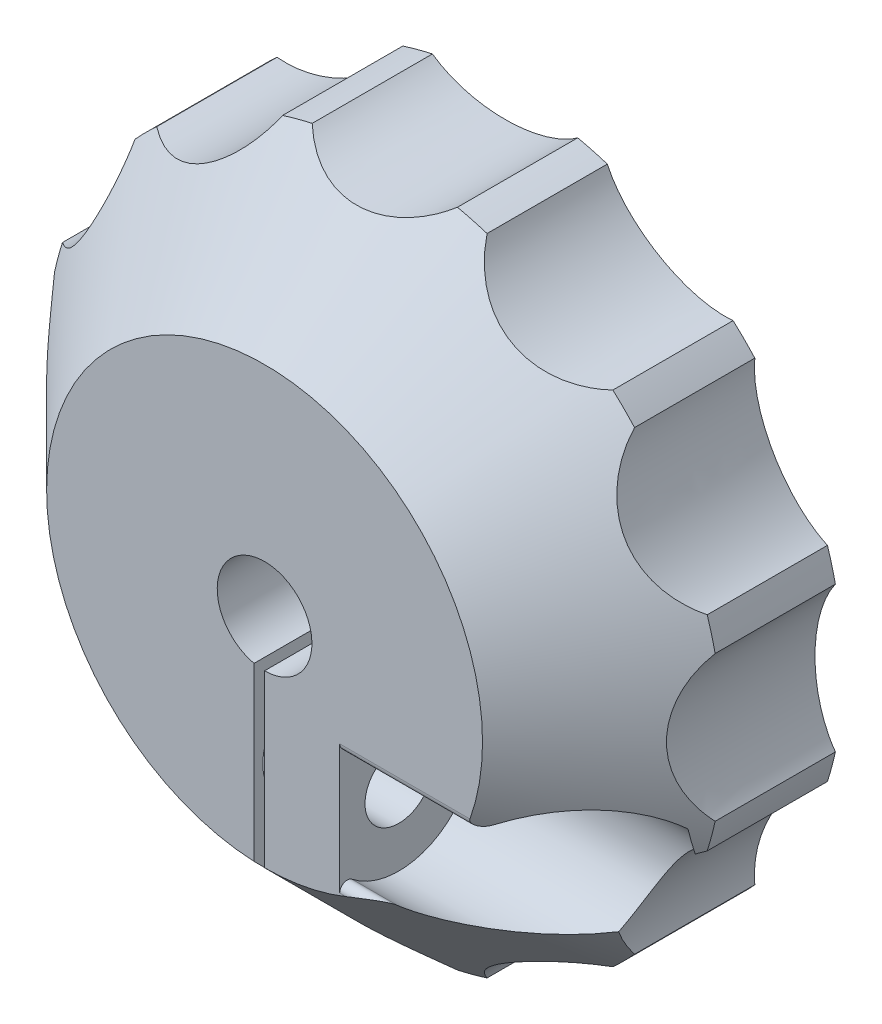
ISO-10303-21;
HEADER;
FILE_DESCRIPTION(('STEP AP214'),'2;1');
FILE_NAME('part.step','',(''),(''),'','','');
FILE_SCHEMA(('AUTOMOTIVE_DESIGN { 1 0 10303 214 1 1 1 1 }'));
ENDSEC;
DATA;
#1=APPLICATION_CONTEXT('core data for automotive mechanical design processes');
#2=APPLICATION_PROTOCOL_DEFINITION('international standard','automotive_design',2000,#1);
#3=PRODUCT_CONTEXT('',#1,'mechanical');
#4=PRODUCT('Part','Part','',(#3));
#5=PRODUCT_RELATED_PRODUCT_CATEGORY('part','',(#4));
#6=PRODUCT_DEFINITION_FORMATION('','',#4);
#7=PRODUCT_DEFINITION_CONTEXT('part definition',#1,'design');
#8=PRODUCT_DEFINITION('design','',#6,#7);
#9=PRODUCT_DEFINITION_SHAPE('','',#8);
#10=(LENGTH_UNIT() NAMED_UNIT(*) SI_UNIT(.MILLI.,.METRE.));
#11=(NAMED_UNIT(*) PLANE_ANGLE_UNIT() SI_UNIT($,.RADIAN.));
#12=(NAMED_UNIT(*) SI_UNIT($,.STERADIAN.) SOLID_ANGLE_UNIT());
#13=UNCERTAINTY_MEASURE_WITH_UNIT(LENGTH_MEASURE(1.E-05),#10,'distance_accuracy_value','');
#14=(GEOMETRIC_REPRESENTATION_CONTEXT(3) GLOBAL_UNCERTAINTY_ASSIGNED_CONTEXT((#13)) GLOBAL_UNIT_ASSIGNED_CONTEXT((#10,
#11,#12)) REPRESENTATION_CONTEXT('',''));
#15=CARTESIAN_POINT('',(0.,0.,0.));
#16=DIRECTION('',(0.,0.,1.));
#17=DIRECTION('',(1.,0.,0.));
#18=AXIS2_PLACEMENT_3D('',#15,#16,#17);
#19=CARTESIAN_POINT('',(0.,0.,16.));
#20=DIRECTION('',(0.,0.,1.));
#21=DIRECTION('',(1.,0.,0.));
#22=AXIS2_PLACEMENT_3D('',#19,#20,#21);
#23=PLANE('',#22);
#24=CARTESIAN_POINT('',(0.,0.,16.));
#25=DIRECTION('',(0.,0.,1.));
#26=DIRECTION('',(1.,0.,0.));
#27=AXIS2_PLACEMENT_3D('',#24,#25,#26);
#28=CIRCLE('',#27,14.5);
#29=CARTESIAN_POINT('',(0.,-14.5,16.));
#30=VERTEX_POINT('',#29);
#31=CARTESIAN_POINT('',(5.409327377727,-13.4532218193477,16.));
#32=VERTEX_POINT('',#31);
#33=EDGE_CURVE('E618',#30,#32,#28,.T.);
#34=ORIENTED_EDGE('',*,*,#33,.T.);
#35=DIRECTION('',(-1.,0.,0.));
#36=VECTOR('',#35,1.);
#37=CARTESIAN_POINT('',(0.,-13.4532218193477,16.));
#38=LINE('',#37,#36);
#39=CARTESIAN_POINT('',(5.,-13.4532218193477,16.));
#40=VERTEX_POINT('',#39);
#41=EDGE_CURVE('E515',#32,#40,#38,.T.);
#42=ORIENTED_EDGE('',*,*,#41,.T.);
#43=DIRECTION('',(0.,1.,0.));
#44=VECTOR('',#43,1.);
#45=CARTESIAN_POINT('',(5.,0.,16.));
#46=LINE('',#45,#44);
#47=CARTESIAN_POINT('',(5.,-4.85630323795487,16.));
#48=VERTEX_POINT('',#47);
#49=EDGE_CURVE('E456',#40,#48,#46,.T.);
#50=ORIENTED_EDGE('',*,*,#49,.T.);
#51=DIRECTION('',(-1.,0.,0.));
#52=VECTOR('',#51,1.);
#53=CARTESIAN_POINT('',(0.,-4.85630323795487,16.));
#54=LINE('',#53,#52);
#55=CARTESIAN_POINT('',(13.6625882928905,-4.85630323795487,16.));
#56=VERTEX_POINT('',#55);
#57=EDGE_CURVE('E277',#48,#56,#54,.F.);
#58=ORIENTED_EDGE('',*,*,#57,.T.);
#59=CARTESIAN_POINT('',(-0.701514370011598,-14.4830203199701,16.));
#60=VERTEX_POINT('',#59);
#61=EDGE_CURVE('E621',#56,#60,#28,.T.);
#62=ORIENTED_EDGE('',*,*,#61,.T.);
#63=DIRECTION('',(0.,-1.,0.));
#64=VECTOR('',#63,1.);
#65=CARTESIAN_POINT('',(-0.701514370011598,-2.25936859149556,16.));
#66=LINE('',#65,#64);
#67=CARTESIAN_POINT('',(-0.701514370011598,-3.07089198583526,16.));
#68=VERTEX_POINT('',#67);
#69=EDGE_CURVE('E686',#68,#60,#66,.T.);
#70=ORIENTED_EDGE('',*,*,#69,.F.);
#71=CARTESIAN_POINT('',(0.,0.,16.));
#72=DIRECTION('',(0.,0.,1.));
#73=DIRECTION('',(1.,0.,0.));
#74=AXIS2_PLACEMENT_3D('',#71,#72,#73);
#75=CIRCLE('',#74,3.15);
#76=CARTESIAN_POINT('',(0.,-3.15,16.));
#77=VERTEX_POINT('',#76);
#78=EDGE_CURVE('E634',#77,#68,#75,.T.);
#79=ORIENTED_EDGE('',*,*,#78,.F.);
#80=DIRECTION('',(0.,1.,0.));
#81=VECTOR('',#80,1.);
#82=CARTESIAN_POINT('',(0.,-2.25936859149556,16.));
#83=LINE('',#82,#81);
#84=EDGE_CURVE('E689',#30,#77,#83,.T.);
#85=ORIENTED_EDGE('',*,*,#84,.F.);
#86=EDGE_LOOP('',(#34,#42,#50,#58,#62,#70,#79,#85));
#87=FACE_BOUND('',#86,.T.);
#88=ADVANCED_FACE('F35',(#87),#23,.T.);
#89=CARTESIAN_POINT('',(0.,0.,16.));
#90=DIRECTION('',(0.,0.,-1.));
#91=DIRECTION('',(-1.,0.,0.));
#92=AXIS2_PLACEMENT_3D('',#89,#90,#91);
#93=CONICAL_SURFACE('',#92,14.5,0.785398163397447);
#94=CARTESIAN_POINT('',(20.9039910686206,-10.2918646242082,7.1998));
#95=CARTESIAN_POINT('',(20.8402900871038,-10.3764906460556,7.2195701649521));
#96=CARTESIAN_POINT('',(20.7746847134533,-10.4591891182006,7.2412028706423));
#97=CARTESIAN_POINT('',(20.6401542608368,-10.6207839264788,7.28779379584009));
#98=CARTESIAN_POINT('',(20.571231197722,-10.6996825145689,7.31275001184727));
#99=CARTESIAN_POINT('',(20.360569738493,-10.9303918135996,7.3918680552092));
#100=CARTESIAN_POINT('',(20.2145078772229,-11.076779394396,7.45041644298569));
#101=CARTESIAN_POINT('',(19.9156603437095,-11.3541302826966,7.57593779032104));
#102=CARTESIAN_POINT('',(19.7629826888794,-11.4852648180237,7.64279520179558));
#103=CARTESIAN_POINT('',(19.4509716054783,-11.7354007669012,7.78381868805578));
#104=CARTESIAN_POINT('',(19.2916313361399,-11.8543892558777,7.857992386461));
#105=CARTESIAN_POINT('',(18.8753209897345,-12.1458742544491,8.05633310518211));
#106=CARTESIAN_POINT('',(18.6146075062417,-12.3100781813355,8.18484134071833));
#107=CARTESIAN_POINT('',(18.0846121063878,-12.6137612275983,8.45266897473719));
#108=CARTESIAN_POINT('',(17.8153280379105,-12.7532340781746,8.59199110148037));
#109=CARTESIAN_POINT('',(17.268475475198,-13.0110112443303,8.88020627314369));
#110=CARTESIAN_POINT('',(16.9908564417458,-13.1291282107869,9.02916978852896));
#111=CARTESIAN_POINT('',(16.4314200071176,-13.3446469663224,9.33388220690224));
#112=CARTESIAN_POINT('',(16.149602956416,-13.4420504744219,9.48963054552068));
#113=CARTESIAN_POINT('',(15.6559491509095,-13.5949718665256,9.76603364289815));
#114=CARTESIAN_POINT('',(15.4447298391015,-13.654822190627,9.88542724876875));
#115=CARTESIAN_POINT('',(15.0212132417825,-13.7642318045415,10.1270355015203));
#116=CARTESIAN_POINT('',(14.8089158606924,-13.8137901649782,10.2492504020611));
#117=CARTESIAN_POINT('',(14.3835568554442,-13.9028965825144,10.4963686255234));
#118=CARTESIAN_POINT('',(14.1704947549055,-13.9424365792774,10.6212740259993));
#119=CARTESIAN_POINT('',(13.7442329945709,-14.0115663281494,10.873557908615));
#120=CARTESIAN_POINT('',(13.5310333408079,-14.0411564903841,11.0009362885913));
#121=CARTESIAN_POINT('',(13.1048756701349,-14.0903606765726,11.2582079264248));
#122=CARTESIAN_POINT('',(12.8919177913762,-14.1099705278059,11.3881022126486));
#123=CARTESIAN_POINT('',(12.4668831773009,-14.1389788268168,11.6504446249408));
#124=CARTESIAN_POINT('',(12.2548064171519,-14.1483775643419,11.7828926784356));
#125=CARTESIAN_POINT('',(11.8324426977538,-14.1565178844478,12.0504195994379));
#126=CARTESIAN_POINT('',(11.6221539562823,-14.1552717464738,12.1854952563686));
#127=CARTESIAN_POINT('',(11.2040536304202,-14.1414067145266,12.4587931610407));
#128=CARTESIAN_POINT('',(10.9962415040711,-14.128790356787,12.5970147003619));
#129=CARTESIAN_POINT('',(10.5920703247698,-14.091702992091,12.8719929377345));
#130=CARTESIAN_POINT('',(10.3955746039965,-14.067696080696,13.0086089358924));
#131=CARTESIAN_POINT('',(10.0075878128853,-14.0063415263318,13.286339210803));
#132=CARTESIAN_POINT('',(9.81610155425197,-13.9689815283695,13.42745754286));
#133=CARTESIAN_POINT('',(9.4423966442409,-13.8786033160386,13.7143420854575));
#134=CARTESIAN_POINT('',(9.26012231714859,-13.8256969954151,13.860068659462));
#135=CARTESIAN_POINT('',(8.99671558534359,-13.731446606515,14.0838389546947));
#136=CARTESIAN_POINT('',(8.91064755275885,-13.6975819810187,14.159228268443));
#137=CARTESIAN_POINT('',(8.74284864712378,-13.6241283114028,14.3119878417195));
#138=CARTESIAN_POINT('',(8.66111560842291,-13.5845421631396,14.3893570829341));
#139=CARTESIAN_POINT('',(8.52690947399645,-13.5115223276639,14.522876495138));
#140=CARTESIAN_POINT('',(8.47297865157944,-13.479773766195,14.5784747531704));
#141=CARTESIAN_POINT('',(8.36863133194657,-13.412645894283,14.6907505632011));
#142=CARTESIAN_POINT('',(8.31821526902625,-13.3772661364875,14.7474282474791));
#143=CARTESIAN_POINT('',(8.1736278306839,-13.2651930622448,14.9188672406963));
#144=CARTESIAN_POINT('',(8.08578846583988,-13.1823966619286,15.0353525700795));
#145=CARTESIAN_POINT('',(7.95821170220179,-13.0249597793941,15.2362329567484));
#146=CARTESIAN_POINT('',(7.91191711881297,-12.9549853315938,15.3200770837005));
#147=CARTESIAN_POINT('',(7.83632389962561,-12.805551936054,15.4870036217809));
#148=CARTESIAN_POINT('',(7.8070021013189,-12.7261060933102,15.5700869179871));
#149=CARTESIAN_POINT('',(7.76800533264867,-12.5585397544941,15.7332100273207));
#150=CARTESIAN_POINT('',(7.75845242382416,-12.47036886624,15.8132279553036));
#151=CARTESIAN_POINT('',(7.75959947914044,-12.2886100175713,15.9666253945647));
#152=CARTESIAN_POINT('',(7.77030626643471,-12.1950202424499,16.0400026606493));
#153=CARTESIAN_POINT('',(7.81317397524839,-11.9874120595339,16.1913556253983));
#154=CARTESIAN_POINT('',(7.84902523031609,-11.8728912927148,16.2675553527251));
#155=CARTESIAN_POINT('',(7.93972243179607,-11.6433263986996,16.4075960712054));
#156=CARTESIAN_POINT('',(7.99466419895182,-11.5282825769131,16.471372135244));
#157=CARTESIAN_POINT('',(8.11502836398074,-11.3047095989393,16.5846178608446));
#158=CARTESIAN_POINT('',(8.17987707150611,-11.1961179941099,16.6345970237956));
#159=CARTESIAN_POINT('',(8.3174174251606,-10.9818933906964,16.724402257));
#160=CARTESIAN_POINT('',(8.38999552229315,-10.876240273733,16.7643524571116));
#161=CARTESIAN_POINT('',(8.46523860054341,-10.7714555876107,16.8002));
#162=B_SPLINE_CURVE_WITH_KNOTS('',3,(#94,#95,#96,#97,#98,#99,#100,#101,#102,#103,#104,#105,#106,
#107,#108,#109,#110,#111,#112,#113,#114,#115,#116,#117,#118,#119,#120,#121,#122,#123,#124,#125,
#126,#127,#128,#129,#130,#131,#132,#133,#134,#135,#136,#137,#138,#139,#140,#141,#142,#143,#144,
#145,#146,#147,#148,#149,#150,#151,#152,#153,#154,#155,#156,#157,#158,#159,#160,#161),
.UNSPECIFIED.,.F.,.F.,(4,2,2,2,2,2,2,2,2,2,2,2,2,2,2,2,2,2,2,2,2,2,2,2,2,2,2,2,2,2,2,2,2,4),(0.,
0.32312786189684,0.646061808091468,1.2897731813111,1.92536707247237,2.56163039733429,
3.56159007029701,4.56180285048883,5.5704043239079,6.57892206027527,7.32840377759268,
8.07795314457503,8.82810366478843,9.57822326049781,10.3286562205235,11.0790678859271,
11.8286140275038,12.577993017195,13.2991646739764,14.0210053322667,14.7377727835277,
15.0955678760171,15.4531825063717,15.7041633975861,15.9551752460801,16.4557457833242,
16.8102991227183,17.164367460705,17.5206155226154,17.8769835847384,18.3010731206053,
18.7273227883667,19.1346458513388,19.5366467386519),.UNSPECIFIED.);
#163=CARTESIAN_POINT('',(16.7311488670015,-13.2291594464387,9.17063052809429));
#164=VERTEX_POINT('',#163);
#165=CARTESIAN_POINT('',(7.98921086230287,-13.0624527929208,15.1880712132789));
#166=VERTEX_POINT('',#165);
#167=EDGE_CURVE('E441',#164,#166,#162,.T.);
#168=ORIENTED_EDGE('',*,*,#167,.T.);
#169=CARTESIAN_POINT('',(7.98921086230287,-13.0624527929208,15.1880712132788));
#170=CARTESIAN_POINT('',(7.97998107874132,-13.0505478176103,15.2030425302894));
#171=CARTESIAN_POINT('',(7.96881097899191,-13.0402073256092,15.217692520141));
#172=CARTESIAN_POINT('',(7.94394383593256,-13.0222019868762,15.2460184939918));
#173=CARTESIAN_POINT('',(7.93029124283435,-13.0144960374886,15.2597065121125));
#174=CARTESIAN_POINT('',(7.89096265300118,-12.9960417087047,15.2959161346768));
#175=CARTESIAN_POINT('',(7.86375221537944,-12.9871446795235,15.3176382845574));
#176=CARTESIAN_POINT('',(7.80674309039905,-12.9729319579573,15.3592681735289));
#177=CARTESIAN_POINT('',(7.77691821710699,-12.9676586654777,15.3791521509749));
#178=CARTESIAN_POINT('',(7.70187129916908,-12.9579054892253,15.4260191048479));
#179=CARTESIAN_POINT('',(7.65587980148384,-12.9549074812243,15.4520580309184));
#180=CARTESIAN_POINT('',(7.56233507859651,-12.9526193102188,15.5014112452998));
#181=CARTESIAN_POINT('',(7.51477890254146,-12.9533366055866,15.5247199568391));
#182=CARTESIAN_POINT('',(7.41868939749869,-12.9575160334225,15.5690806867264));
#183=CARTESIAN_POINT('',(7.37015498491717,-12.9609813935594,15.5901300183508));
#184=CARTESIAN_POINT('',(7.27253002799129,-12.9700457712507,15.6302394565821));
#185=CARTESIAN_POINT('',(7.22343998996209,-12.9756429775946,15.6493012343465));
#186=CARTESIAN_POINT('',(7.12076767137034,-12.9891078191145,15.6871763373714));
#187=CARTESIAN_POINT('',(7.06714965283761,-12.9971249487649,15.7058387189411));
#188=CARTESIAN_POINT('',(6.95957282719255,-13.0148517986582,15.7412954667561));
#189=CARTESIAN_POINT('',(6.90561395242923,-13.0245618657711,15.7580894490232));
#190=CARTESIAN_POINT('',(6.74327727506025,-13.0558760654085,15.8059002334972));
#191=CARTESIAN_POINT('',(6.6345400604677,-13.0796500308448,15.834309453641));
#192=CARTESIAN_POINT('',(6.4169075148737,-13.1317599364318,15.8846677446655));
#193=CARTESIAN_POINT('',(6.30801276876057,-13.1600880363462,15.9066277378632));
#194=CARTESIAN_POINT('',(6.09036071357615,-13.2208824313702,15.9441824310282));
#195=CARTESIAN_POINT('',(5.98160336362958,-13.2533454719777,15.9597820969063));
#196=CARTESIAN_POINT('',(5.79517815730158,-13.3129371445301,15.9806420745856));
#197=CARTESIAN_POINT('',(5.71735932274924,-13.3390024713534,15.9875758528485));
#198=CARTESIAN_POINT('',(5.60123784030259,-13.3801319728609,15.9948243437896));
#199=CARTESIAN_POINT('',(5.56266876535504,-13.3941658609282,15.9967148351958));
#200=CARTESIAN_POINT('',(5.48578295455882,-13.4230501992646,15.9992964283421));
#201=CARTESIAN_POINT('',(5.44746631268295,-13.437900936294,15.999987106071));
#202=CARTESIAN_POINT('',(5.409327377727,-13.4532218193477,16.));
#203=B_SPLINE_CURVE_WITH_KNOTS('',3,(#169,#170,#171,#172,#173,#174,#175,#176,#177,#178,#179,
#180,#181,#182,#183,#184,#185,#186,#187,#188,#189,#190,#191,#192,#193,#194,#195,#196,#197,#198,
#199,#200,#201,#202),.UNSPECIFIED.,.F.,.F.,(4,2,2,2,2,2,2,2,2,2,2,2,2,2,2,2,4),(0.,
0.0631920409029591,0.125347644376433,0.232617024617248,0.341121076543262,0.499557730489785,
0.658312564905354,0.817254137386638,0.97606097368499,1.14800242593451,1.31997914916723,
1.6642555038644,2.00794538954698,2.35136641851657,2.59831381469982,2.7215497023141,
2.84482913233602),.UNSPECIFIED.);
#204=EDGE_CURVE('E521',#166,#32,#203,.T.);
#205=ORIENTED_EDGE('',*,*,#204,.T.);
#206=ORIENTED_EDGE('',*,*,#33,.F.);
#207=DIRECTION('',(0.,-0.707106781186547,-0.707106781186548));
#208=VECTOR('',#207,1.);
#209=CARTESIAN_POINT('',(0.,0.,30.5000000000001));
#210=LINE('',#209,#208);
#211=CARTESIAN_POINT('',(0.,-20.6175558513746,9.88244414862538));
#212=VERTEX_POINT('',#211);
#213=EDGE_CURVE('E700',#212,#30,#210,.F.);
#214=ORIENTED_EDGE('',*,*,#213,.F.);
#215=CARTESIAN_POINT('',(4.83242741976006,-21.9749322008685,7.99999999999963));
#216=CARTESIAN_POINT('',(4.70998099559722,-21.8867190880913,8.11244701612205));
#217=CARTESIAN_POINT('',(4.58169056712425,-21.8024657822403,8.22161871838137));
#218=CARTESIAN_POINT('',(4.31431580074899,-21.6420005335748,8.43246170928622));
#219=CARTESIAN_POINT('',(4.17522937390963,-21.5657901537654,8.53413153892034));
#220=CARTESIAN_POINT('',(3.88720843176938,-21.4215685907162,8.72897425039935));
#221=CARTESIAN_POINT('',(3.73827415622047,-21.3535572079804,8.82214733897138));
#222=CARTESIAN_POINT('',(3.43141094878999,-21.2259430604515,8.99894313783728));
#223=CARTESIAN_POINT('',(3.27348273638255,-21.1663396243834,9.08256661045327));
#224=CARTESIAN_POINT('',(2.95744302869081,-21.0585076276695,9.23532817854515));
#225=CARTESIAN_POINT('',(2.79971874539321,-21.0098651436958,9.30497489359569));
#226=CARTESIAN_POINT('',(2.47778419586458,-20.9206937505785,9.43365022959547));
#227=CARTESIAN_POINT('',(2.31357461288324,-20.8801639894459,9.49267996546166));
#228=CARTESIAN_POINT('',(1.9786901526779,-20.807301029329,9.59946545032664));
#229=CARTESIAN_POINT('',(1.80798435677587,-20.7750147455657,9.64715656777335));
#230=CARTESIAN_POINT('',(1.4621530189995,-20.7192276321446,9.72994169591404));
#231=CARTESIAN_POINT('',(1.28702787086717,-20.695726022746,9.76503682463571));
#232=CARTESIAN_POINT('',(0.92757981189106,-20.657102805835,9.82287670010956));
#233=CARTESIAN_POINT('',(0.743147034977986,-20.6422947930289,9.84515873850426));
#234=CARTESIAN_POINT('',(0.465208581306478,-20.6274634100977,9.86749952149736));
#235=CARTESIAN_POINT('',(0.37230241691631,-20.6237497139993,9.87309942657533));
#236=CARTESIAN_POINT('',(0.186269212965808,-20.618795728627,9.88057277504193));
#237=CARTESIAN_POINT('',(0.0931421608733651,-20.6175555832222,9.88244600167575));
#238=CARTESIAN_POINT('',(0.,-20.6175558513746,9.88244414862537));
#239=B_SPLINE_CURVE_WITH_KNOTS('',3,(#215,#216,#217,#218,#219,#220,#221,#222,#223,#224,#225,
#226,#227,#228,#229,#230,#231,#232,#233,#234,#235,#236,#237,#238),.UNSPECIFIED.,.F.,.F.,(4,2,2,
2,2,2,2,2,2,2,2,4),(0.,0.56442316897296,1.12895582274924,1.69347473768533,2.25794855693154,
2.7947975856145,3.33159020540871,3.87137294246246,4.41110775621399,4.96927502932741,
5.24862832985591,5.52799787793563),.UNSPECIFIED.);
#240=CARTESIAN_POINT('',(4.83242741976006,-21.9749322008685,7.99999999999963));
#241=VERTEX_POINT('',#240);
#242=EDGE_CURVE('E371',#241,#212,#239,.T.);
#243=ORIENTED_EDGE('',*,*,#242,.F.);
#244=CARTESIAN_POINT('',(0.,0.,7.99999999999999));
#245=DIRECTION('',(0.,0.,1.));
#246=DIRECTION('',(1.,0.,0.));
#247=AXIS2_PLACEMENT_3D('',#244,#245,#246);
#248=CIRCLE('',#247,22.5);
#249=CARTESIAN_POINT('',(6.80246119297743,-21.4470632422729,7.99999999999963));
#250=VERTEX_POINT('',#249);
#251=EDGE_CURVE('E590',#250,#241,#248,.F.);
#252=ORIENTED_EDGE('',*,*,#251,.F.);
#253=CARTESIAN_POINT('',(15.1724710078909,-16.6146358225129,7.99999999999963));
#254=CARTESIAN_POINT('',(15.0223229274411,-16.5994642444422,8.11244688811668));
#255=CARTESIAN_POINT('',(14.8690936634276,-16.5906439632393,8.22161847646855));
#256=CARTESIAN_POINT('',(14.5573076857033,-16.5853643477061,8.43246148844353));
#257=CARTESIAN_POINT('',(14.398749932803,-16.588907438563,8.53413143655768));
#258=CARTESIAN_POINT('',(14.0772055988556,-16.6080183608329,8.72897422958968));
#259=CARTESIAN_POINT('',(13.9142191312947,-16.6235858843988,8.82214729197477));
#260=CARTESIAN_POINT('',(13.5846605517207,-16.666500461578,8.99894312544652));
#261=CARTESIAN_POINT('',(13.4180887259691,-16.6938465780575,9.0825666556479));
#262=CARTESIAN_POINT('',(13.0904729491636,-16.7584813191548,9.23532903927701));
#263=CARTESIAN_POINT('',(12.9295572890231,-16.7952180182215,9.3049764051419));
#264=CARTESIAN_POINT('',(12.6061658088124,-16.8789617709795,9.43365188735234));
#265=CARTESIAN_POINT('',(12.4436901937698,-16.9259674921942,9.49268137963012));
#266=CARTESIAN_POINT('',(12.127386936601,-17.0270647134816,9.59614895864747));
#267=CARTESIAN_POINT('',(11.9735912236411,-17.0806034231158,9.64122454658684));
#268=CARTESIAN_POINT('',(11.6664487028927,-17.1963347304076,9.72033195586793));
#269=CARTESIAN_POINT('',(11.513101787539,-17.2585250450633,9.75436668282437));
#270=CARTESIAN_POINT('',(11.2137428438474,-17.3886526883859,9.80970263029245));
#271=CARTESIAN_POINT('',(11.067675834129,-17.4562763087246,9.83144389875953));
#272=CARTESIAN_POINT('',(10.7777463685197,-17.5988486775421,9.86378326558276));
#273=CARTESIAN_POINT('',(10.6338857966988,-17.6738033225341,9.87437231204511));
#274=CARTESIAN_POINT('',(10.3486219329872,-17.8309747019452,9.88420564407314));
#275=CARTESIAN_POINT('',(10.2072394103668,-17.9132335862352,9.88337917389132));
#276=CARTESIAN_POINT('',(9.92880765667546,-18.0840574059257,9.87022279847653));
#277=CARTESIAN_POINT('',(9.79176030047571,-18.1726250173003,9.85788798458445));
#278=CARTESIAN_POINT('',(9.52299483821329,-18.3554027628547,9.82194043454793));
#279=CARTESIAN_POINT('',(9.39127733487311,-18.4496135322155,9.79832642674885));
#280=CARTESIAN_POINT('',(9.13408755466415,-18.6429684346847,9.74026041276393));
#281=CARTESIAN_POINT('',(9.00861299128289,-18.7421107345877,9.7058124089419));
#282=CARTESIAN_POINT('',(8.7647097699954,-18.9446151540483,9.6266905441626));
#283=CARTESIAN_POINT('',(8.64627408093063,-19.0479728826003,9.58202711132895));
#284=CARTESIAN_POINT('',(8.41699500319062,-19.2583287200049,9.48316760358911));
#285=CARTESIAN_POINT('',(8.30614876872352,-19.3653254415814,9.42897512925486));
#286=CARTESIAN_POINT('',(7.9835297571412,-19.6932242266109,9.25195666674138));
#287=CARTESIAN_POINT('',(7.78404130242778,-19.9190695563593,9.11547453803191));
#288=CARTESIAN_POINT('',(7.42140720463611,-20.3798414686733,8.81240114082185));
#289=CARTESIAN_POINT('',(7.25829426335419,-20.6147760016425,8.64578302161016));
#290=CARTESIAN_POINT('',(7.05600626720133,-20.9508103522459,8.39307858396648));
#291=CARTESIAN_POINT('',(7.00019766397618,-21.0497002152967,8.31698542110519));
#292=CARTESIAN_POINT('',(6.89586334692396,-21.2479837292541,8.16117074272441));
#293=CARTESIAN_POINT('',(6.84731954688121,-21.3473754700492,8.08145890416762));
#294=CARTESIAN_POINT('',(6.80246119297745,-21.4470632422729,7.99999999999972));
#295=B_SPLINE_CURVE_WITH_KNOTS('',3,(#253,#254,#255,#256,#257,#258,#259,#260,#261,#262,#263,
#264,#265,#266,#267,#268,#269,#270,#271,#272,#273,#274,#275,#276,#277,#278,#279,#280,#281,#282,
#283,#284,#285,#286,#287,#288,#289,#290,#291,#292,#293,#294),.UNSPECIFIED.,.F.,.F.,(4,2,2,2,2,2,
2,2,2,2,2,2,2,2,2,2,2,2,2,2,4),(0.,0.564422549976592,1.12895582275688,1.69347464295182,
2.25794855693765,2.79480419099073,3.33159020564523,3.83794440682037,4.34416524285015,
4.83088376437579,5.31799703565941,5.80813088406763,6.29847388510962,6.78887218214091,
7.27908952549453,7.76880866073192,8.2583431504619,9.24683101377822,10.2362039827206,
10.6460735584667,11.0549051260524),.UNSPECIFIED.);
#296=CARTESIAN_POINT('',(15.1724710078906,-16.6146358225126,7.99999999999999));
#297=VERTEX_POINT('',#296);
#298=EDGE_CURVE('E739',#297,#250,#295,.T.);
#299=ORIENTED_EDGE('',*,*,#298,.F.);
#300=CARTESIAN_POINT('',(16.6146358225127,-15.172471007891,7.99999999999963));
#301=VERTEX_POINT('',#300);
#302=EDGE_CURVE('E609',#301,#297,#248,.F.);
#303=ORIENTED_EDGE('',*,*,#302,.F.);
#304=CARTESIAN_POINT('',(21.4470632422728,-6.80246119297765,7.99999999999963));
#305=CARTESIAN_POINT('',(21.3094454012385,-6.86439626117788,8.11244688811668));
#306=CARTESIAN_POINT('',(21.1723348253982,-6.93337230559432,8.22161847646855));
#307=CARTESIAN_POINT('',(20.8996804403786,-7.08469301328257,8.43246148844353));
#308=CARTESIAN_POINT('',(20.7641369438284,-7.16704029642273,8.53413143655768));
#309=CARTESIAN_POINT('',(20.4952268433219,-7.34436300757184,8.72897422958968));
#310=CARTESIAN_POINT('',(20.361860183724,-7.4393381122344,8.82214729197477));
#311=CARTESIAN_POINT('',(20.0979113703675,-7.64128251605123,8.99894312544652));
#312=CARTESIAN_POINT('',(19.9673289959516,-7.74825086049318,9.0825666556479));
#313=CARTESIAN_POINT('',(19.7159227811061,-7.96803407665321,9.23532903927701));
#314=CARTESIAN_POINT('',(19.594934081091,-8.0803068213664,9.3049764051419));
#315=CARTESIAN_POINT('',(19.3567407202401,-8.3145267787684,9.43365188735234));
#316=CARTESIAN_POINT('',(19.2395355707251,-8.43647273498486,9.49268137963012));
#317=CARTESIAN_POINT('',(19.0161575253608,-8.68217712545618,9.59614895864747));
#318=CARTESIAN_POINT('',(18.9097358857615,-8.80544086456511,9.64122454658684));
#319=CARTESIAN_POINT('',(18.7016083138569,-9.05923837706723,9.72033195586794));
#320=CARTESIAN_POINT('',(18.5999011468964,-9.18977022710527,9.75436668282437));
#321=CARTESIAN_POINT('',(18.4057125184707,-9.45214354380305,9.80970263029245));
#322=CARTESIAN_POINT('',(18.3130265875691,-9.58374082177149,9.83144389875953));
#323=CARTESIAN_POINT('',(18.1332264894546,-9.85217684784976,9.86378326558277));
#324=CARTESIAN_POINT('',(18.0461169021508,-9.98901976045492,9.87437231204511));
#325=CARTESIAN_POINT('',(17.8776568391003,-10.2677660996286,9.88420564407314));
#326=CARTESIAN_POINT('',(17.796345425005,-10.4096956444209,9.88337917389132));
#327=CARTESIAN_POINT('',(17.6406283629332,-10.69684928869,9.87022279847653));
#328=CARTESIAN_POINT('',(17.5662256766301,-10.8420747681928,9.85788798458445));
#329=CARTESIAN_POINT('',(17.4248568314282,-11.1347476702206,9.82194043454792));
#330=CARTESIAN_POINT('',(17.3578915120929,-11.2821953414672,9.79832642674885));
#331=CARTESIAN_POINT('',(17.2318360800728,-11.5782404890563,9.74026041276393));
#332=CARTESIAN_POINT('',(17.1727430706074,-11.7268375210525,9.7058124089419));
#333=CARTESIAN_POINT('',(17.0627688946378,-12.0241631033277,9.6266905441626));
#334=CARTESIAN_POINT('',(17.0118794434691,-12.1728913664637,9.58202711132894));
#335=CARTESIAN_POINT('',(16.9184958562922,-12.4697044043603,9.4831676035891));
#336=CARTESIAN_POINT('',(16.8759985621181,-12.6177894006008,9.42897512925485));
#337=CARTESIAN_POINT('',(16.7605516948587,-13.0630675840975,9.25195666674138));
#338=CARTESIAN_POINT('',(16.7007122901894,-13.3583996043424,9.1154745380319));
#339=CARTESIAN_POINT('',(16.6170479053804,-13.9387568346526,8.81240114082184));
#340=CARTESIAN_POINT('',(16.5932552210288,-14.2237725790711,8.64578302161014));
#341=CARTESIAN_POINT('',(16.5860858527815,-14.6159308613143,8.39307858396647));
#342=CARTESIAN_POINT('',(16.5871991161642,-14.7294762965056,8.31698542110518));
#343=CARTESIAN_POINT('',(16.5959847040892,-14.9533620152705,8.16117074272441));
#344=CARTESIAN_POINT('',(16.6036404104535,-15.0637096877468,8.08145890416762));
#345=CARTESIAN_POINT('',(16.6146358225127,-15.172471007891,7.99999999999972));
#346=B_SPLINE_CURVE_WITH_KNOTS('',3,(#304,#305,#306,#307,#308,#309,#310,#311,#312,#313,#314,
#315,#316,#317,#318,#319,#320,#321,#322,#323,#324,#325,#326,#327,#328,#329,#330,#331,#332,#333,
#334,#335,#336,#337,#338,#339,#340,#341,#342,#343,#344,#345),.UNSPECIFIED.,.F.,.F.,(4,2,2,2,2,2,
2,2,2,2,2,2,2,2,2,2,2,2,2,2,4),(0.,0.564422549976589,1.12895582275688,1.69347464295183,
2.25794855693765,2.79480419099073,3.33159020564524,3.83794440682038,4.34416524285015,
4.83088376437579,5.31799703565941,5.80813088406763,6.29847388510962,6.78887218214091,
7.27908952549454,7.76880866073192,8.2583431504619,9.24683101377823,10.2362039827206,
10.6460735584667,11.0549051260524),.UNSPECIFIED.);
#347=EDGE_CURVE('E677',#164,#301,#346,.T.);
#348=ORIENTED_EDGE('',*,*,#347,.F.);
#349=EDGE_LOOP('',(#168,#205,#206,#214,#243,#252,#299,#303,#348));
#350=FACE_BOUND('',#349,.T.);
#351=ADVANCED_FACE('F314',(#350),#93,.T.);
#352=ORIENTED_EDGE('',*,*,#61,.F.);
#353=CARTESIAN_POINT('',(13.6625882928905,-4.85630323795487,16.));
#354=CARTESIAN_POINT('',(13.6559185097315,-4.87500107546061,16.0000240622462));
#355=CARTESIAN_POINT('',(13.6502263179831,-4.8940907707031,15.9989516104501));
#356=CARTESIAN_POINT('',(13.6410799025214,-4.93255951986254,15.9945241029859));
#357=CARTESIAN_POINT('',(13.6376285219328,-4.95193890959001,15.9911661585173));
#358=CARTESIAN_POINT('',(13.6332558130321,-4.99052264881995,15.9820587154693));
#359=CARTESIAN_POINT('',(13.6323450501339,-5.00972593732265,15.9762993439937));
#360=CARTESIAN_POINT('',(13.6331744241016,-5.04721693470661,15.9625469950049));
#361=CARTESIAN_POINT('',(13.6349102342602,-5.06550608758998,15.9545576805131));
#362=CARTESIAN_POINT('',(13.6407616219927,-5.09985097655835,15.937079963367));
#363=CARTESIAN_POINT('',(13.644763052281,-5.11597096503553,15.9276783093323));
#364=CARTESIAN_POINT('',(13.6548070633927,-5.14663548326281,15.9074863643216));
#365=CARTESIAN_POINT('',(13.660852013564,-5.16117815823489,15.8966944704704));
#366=CARTESIAN_POINT('',(13.6772670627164,-5.19366673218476,15.8698392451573));
#367=CARTESIAN_POINT('',(13.6884090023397,-5.21084309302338,15.8533169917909));
#368=CARTESIAN_POINT('',(13.7131640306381,-5.24192834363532,15.8191083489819));
#369=CARTESIAN_POINT('',(13.7267813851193,-5.25583149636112,15.8014199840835));
#370=CARTESIAN_POINT('',(13.7620549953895,-5.28590131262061,15.7577198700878));
#371=CARTESIAN_POINT('',(13.7846562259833,-5.30048674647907,15.7313881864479));
#372=CARTESIAN_POINT('',(13.8322217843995,-5.32427707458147,15.6784520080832));
#373=CARTESIAN_POINT('',(13.8571909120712,-5.33347075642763,15.6518470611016));
#374=CARTESIAN_POINT('',(13.9203337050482,-5.35030498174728,15.5868704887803));
#375=CARTESIAN_POINT('',(13.9593504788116,-5.35533998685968,15.5486473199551));
#376=CARTESIAN_POINT('',(14.0389840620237,-5.35701738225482,15.4736720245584));
#377=CARTESIAN_POINT('',(14.0796038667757,-5.35364325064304,15.4369229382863));
#378=CARTESIAN_POINT('',(14.1426388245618,-5.34255507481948,15.3818983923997));
#379=CARTESIAN_POINT('',(14.1648929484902,-5.33752793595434,15.3628532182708));
#380=CARTESIAN_POINT('',(14.2094125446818,-5.32527325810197,15.3254899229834));
#381=CARTESIAN_POINT('',(14.2316780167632,-5.31804575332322,15.3071717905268));
#382=CARTESIAN_POINT('',(14.2759403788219,-5.30146114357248,15.2714831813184));
#383=CARTESIAN_POINT('',(14.2979380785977,-5.29211695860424,15.2541077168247));
#384=CARTESIAN_POINT('',(14.341643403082,-5.27124228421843,15.2203261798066));
#385=CARTESIAN_POINT('',(14.3633509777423,-5.25971142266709,15.2039202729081));
#386=CARTESIAN_POINT('',(14.3848321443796,-5.24707226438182,15.1880712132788));
#387=B_SPLINE_CURVE_WITH_KNOTS('',3,(#353,#354,#355,#356,#357,#358,#359,#360,#361,#362,#363,
#364,#365,#366,#367,#368,#369,#370,#371,#372,#373,#374,#375,#376,#377,#378,#379,#380,#381,#382,
#383,#384,#385,#386),.UNSPECIFIED.,.F.,.F.,(4,2,2,2,2,2,2,2,2,2,2,2,2,2,2,2,4),(0.,
0.059560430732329,0.119196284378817,0.179079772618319,0.23886546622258,0.295877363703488,
0.352955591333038,0.43144335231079,0.510067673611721,0.622369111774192,0.734903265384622,
0.898589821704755,1.06259823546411,1.15167952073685,1.24075942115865,1.32930957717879,
1.41787481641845),.UNSPECIFIED.);
#388=CARTESIAN_POINT('',(14.3848321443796,-5.24707226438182,15.1880712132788));
#389=VERTEX_POINT('',#388);
#390=EDGE_CURVE('E51',#56,#389,#387,.T.);
#391=ORIENTED_EDGE('',*,*,#390,.T.);
#392=CARTESIAN_POINT('',(11.4394942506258,-7.53806946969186,16.8002));
#393=CARTESIAN_POINT('',(11.5424110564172,-7.44172534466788,16.7672793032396));
#394=CARTESIAN_POINT('',(11.6455048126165,-7.34658222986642,16.7314831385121));
#395=CARTESIAN_POINT('',(11.8520197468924,-7.15895880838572,16.6543107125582));
#396=CARTESIAN_POINT('',(11.9554409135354,-7.06647840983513,16.6129346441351));
#397=CARTESIAN_POINT('',(12.2660613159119,-6.79350500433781,16.4807338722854));
#398=CARTESIAN_POINT('',(12.4737220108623,-6.61738143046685,16.3818028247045));
#399=CARTESIAN_POINT('',(12.8893289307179,-6.27967630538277,16.1644021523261));
#400=CARTESIAN_POINT('',(13.0972722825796,-6.11805143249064,16.0459939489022));
#401=CARTESIAN_POINT('',(13.5140653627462,-5.81077333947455,15.7913561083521));
#402=CARTESIAN_POINT('',(13.7229151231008,-5.66512068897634,15.6551258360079));
#403=CARTESIAN_POINT('',(14.1428797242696,-5.3906708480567,15.3659974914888));
#404=CARTESIAN_POINT('',(14.3540002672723,-5.26199638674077,15.2129912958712));
#405=CARTESIAN_POINT('',(14.7769425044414,-5.02420833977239,14.8933550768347));
#406=CARTESIAN_POINT('',(14.9887642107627,-4.91509509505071,14.7267248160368));
#407=CARTESIAN_POINT('',(15.4130735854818,-4.71753519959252,14.3819078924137));
#408=CARTESIAN_POINT('',(15.625561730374,-4.62911143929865,14.2037087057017));
#409=CARTESIAN_POINT('',(16.0505461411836,-4.4740558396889,13.8380834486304));
#410=CARTESIAN_POINT('',(16.2630424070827,-4.40742395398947,13.6506573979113));
#411=CARTESIAN_POINT('',(16.6948759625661,-4.29483944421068,13.2618998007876));
#412=CARTESIAN_POINT('',(16.9141924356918,-4.24969204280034,13.0603111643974));
#413=CARTESIAN_POINT('',(17.3513273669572,-4.18451058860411,12.6514241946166));
#414=CARTESIAN_POINT('',(17.5691455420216,-4.16448115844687,12.444124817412));
#415=CARTESIAN_POINT('',(18.0018741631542,-4.15057254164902,12.0259208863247));
#416=CARTESIAN_POINT('',(18.2167865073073,-4.15667536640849,11.8150189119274));
#417=CARTESIAN_POINT('',(18.6421736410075,-4.19629625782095,11.3913959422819));
#418=CARTESIAN_POINT('',(18.8526505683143,-4.2298007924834,11.1786758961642));
#419=CARTESIAN_POINT('',(19.1944434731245,-4.30914170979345,10.8278009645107));
#420=CARTESIAN_POINT('',(19.3276946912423,-4.34656411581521,10.6895930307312));
#421=CARTESIAN_POINT('',(19.5905828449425,-4.43437531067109,10.4138253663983));
#422=CARTESIAN_POINT('',(19.7202199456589,-4.48476350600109,10.2762656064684));
#423=CARTESIAN_POINT('',(19.9746637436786,-4.59918474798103,10.002709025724));
#424=CARTESIAN_POINT('',(20.0994770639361,-4.66319823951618,9.86671025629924));
#425=CARTESIAN_POINT('',(20.343067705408,-4.80577570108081,9.59702974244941));
#426=CARTESIAN_POINT('',(20.4618470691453,-4.88433470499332,9.46334722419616));
#427=CARTESIAN_POINT('',(20.7372531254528,-5.09125878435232,9.14705807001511));
#428=CARTESIAN_POINT('',(20.8902588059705,-5.22703171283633,8.96602286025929));
#429=CARTESIAN_POINT('',(21.1745405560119,-5.53180532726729,8.61508816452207));
#430=CARTESIAN_POINT('',(21.3058485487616,-5.70075638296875,8.44517254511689));
#431=CARTESIAN_POINT('',(21.5086831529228,-6.02763247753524,8.16296109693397));
#432=CARTESIAN_POINT('',(21.5869648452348,-6.17797410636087,8.04679930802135));
#433=CARTESIAN_POINT('',(21.720623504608,-6.49798927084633,7.82862583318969));
#434=CARTESIAN_POINT('',(21.7760236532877,-6.66764301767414,7.72659989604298));
#435=CARTESIAN_POINT('',(21.8527099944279,-6.99835037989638,7.55441891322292));
#436=CARTESIAN_POINT('',(21.8777128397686,-7.15722670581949,7.48179712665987));
#437=CARTESIAN_POINT('',(21.8976478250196,-7.40160548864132,7.38539255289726));
#438=CARTESIAN_POINT('',(21.9013670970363,-7.48403363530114,7.3553574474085));
#439=CARTESIAN_POINT('',(21.9028174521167,-7.65038986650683,7.29966052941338));
#440=CARTESIAN_POINT('',(21.9005520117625,-7.73431705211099,7.27399618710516));
#441=CARTESIAN_POINT('',(21.8931992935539,-7.85173246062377,7.24143468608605));
#442=CARTESIAN_POINT('',(21.8906639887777,-7.88487340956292,7.23261168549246));
#443=CARTESIAN_POINT('',(21.8846728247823,-7.95121889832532,7.21567585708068));
#444=CARTESIAN_POINT('',(21.8812178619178,-7.98442334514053,7.20756234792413));
#445=CARTESIAN_POINT('',(21.8773042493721,-8.01766043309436,7.1998));
#446=B_SPLINE_CURVE_WITH_KNOTS('',3,(#392,#393,#394,#395,#396,#397,#398,#399,#400,#401,#402,
#403,#404,#405,#406,#407,#408,#409,#410,#411,#412,#413,#414,#415,#416,#417,#418,#419,#420,#421,
#422,#423,#424,#425,#426,#427,#428,#429,#430,#431,#432,#433,#434,#435,#436,#437,#438,#439,#440,
#441,#442,#443,#444,#445),.UNSPECIFIED.,.F.,.F.,(4,2,2,2,2,2,2,2,2,2,2,2,2,2,2,2,2,2,2,2,2,2,2,
2,2,2,4),(0.,0.434233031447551,0.868451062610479,1.73644616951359,2.60175475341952,
3.46709418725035,4.33838115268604,5.20968330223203,6.08194493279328,6.95420470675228,
7.85698753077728,8.7599364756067,9.66226395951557,10.5641461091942,11.1505327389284,
11.7368925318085,12.3224163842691,12.907740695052,13.7246664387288,14.5403793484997,
15.1546190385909,15.7682348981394,16.2950652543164,16.5582208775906,16.8212236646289,
16.9243752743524,17.0274267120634),.UNSPECIFIED.);
#447=CARTESIAN_POINT('',(21.,-5.34517233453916,8.83041607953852));
#448=VERTEX_POINT('',#447);
#449=EDGE_CURVE('E446',#389,#448,#446,.T.);
#450=ORIENTED_EDGE('',*,*,#449,.T.);
#451=CARTESIAN_POINT('',(21.,-21.6811158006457,0.316050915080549));
#452=CARTESIAN_POINT('',(21.,-21.3849857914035,0.528755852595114));
#453=CARTESIAN_POINT('',(21.,-21.0878621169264,0.740076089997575));
#454=CARTESIAN_POINT('',(21.,-20.4914590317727,1.15967055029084));
#455=CARTESIAN_POINT('',(21.,-20.1921795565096,1.36794468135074));
#456=CARTESIAN_POINT('',(21.,-19.2906490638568,1.98792380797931));
#457=CARTESIAN_POINT('',(21.,-18.6849349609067,2.39462044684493));
#458=CARTESIAN_POINT('',(21.,-17.4555898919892,3.19655800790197));
#459=CARTESIAN_POINT('',(21.,-16.8318313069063,3.59160389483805));
#460=CARTESIAN_POINT('',(21.,-15.571865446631,4.36125138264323));
#461=CARTESIAN_POINT('',(21.,-14.9356595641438,4.73585525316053));
#462=CARTESIAN_POINT('',(21.,-13.6276490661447,5.47180001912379));
#463=CARTESIAN_POINT('',(21.,-12.9553632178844,5.83229118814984));
#464=CARTESIAN_POINT('',(21.,-11.5934514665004,6.51954027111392));
#465=CARTESIAN_POINT('',(21.,-10.9038220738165,6.84629132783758));
#466=CARTESIAN_POINT('',(21.,-9.50919456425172,7.4558367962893));
#467=CARTESIAN_POINT('',(21.,-8.80428723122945,7.73883675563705));
#468=CARTESIAN_POINT('',(21.,-7.37583545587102,8.25231556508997));
#469=CARTESIAN_POINT('',(21.,-6.65230356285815,8.48282880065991));
#470=CARTESIAN_POINT('',(21.,-5.31410798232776,8.84589893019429));
#471=CARTESIAN_POINT('',(21.,-4.7022043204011,8.98849541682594));
#472=CARTESIAN_POINT('',(21.,-3.77715238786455,9.16516950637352));
#473=CARTESIAN_POINT('',(21.,-3.46749728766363,9.21786885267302));
#474=CARTESIAN_POINT('',(21.,-2.84625860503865,9.31021673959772));
#475=CARTESIAN_POINT('',(21.,-2.53467522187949,9.34986660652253));
#476=CARTESIAN_POINT('',(21.,-1.91319749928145,9.41527146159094));
#477=CARTESIAN_POINT('',(21.,-1.60331735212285,9.44116121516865));
#478=CARTESIAN_POINT('',(21.,-0.982746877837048,9.47929829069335));
#479=CARTESIAN_POINT('',(21.,-0.672056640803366,9.49154706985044));
#480=CARTESIAN_POINT('',(21.,-0.0505666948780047,9.50223690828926));
#481=CARTESIAN_POINT('',(21.,0.260232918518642,9.50068356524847));
#482=CARTESIAN_POINT('',(21.,0.881424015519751,9.48380286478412));
#483=CARTESIAN_POINT('',(21.,1.19181554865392,9.46847737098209));
#484=CARTESIAN_POINT('',(21.,1.67124664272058,9.43428299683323));
#485=CARTESIAN_POINT('',(21.,1.84063888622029,9.42016228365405));
#486=CARTESIAN_POINT('',(21.,2.17900806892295,9.38792425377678));
#487=CARTESIAN_POINT('',(21.,2.34798508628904,9.36980775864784));
#488=CARTESIAN_POINT('',(21.,2.85524882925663,9.30945142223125));
#489=CARTESIAN_POINT('',(21.,3.19284036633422,9.2612787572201));
#490=CARTESIAN_POINT('',(21.,3.52918655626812,9.20551344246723));
#491=B_SPLINE_CURVE_WITH_KNOTS('',3,(#451,#452,#453,#454,#455,#456,#457,#458,#459,#460,#461,
#462,#463,#464,#465,#466,#467,#468,#469,#470,#471,#472,#473,#474,#475,#476,#477,#478,#479,#480,
#481,#482,#483,#484,#485,#486,#487,#488,#489,#490),.UNSPECIFIED.,.F.,.F.,(4,2,2,2,2,2,2,2,2,2,2,
2,2,2,2,2,2,2,2,4),(0.,1.09380586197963,2.18764463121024,4.37616886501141,6.59085238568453,
8.80528951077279,11.0930420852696,13.3812587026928,15.658375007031,17.9339951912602,
19.8169061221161,20.7589936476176,21.7009853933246,22.6335729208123,23.5660608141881,
24.4981705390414,25.4301541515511,25.9400516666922,26.4498444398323,27.4725184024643),.UNSPECIFIED.);
#492=CARTESIAN_POINT('',(21.,-7.02918354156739,8.35481042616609));
#493=VERTEX_POINT('',#492);
#494=EDGE_CURVE('E447',#493,#448,#491,.T.);
#495=ORIENTED_EDGE('',*,*,#494,.F.);
#496=CARTESIAN_POINT('',(21.4470632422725,-6.80246119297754,7.99999999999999));
#497=VERTEX_POINT('',#496);
#498=EDGE_CURVE('E409',#497,#493,#346,.T.);
#499=ORIENTED_EDGE('',*,*,#498,.F.);
#500=CARTESIAN_POINT('',(21.9749322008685,-4.83242741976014,7.99999999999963));
#501=VERTEX_POINT('',#500);
#502=EDGE_CURVE('E604',#501,#497,#248,.F.);
#503=ORIENTED_EDGE('',*,*,#502,.F.);
#504=CARTESIAN_POINT('',(21.9749322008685,4.83242741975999,7.99999999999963));
#505=CARTESIAN_POINT('',(21.886719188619,4.70998115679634,8.11244688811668));
#506=CARTESIAN_POINT('',(21.802465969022,4.58169086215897,8.22161847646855));
#507=CARTESIAN_POINT('',(21.6420006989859,4.3143160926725,8.43246148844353));
#508=CARTESIAN_POINT('',(21.5657902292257,4.1752295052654,8.53413143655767));
#509=CARTESIAN_POINT('',(21.4215686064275,3.8872084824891,8.72897422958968));
#510=CARTESIAN_POINT('',(21.3535572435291,3.73827429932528,8.82214729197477));
#511=CARTESIAN_POINT('',(21.2259430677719,3.43141090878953,8.99894312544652));
#512=CARTESIAN_POINT('',(21.1663395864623,3.27348241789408,9.0825666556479));
#513=CARTESIAN_POINT('',(21.0585070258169,2.95744146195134,9.23532903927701));
#514=CARTESIAN_POINT('',(21.0098641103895,2.79971606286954,9.3049764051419));
#515=CARTESIAN_POINT('',(20.9206925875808,2.47777894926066,9.43365188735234));
#516=CARTESIAN_POINT('',(20.8801629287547,2.31356807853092,9.49268137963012));
#517=CARTESIAN_POINT('',(20.8095640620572,1.98909281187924,9.59614895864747));
#518=CARTESIAN_POINT('',(20.7790320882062,1.82913246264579,9.64122454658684));
#519=CARTESIAN_POINT('',(20.7256870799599,1.50527358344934,9.72033195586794));
#520=CARTESIAN_POINT('',(20.7028720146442,1.34137610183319,9.75436668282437));
#521=CARTESIAN_POINT('',(20.6658863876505,1.0170598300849,9.80970263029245));
#522=CARTESIAN_POINT('',(20.6514166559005,0.856750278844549,9.83144389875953));
#523=CARTESIAN_POINT('',(20.6299232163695,0.534377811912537,9.86378326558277));
#524=CARTESIAN_POINT('',(20.6229055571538,0.372313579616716,9.87437231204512));
#525=CARTESIAN_POINT('',(20.6163880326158,0.0466821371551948,9.88420564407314));
#526=CARTESIAN_POINT('',(20.6169350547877,-0.116888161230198,9.88337917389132));
#527=CARTESIAN_POINT('',(20.6256569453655,-0.443429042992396,9.87022279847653));
#528=CARTESIAN_POINT('',(20.6338350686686,-0.606399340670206,9.85788798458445));
#529=CARTESIAN_POINT('',(20.6577425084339,-0.930545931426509,9.82194043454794));
#530=CARTESIAN_POINT('',(20.6734726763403,-1.09172202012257,9.79832642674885));
#531=CARTESIAN_POINT('',(20.7123280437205,-1.41113235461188,9.74026041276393));
#532=CARTESIAN_POINT('',(20.7354505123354,-1.56936766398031,9.7058124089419));
#533=CARTESIAN_POINT('',(20.7888728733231,-1.8818462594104,9.6266905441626));
#534=CARTESIAN_POINT('',(20.8191654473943,-2.03609343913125,9.58202711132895));
#535=CARTESIAN_POINT('',(20.886699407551,-2.33983286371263,9.48316760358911));
#536=CARTESIAN_POINT('',(20.9239381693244,-2.48932687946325,9.42897512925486));
#537=CARTESIAN_POINT('',(21.0465973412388,-2.93267253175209,9.25195666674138));
#538=CARTESIAN_POINT('',(21.1424409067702,-3.21835726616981,9.11547453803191));
#539=CARTESIAN_POINT('',(21.3601640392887,-3.76279356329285,8.81240114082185));
#540=CARTESIAN_POINT('',(21.4820668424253,-4.0215207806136,8.64578302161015));
#541=CARTESIAN_POINT('',(21.6719371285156,-4.36472449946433,8.39307858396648));
#542=CARTESIAN_POINT('',(21.7296739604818,-4.46250109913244,8.31698542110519));
#543=CARTESIAN_POINT('',(21.8492253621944,-4.65199902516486,8.16117074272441));
#544=CARTESIAN_POINT('',(21.911029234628,-4.74373505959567,8.08145890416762));
#545=CARTESIAN_POINT('',(21.9749322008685,-4.83242741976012,7.99999999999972));
#546=B_SPLINE_CURVE_WITH_KNOTS('',3,(#504,#505,#506,#507,#508,#509,#510,#511,#512,#513,#514,
#515,#516,#517,#518,#519,#520,#521,#522,#523,#524,#525,#526,#527,#528,#529,#530,#531,#532,#533,
#534,#535,#536,#537,#538,#539,#540,#541,#542,#543,#544,#545),.UNSPECIFIED.,.F.,.F.,(4,2,2,2,2,2,
2,2,2,2,2,2,2,2,2,2,2,2,2,2,4),(0.,0.56442254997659,1.12895582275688,1.69347464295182,
2.25794855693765,2.79480419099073,3.33159020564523,3.83794440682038,4.34416524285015,
4.83088376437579,5.31799703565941,5.80813088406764,6.29847388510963,6.78887218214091,
7.27908952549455,7.76880866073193,8.2583431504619,9.24683101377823,10.2362039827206,
10.6460735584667,11.0549051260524),.UNSPECIFIED.);
#547=CARTESIAN_POINT('',(21.9749322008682,4.83242741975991,7.99999999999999));
#548=VERTEX_POINT('',#547);
#549=EDGE_CURVE('E797',#548,#501,#546,.T.);
#550=ORIENTED_EDGE('',*,*,#549,.F.);
#551=CARTESIAN_POINT('',(21.4470632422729,6.8024611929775,7.99999999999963));
#552=VERTEX_POINT('',#551);
#553=EDGE_CURVE('E599',#552,#548,#248,.F.);
#554=ORIENTED_EDGE('',*,*,#553,.F.);
#555=CARTESIAN_POINT('',(16.6146358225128,15.1724710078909,7.99999999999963));
#556=CARTESIAN_POINT('',(16.5994642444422,15.0223229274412,8.11244688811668));
#557=CARTESIAN_POINT('',(16.5906439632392,14.8690936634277,8.22161847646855));
#558=CARTESIAN_POINT('',(16.5853643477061,14.5573076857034,8.43246148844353));
#559=CARTESIAN_POINT('',(16.588907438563,14.398749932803,8.53413143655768));
#560=CARTESIAN_POINT('',(16.6080183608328,14.0772055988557,8.72897422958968));
#561=CARTESIAN_POINT('',(16.6235858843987,13.9142191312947,8.82214729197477));
#562=CARTESIAN_POINT('',(16.6665004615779,13.5846605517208,8.99894312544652));
#563=CARTESIAN_POINT('',(16.6938465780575,13.4180887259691,9.0825666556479));
#564=CARTESIAN_POINT('',(16.7584813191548,13.0904729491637,9.23532903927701));
#565=CARTESIAN_POINT('',(16.7952180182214,12.9295572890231,9.3049764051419));
#566=CARTESIAN_POINT('',(16.8789617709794,12.6061658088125,9.43365188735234));
#567=CARTESIAN_POINT('',(16.9259674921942,12.4436901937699,9.49268137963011));
#568=CARTESIAN_POINT('',(17.0270647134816,12.127386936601,9.59614895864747));
#569=CARTESIAN_POINT('',(17.0806034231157,11.9735912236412,9.64122454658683));
#570=CARTESIAN_POINT('',(17.1963347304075,11.6664487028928,9.72033195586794));
#571=CARTESIAN_POINT('',(17.2585250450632,11.513101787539,9.75436668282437));
#572=CARTESIAN_POINT('',(17.3886526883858,11.2137428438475,9.80970263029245));
#573=CARTESIAN_POINT('',(17.4562763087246,11.067675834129,9.83144389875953));
#574=CARTESIAN_POINT('',(17.598848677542,10.7777463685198,9.86378326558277));
#575=CARTESIAN_POINT('',(17.673803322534,10.6338857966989,9.87437231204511));
#576=CARTESIAN_POINT('',(17.8309747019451,10.3486219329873,9.88420564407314));
#577=CARTESIAN_POINT('',(17.9132335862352,10.2072394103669,9.88337917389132));
#578=CARTESIAN_POINT('',(18.0840574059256,9.92880765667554,9.87022279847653));
#579=CARTESIAN_POINT('',(18.1726250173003,9.79176030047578,9.85788798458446));
#580=CARTESIAN_POINT('',(18.3554027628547,9.52299483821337,9.82194043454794));
#581=CARTESIAN_POINT('',(18.4496135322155,9.39127733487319,9.79832642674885));
#582=CARTESIAN_POINT('',(18.6429684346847,9.13408755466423,9.74026041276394));
#583=CARTESIAN_POINT('',(18.7421107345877,9.00861299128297,9.7058124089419));
#584=CARTESIAN_POINT('',(18.9446151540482,8.76470976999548,9.62669054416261));
#585=CARTESIAN_POINT('',(19.0479728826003,8.6462740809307,9.58202711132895));
#586=CARTESIAN_POINT('',(19.2583287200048,8.4169950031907,9.48316760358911));
#587=CARTESIAN_POINT('',(19.3653254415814,8.3061487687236,9.42897512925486));
#588=CARTESIAN_POINT('',(19.6932242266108,7.98352975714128,9.25195666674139));
#589=CARTESIAN_POINT('',(19.9190695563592,7.78404130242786,9.11547453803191));
#590=CARTESIAN_POINT('',(20.3798414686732,7.42140720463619,8.81240114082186));
#591=CARTESIAN_POINT('',(20.6147760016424,7.25829426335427,8.64578302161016));
#592=CARTESIAN_POINT('',(20.9508103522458,7.05600626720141,8.39307858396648));
#593=CARTESIAN_POINT('',(21.0497002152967,7.00019766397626,8.31698542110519));
#594=CARTESIAN_POINT('',(21.2479837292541,6.89586334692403,8.16117074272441));
#595=CARTESIAN_POINT('',(21.3473754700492,6.84731954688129,8.08145890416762));
#596=CARTESIAN_POINT('',(21.4470632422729,6.80246119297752,7.99999999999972));
#597=B_SPLINE_CURVE_WITH_KNOTS('',3,(#555,#556,#557,#558,#559,#560,#561,#562,#563,#564,#565,
#566,#567,#568,#569,#570,#571,#572,#573,#574,#575,#576,#577,#578,#579,#580,#581,#582,#583,#584,
#585,#586,#587,#588,#589,#590,#591,#592,#593,#594,#595,#596),.UNSPECIFIED.,.F.,.F.,(4,2,2,2,2,2,
2,2,2,2,2,2,2,2,2,2,2,2,2,2,4),(0.,0.564422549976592,1.12895582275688,1.69347464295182,
2.25794855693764,2.79480419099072,3.33159020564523,3.83794440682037,4.34416524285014,
4.83088376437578,5.31799703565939,5.80813088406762,6.29847388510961,6.7888721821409,
7.27908952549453,7.76880866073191,8.25834315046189,9.24683101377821,10.2362039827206,
10.6460735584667,11.0549051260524),.UNSPECIFIED.);
#598=CARTESIAN_POINT('',(16.6146358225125,15.1724710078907,7.99999999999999));
#599=VERTEX_POINT('',#598);
#600=EDGE_CURVE('E781',#599,#552,#597,.T.);
#601=ORIENTED_EDGE('',*,*,#600,.F.);
#602=CARTESIAN_POINT('',(15.1724710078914,16.6146358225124,7.99999999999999));
#603=VERTEX_POINT('',#602);
#604=EDGE_CURVE('E595',#603,#599,#248,.F.);
#605=ORIENTED_EDGE('',*,*,#604,.F.);
#606=CARTESIAN_POINT('',(6.80246119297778,21.4470632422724,7.99999999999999));
#607=CARTESIAN_POINT('',(6.86439626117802,21.3094454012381,8.11244688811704));
#608=CARTESIAN_POINT('',(6.93337230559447,21.1723348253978,8.22161847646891));
#609=CARTESIAN_POINT('',(7.08469301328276,20.8996804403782,8.43246148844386));
#610=CARTESIAN_POINT('',(7.16704029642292,20.764136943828,8.534131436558));
#611=CARTESIAN_POINT('',(7.34436300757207,20.4952268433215,8.72897422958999));
#612=CARTESIAN_POINT('',(7.43933811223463,20.3618601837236,8.82214729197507));
#613=CARTESIAN_POINT('',(7.64128251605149,20.0979113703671,8.9989431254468));
#614=CARTESIAN_POINT('',(7.74825086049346,19.9673289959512,9.08256665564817));
#615=CARTESIAN_POINT('',(7.9680340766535,19.7159227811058,9.23532903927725));
#616=CARTESIAN_POINT('',(8.0803068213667,19.5949340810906,9.30497640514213));
#617=CARTESIAN_POINT('',(8.31452677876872,19.3567407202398,9.43365188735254));
#618=CARTESIAN_POINT('',(8.43647273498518,19.2395355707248,9.4926813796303));
#619=CARTESIAN_POINT('',(8.68217712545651,19.0161575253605,9.59614895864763));
#620=CARTESIAN_POINT('',(8.80544086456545,18.9097358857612,9.64122454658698));
#621=CARTESIAN_POINT('',(9.05923837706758,18.7016083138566,9.72033195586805));
#622=CARTESIAN_POINT('',(9.18977022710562,18.5999011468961,9.75436668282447));
#623=CARTESIAN_POINT('',(9.45214354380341,18.4057125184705,9.80970263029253));
#624=CARTESIAN_POINT('',(9.58374082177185,18.3130265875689,9.8314438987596));
#625=CARTESIAN_POINT('',(9.85217684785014,18.1332264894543,9.86378326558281));
#626=CARTESIAN_POINT('',(9.98901976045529,18.0461169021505,9.87437231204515));
#627=CARTESIAN_POINT('',(10.267766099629,17.8776568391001,9.88420564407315));
#628=CARTESIAN_POINT('',(10.4096956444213,17.7963454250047,9.88337917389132));
#629=CARTESIAN_POINT('',(10.6968492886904,17.640628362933,9.8702227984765));
#630=CARTESIAN_POINT('',(10.8420747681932,17.5662256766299,9.85788798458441));
#631=CARTESIAN_POINT('',(11.134747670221,17.424856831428,9.82194043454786));
#632=CARTESIAN_POINT('',(11.2821953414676,17.3578915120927,9.79832642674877));
#633=CARTESIAN_POINT('',(11.5782404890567,17.2318360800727,9.74026041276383));
#634=CARTESIAN_POINT('',(11.726837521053,17.1727430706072,9.70581240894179));
#635=CARTESIAN_POINT('',(12.0241631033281,17.0627688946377,9.62669054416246));
#636=CARTESIAN_POINT('',(12.1728913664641,17.0118794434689,9.5820271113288));
#637=CARTESIAN_POINT('',(12.4697044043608,16.9184958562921,9.48316760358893));
#638=CARTESIAN_POINT('',(12.6177894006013,16.875998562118,9.42897512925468));
#639=CARTESIAN_POINT('',(13.063067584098,16.7605516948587,9.25195666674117));
#640=CARTESIAN_POINT('',(13.3583996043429,16.7007122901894,9.11547453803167));
#641=CARTESIAN_POINT('',(13.938756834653,16.6170479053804,8.81240114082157));
#642=CARTESIAN_POINT('',(14.2237725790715,16.5932552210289,8.64578302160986));
#643=CARTESIAN_POINT('',(14.6159308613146,16.5860858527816,8.3930785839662));
#644=CARTESIAN_POINT('',(14.7294762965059,16.5871991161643,8.31698542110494));
#645=CARTESIAN_POINT('',(14.9533620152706,16.5959847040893,8.16117074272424));
#646=CARTESIAN_POINT('',(15.0637096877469,16.6036404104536,8.08145890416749));
#647=CARTESIAN_POINT('',(15.1724710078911,16.6146358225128,7.99999999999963));
#648=B_SPLINE_CURVE_WITH_KNOTS('',3,(#606,#607,#608,#609,#610,#611,#612,#613,#614,#615,#616,
#617,#618,#619,#620,#621,#622,#623,#624,#625,#626,#627,#628,#629,#630,#631,#632,#633,#634,#635,
#636,#637,#638,#639,#640,#641,#642,#643,#644,#645,#646,#647),.UNSPECIFIED.,.F.,.F.,(4,2,2,2,2,2,
2,2,2,2,2,2,2,2,2,2,2,2,2,2,4),(0.,0.564422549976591,1.12895582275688,1.69347464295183,
2.25794855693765,2.79480419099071,3.33159020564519,3.83794440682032,4.34416524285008,
4.83088376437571,5.31799703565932,5.80813088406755,6.29847388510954,6.78887218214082,
7.27908952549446,7.76880866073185,8.25834315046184,9.24683101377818,10.2362039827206,
10.6460735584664,11.0549051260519),.UNSPECIFIED.);
#649=CARTESIAN_POINT('',(6.80246119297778,21.4470632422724,7.99999999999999));
#650=VERTEX_POINT('',#649);
#651=EDGE_CURVE('E587',#650,#603,#648,.T.);
#652=ORIENTED_EDGE('',*,*,#651,.F.);
#653=CARTESIAN_POINT('',(4.83242741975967,21.9749322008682,7.99999999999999));
#654=VERTEX_POINT('',#653);
#655=EDGE_CURVE('E586',#654,#650,#248,.F.);
#656=ORIENTED_EDGE('',*,*,#655,.F.);
#657=CARTESIAN_POINT('',(-4.83242741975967,21.9749322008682,7.99999999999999));
#658=CARTESIAN_POINT('',(-4.709981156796,21.8867191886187,8.11244688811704));
#659=CARTESIAN_POINT('',(-4.58169086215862,21.8024659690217,8.22161847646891));
#660=CARTESIAN_POINT('',(-4.31431609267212,21.6420006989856,8.43246148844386));
#661=CARTESIAN_POINT('',(-4.17522950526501,21.5657902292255,8.534131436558));
#662=CARTESIAN_POINT('',(-3.88720848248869,21.4215686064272,8.72897422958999));
#663=CARTESIAN_POINT('',(-3.73827429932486,21.3535572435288,8.82214729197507));
#664=CARTESIAN_POINT('',(-3.43141090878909,21.2259430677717,8.9989431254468));
#665=CARTESIAN_POINT('',(-3.27348241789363,21.1663395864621,9.08256665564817));
#666=CARTESIAN_POINT('',(-2.95744146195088,21.0585070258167,9.23532903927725));
#667=CARTESIAN_POINT('',(-2.79971606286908,21.0098641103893,9.30497640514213));
#668=CARTESIAN_POINT('',(-2.47777894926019,20.9206925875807,9.43365188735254));
#669=CARTESIAN_POINT('',(-2.31356807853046,20.8801629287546,9.49268137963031));
#670=CARTESIAN_POINT('',(-1.98909281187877,20.8095640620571,9.59614895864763));
#671=CARTESIAN_POINT('',(-1.82913246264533,20.7790320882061,9.64122454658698));
#672=CARTESIAN_POINT('',(-1.50527358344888,20.7256870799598,9.72033195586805));
#673=CARTESIAN_POINT('',(-1.34137610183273,20.7028720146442,9.75436668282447));
#674=CARTESIAN_POINT('',(-1.01705983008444,20.6658863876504,9.80970263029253));
#675=CARTESIAN_POINT('',(-0.856750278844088,20.6514166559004,9.8314438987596));
#676=CARTESIAN_POINT('',(-0.534377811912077,20.6299232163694,9.86378326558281));
#677=CARTESIAN_POINT('',(-0.372313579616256,20.6229055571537,9.87437231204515));
#678=CARTESIAN_POINT('',(-0.0466821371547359,20.6163880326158,9.88420564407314));
#679=CARTESIAN_POINT('',(0.116888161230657,20.6169350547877,9.88337917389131));
#680=CARTESIAN_POINT('',(0.443429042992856,20.6256569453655,9.87022279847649));
#681=CARTESIAN_POINT('',(0.606399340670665,20.6338350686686,9.85788798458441));
#682=CARTESIAN_POINT('',(0.930545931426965,20.6577425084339,9.82194043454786));
#683=CARTESIAN_POINT('',(1.09172202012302,20.6734726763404,9.79832642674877));
#684=CARTESIAN_POINT('',(1.41113235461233,20.7123280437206,9.74026041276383));
#685=CARTESIAN_POINT('',(1.56936766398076,20.7354505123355,9.70581240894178));
#686=CARTESIAN_POINT('',(1.88184625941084,20.7888728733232,9.62669054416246));
#687=CARTESIAN_POINT('',(2.03609343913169,20.8191654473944,9.58202711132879));
#688=CARTESIAN_POINT('',(2.33983286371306,20.8866994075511,9.48316760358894));
#689=CARTESIAN_POINT('',(2.48932687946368,20.9239381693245,9.42897512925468));
#690=CARTESIAN_POINT('',(2.93267253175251,21.0465973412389,9.25195666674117));
#691=CARTESIAN_POINT('',(3.21835726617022,21.1424409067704,9.11547453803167));
#692=CARTESIAN_POINT('',(3.76279356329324,21.3601640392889,8.81240114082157));
#693=CARTESIAN_POINT('',(4.02152078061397,21.4820668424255,8.64578302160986));
#694=CARTESIAN_POINT('',(4.36472449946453,21.6719371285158,8.39307858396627));
#695=CARTESIAN_POINT('',(4.46250109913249,21.7296739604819,8.31698542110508));
#696=CARTESIAN_POINT('',(4.65199902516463,21.8492253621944,8.16117074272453));
#697=CARTESIAN_POINT('',(4.74373505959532,21.9110292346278,8.08145890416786));
#698=CARTESIAN_POINT('',(4.83242741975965,21.9749322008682,8.00000000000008));
#699=B_SPLINE_CURVE_WITH_KNOTS('',3,(#657,#658,#659,#660,#661,#662,#663,#664,#665,#666,#667,
#668,#669,#670,#671,#672,#673,#674,#675,#676,#677,#678,#679,#680,#681,#682,#683,#684,#685,#686,
#687,#688,#689,#690,#691,#692,#693,#694,#695,#696,#697,#698),.UNSPECIFIED.,.F.,.F.,(4,2,2,2,2,2,
2,2,2,2,2,2,2,2,2,2,2,2,2,2,4),(0.,0.564422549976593,1.12895582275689,1.69347464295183,
2.25794855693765,2.79480419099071,3.33159020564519,3.83794440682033,4.34416524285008,
4.83088376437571,5.31799703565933,5.80813088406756,6.29847388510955,6.78887218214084,
7.27908952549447,7.76880866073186,8.25834315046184,9.24683101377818,10.2362039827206,
10.646073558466,11.0549051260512),.UNSPECIFIED.);
#700=CARTESIAN_POINT('',(-4.83242741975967,21.9749322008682,7.99999999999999));
#701=VERTEX_POINT('',#700);
#702=EDGE_CURVE('E582',#701,#654,#699,.T.);
#703=ORIENTED_EDGE('',*,*,#702,.F.);
#704=CARTESIAN_POINT('',(-6.80246119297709,21.4470632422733,7.9999999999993));
#705=VERTEX_POINT('',#704);
#706=EDGE_CURVE('E585',#705,#701,#248,.F.);
#707=ORIENTED_EDGE('',*,*,#706,.F.);
#708=CARTESIAN_POINT('',(-15.1724710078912,16.614635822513,7.9999999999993));
#709=CARTESIAN_POINT('',(-15.0223229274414,16.5994642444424,8.11244688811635));
#710=CARTESIAN_POINT('',(-14.869093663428,16.5906439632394,8.22161847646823));
#711=CARTESIAN_POINT('',(-14.5573076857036,16.5853643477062,8.43246148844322));
#712=CARTESIAN_POINT('',(-14.3987499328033,16.5889074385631,8.53413143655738));
#713=CARTESIAN_POINT('',(-14.077205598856,16.6080183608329,8.7289742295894));
#714=CARTESIAN_POINT('',(-13.914219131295,16.6235858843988,8.8221472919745));
#715=CARTESIAN_POINT('',(-13.5846605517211,16.666500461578,8.99894312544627));
#716=CARTESIAN_POINT('',(-13.4180887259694,16.6938465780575,9.08256665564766));
#717=CARTESIAN_POINT('',(-13.090472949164,16.7584813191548,9.2353290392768));
#718=CARTESIAN_POINT('',(-12.9295572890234,16.7952180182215,9.3049764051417));
#719=CARTESIAN_POINT('',(-12.6061658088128,16.8789617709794,9.43365188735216));
#720=CARTESIAN_POINT('',(-12.4436901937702,16.9259674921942,9.49268137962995));
#721=CARTESIAN_POINT('',(-12.1273869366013,17.0270647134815,9.59614895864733));
#722=CARTESIAN_POINT('',(-11.9735912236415,17.0806034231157,9.64122454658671));
#723=CARTESIAN_POINT('',(-11.666448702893,17.1963347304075,9.72033195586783));
#724=CARTESIAN_POINT('',(-11.5131017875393,17.2585250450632,9.75436668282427));
#725=CARTESIAN_POINT('',(-11.2137428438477,17.3886526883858,9.80970263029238));
#726=CARTESIAN_POINT('',(-11.0676758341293,17.4562763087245,9.83144389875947));
#727=CARTESIAN_POINT('',(-10.77774636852,17.5988486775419,9.86378326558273));
#728=CARTESIAN_POINT('',(-10.6338857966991,17.6738033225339,9.87437231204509));
#729=CARTESIAN_POINT('',(-10.3486219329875,17.830974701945,9.88420564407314));
#730=CARTESIAN_POINT('',(-10.2072394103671,17.913233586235,9.88337917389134));
#731=CARTESIAN_POINT('',(-9.92880765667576,18.0840574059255,9.87022279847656));
#732=CARTESIAN_POINT('',(-9.79176030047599,18.1726250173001,9.8578879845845));
#733=CARTESIAN_POINT('',(-9.52299483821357,18.3554027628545,9.821940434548));
#734=CARTESIAN_POINT('',(-9.39127733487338,18.4496135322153,9.79832642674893));
#735=CARTESIAN_POINT('',(-9.13408755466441,18.6429684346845,9.74026041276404));
#736=CARTESIAN_POINT('',(-9.00861299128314,18.7421107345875,9.70581240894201));
#737=CARTESIAN_POINT('',(-8.76470976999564,18.944615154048,9.62669054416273));
#738=CARTESIAN_POINT('',(-8.64627408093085,19.0479728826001,9.58202711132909));
#739=CARTESIAN_POINT('',(-8.41699500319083,19.2583287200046,9.48316760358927));
#740=CARTESIAN_POINT('',(-8.30614876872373,19.3653254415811,9.42897512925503));
#741=CARTESIAN_POINT('',(-7.98352975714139,19.6932242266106,9.25195666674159));
#742=CARTESIAN_POINT('',(-7.78404130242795,19.919069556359,9.11547453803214));
#743=CARTESIAN_POINT('',(-7.42140720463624,20.3798414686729,8.81240114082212));
#744=CARTESIAN_POINT('',(-7.2582942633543,20.6147760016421,8.64578302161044));
#745=CARTESIAN_POINT('',(-7.05600626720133,20.9508103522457,8.39307858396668));
#746=CARTESIAN_POINT('',(-7.0001976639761,21.0497002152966,8.31698542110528));
#747=CARTESIAN_POINT('',(-6.89586334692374,21.2479837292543,8.1611707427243));
#748=CARTESIAN_POINT('',(-6.84731954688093,21.3473754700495,8.0814589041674));
#749=CARTESIAN_POINT('',(-6.80246119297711,21.4470632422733,7.99999999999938));
#750=B_SPLINE_CURVE_WITH_KNOTS('',3,(#708,#709,#710,#711,#712,#713,#714,#715,#716,#717,#718,
#719,#720,#721,#722,#723,#724,#725,#726,#727,#728,#729,#730,#731,#732,#733,#734,#735,#736,#737,
#738,#739,#740,#741,#742,#743,#744,#745,#746,#747,#748,#749),.UNSPECIFIED.,.F.,.F.,(4,2,2,2,2,2,
2,2,2,2,2,2,2,2,2,2,2,2,2,2,4),(0.,0.564422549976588,1.12895582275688,1.69347464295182,
2.25794855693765,2.79480419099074,3.33159020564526,3.83794440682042,4.3441652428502,
4.83088376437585,5.31799703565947,5.8081308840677,6.29847388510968,6.78887218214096,
7.27908952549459,7.76880866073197,8.25834315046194,9.24683101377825,10.2362039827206,
10.6460735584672,11.0549051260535),.UNSPECIFIED.);
#751=CARTESIAN_POINT('',(-15.1724710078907,16.6146358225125,7.99999999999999));
#752=VERTEX_POINT('',#751);
#753=EDGE_CURVE('E480',#752,#705,#750,.T.);
#754=ORIENTED_EDGE('',*,*,#753,.F.);
#755=CARTESIAN_POINT('',(-16.6146358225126,15.1724710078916,7.9999999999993));
#756=VERTEX_POINT('',#755);
#757=EDGE_CURVE('E593',#756,#752,#248,.F.);
#758=ORIENTED_EDGE('',*,*,#757,.F.);
#759=CARTESIAN_POINT('',(-21.4470632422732,6.80246119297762,7.9999999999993));
#760=CARTESIAN_POINT('',(-21.3094454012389,6.86439626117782,8.11244688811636));
#761=CARTESIAN_POINT('',(-21.1723348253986,6.93337230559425,8.22161847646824));
#762=CARTESIAN_POINT('',(-20.8996804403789,7.08469301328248,8.43246148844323));
#763=CARTESIAN_POINT('',(-20.7641369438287,7.16704029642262,8.53413143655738));
#764=CARTESIAN_POINT('',(-20.4952268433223,7.34436300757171,8.7289742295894));
#765=CARTESIAN_POINT('',(-20.3618601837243,7.43933811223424,8.8221472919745));
#766=CARTESIAN_POINT('',(-20.0979113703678,7.64128251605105,8.99894312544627));
#767=CARTESIAN_POINT('',(-19.9673289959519,7.74825086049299,9.08256665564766));
#768=CARTESIAN_POINT('',(-19.7159227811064,7.968034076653,9.23532903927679));
#769=CARTESIAN_POINT('',(-19.5949340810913,8.08030682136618,9.30497640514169));
#770=CARTESIAN_POINT('',(-19.3567407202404,8.31452677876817,9.43365188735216));
#771=CARTESIAN_POINT('',(-19.2395355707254,8.43647273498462,9.49268137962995));
#772=CARTESIAN_POINT('',(-19.0161575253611,8.68217712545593,9.59614895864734));
#773=CARTESIAN_POINT('',(-18.9097358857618,8.80544086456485,9.64122454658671));
#774=CARTESIAN_POINT('',(-18.7016083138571,9.05923837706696,9.72033195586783));
#775=CARTESIAN_POINT('',(-18.5999011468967,9.189770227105,9.75436668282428));
#776=CARTESIAN_POINT('',(-18.405712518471,9.45214354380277,9.80970263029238));
#777=CARTESIAN_POINT('',(-18.3130265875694,9.5837408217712,9.83144389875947));
#778=CARTESIAN_POINT('',(-18.1332264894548,9.85217684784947,9.86378326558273));
#779=CARTESIAN_POINT('',(-18.046116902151,9.98901976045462,9.87437231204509));
#780=CARTESIAN_POINT('',(-17.8776568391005,10.2677660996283,9.88420564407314));
#781=CARTESIAN_POINT('',(-17.7963454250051,10.4096956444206,9.88337917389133));
#782=CARTESIAN_POINT('',(-17.6406283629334,10.6968492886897,9.87022279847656));
#783=CARTESIAN_POINT('',(-17.5662256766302,10.8420747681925,9.85788798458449));
#784=CARTESIAN_POINT('',(-17.4248568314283,11.1347476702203,9.821940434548));
#785=CARTESIAN_POINT('',(-17.357891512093,11.2821953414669,9.79832642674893));
#786=CARTESIAN_POINT('',(-17.2318360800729,11.578240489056,9.74026041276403));
#787=CARTESIAN_POINT('',(-17.1727430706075,11.7268375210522,9.705812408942));
#788=CARTESIAN_POINT('',(-17.0627688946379,12.0241631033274,9.62669054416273));
#789=CARTESIAN_POINT('',(-17.0118794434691,12.1728913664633,9.58202711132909));
#790=CARTESIAN_POINT('',(-16.9184958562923,12.46970440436,9.48316760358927));
#791=CARTESIAN_POINT('',(-16.8759985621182,12.6177894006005,9.42897512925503));
#792=CARTESIAN_POINT('',(-16.7605516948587,13.0630675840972,9.25195666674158));
#793=CARTESIAN_POINT('',(-16.7007122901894,13.3583996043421,9.11547453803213));
#794=CARTESIAN_POINT('',(-16.6170479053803,13.9387568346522,8.81240114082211));
#795=CARTESIAN_POINT('',(-16.5932552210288,14.2237725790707,8.64578302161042));
#796=CARTESIAN_POINT('',(-16.5860858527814,14.6159308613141,8.39307858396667));
#797=CARTESIAN_POINT('',(-16.5871991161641,14.7294762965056,8.31698542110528));
#798=CARTESIAN_POINT('',(-16.5959847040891,14.9533620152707,8.1611707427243));
#799=CARTESIAN_POINT('',(-16.6036404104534,15.0637096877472,8.0814589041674));
#800=CARTESIAN_POINT('',(-16.6146358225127,15.1724710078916,7.99999999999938));
#801=B_SPLINE_CURVE_WITH_KNOTS('',3,(#759,#760,#761,#762,#763,#764,#765,#766,#767,#768,#769,
#770,#771,#772,#773,#774,#775,#776,#777,#778,#779,#780,#781,#782,#783,#784,#785,#786,#787,#788,
#789,#790,#791,#792,#793,#794,#795,#796,#797,#798,#799,#800),.UNSPECIFIED.,.F.,.F.,(4,2,2,2,2,2,
2,2,2,2,2,2,2,2,2,2,2,2,2,2,4),(0.,0.564422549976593,1.12895582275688,1.69347464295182,
2.25794855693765,2.79480419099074,3.33159020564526,3.83794440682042,4.3441652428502,
4.83088376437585,5.31799703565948,5.80813088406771,6.29847388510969,6.78887218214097,
7.2790895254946,7.76880866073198,8.25834315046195,9.24683101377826,10.2362039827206,
10.6460735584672,11.0549051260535),.UNSPECIFIED.);
#802=CARTESIAN_POINT('',(-21.4470632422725,6.80246119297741,7.99999999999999));
#803=VERTEX_POINT('',#802);
#804=EDGE_CURVE('E295',#803,#756,#801,.T.);
#805=ORIENTED_EDGE('',*,*,#804,.F.);
#806=CARTESIAN_POINT('',(-21.9749322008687,4.83242741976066,7.9999999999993));
#807=VERTEX_POINT('',#806);
#808=EDGE_CURVE('E814',#807,#803,#248,.F.);
#809=ORIENTED_EDGE('',*,*,#808,.F.);
#810=CARTESIAN_POINT('',(-21.9749322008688,-4.83242741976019,7.9999999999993));
#811=CARTESIAN_POINT('',(-21.8867191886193,-4.70998115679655,8.11244688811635));
#812=CARTESIAN_POINT('',(-21.8024659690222,-4.58169086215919,8.22161847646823));
#813=CARTESIAN_POINT('',(-21.6420006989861,-4.31431609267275,8.43246148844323));
#814=CARTESIAN_POINT('',(-21.565790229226,-4.17522950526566,8.53413143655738));
#815=CARTESIAN_POINT('',(-21.4215686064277,-3.88720848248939,8.7289742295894));
#816=CARTESIAN_POINT('',(-21.3535572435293,-3.73827429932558,8.8221472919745));
#817=CARTESIAN_POINT('',(-21.2259430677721,-3.43141090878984,8.99894312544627));
#818=CARTESIAN_POINT('',(-21.1663395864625,-3.27348241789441,9.08256665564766));
#819=CARTESIAN_POINT('',(-21.058507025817,-2.95744146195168,9.23532903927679));
#820=CARTESIAN_POINT('',(-21.0098641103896,-2.79971606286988,9.3049764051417));
#821=CARTESIAN_POINT('',(-20.920692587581,-2.477778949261,9.43365188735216));
#822=CARTESIAN_POINT('',(-20.8801629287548,-2.31356807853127,9.49268137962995));
#823=CARTESIAN_POINT('',(-20.8095640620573,-1.98909281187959,9.59614895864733));
#824=CARTESIAN_POINT('',(-20.7790320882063,-1.82913246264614,9.64122454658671));
#825=CARTESIAN_POINT('',(-20.72568707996,-1.50527358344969,9.72033195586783));
#826=CARTESIAN_POINT('',(-20.7028720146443,-1.34137610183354,9.75436668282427));
#827=CARTESIAN_POINT('',(-20.6658863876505,-1.01705983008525,9.80970263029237));
#828=CARTESIAN_POINT('',(-20.6514166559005,-0.856750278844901,9.83144389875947));
#829=CARTESIAN_POINT('',(-20.6299232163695,-0.53437781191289,9.86378326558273));
#830=CARTESIAN_POINT('',(-20.6229055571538,-0.372313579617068,9.87437231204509));
#831=CARTESIAN_POINT('',(-20.6163880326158,-0.0466821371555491,9.88420564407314));
#832=CARTESIAN_POINT('',(-20.6169350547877,0.116888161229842,9.88337917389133));
#833=CARTESIAN_POINT('',(-20.6256569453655,0.443429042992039,9.87022279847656));
#834=CARTESIAN_POINT('',(-20.6338350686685,0.606399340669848,9.8578879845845));
#835=CARTESIAN_POINT('',(-20.6577425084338,0.930545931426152,9.821940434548));
#836=CARTESIAN_POINT('',(-20.6734726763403,1.09172202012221,9.79832642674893));
#837=CARTESIAN_POINT('',(-20.7123280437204,1.41113235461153,9.74026041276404));
#838=CARTESIAN_POINT('',(-20.7354505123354,1.56936766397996,9.70581240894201));
#839=CARTESIAN_POINT('',(-20.788872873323,1.88184625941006,9.62669054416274));
#840=CARTESIAN_POINT('',(-20.8191654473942,2.03609343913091,9.5820271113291));
#841=CARTESIAN_POINT('',(-20.8866994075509,2.33983286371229,9.48316760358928));
#842=CARTESIAN_POINT('',(-20.9239381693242,2.48932687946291,9.42897512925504));
#843=CARTESIAN_POINT('',(-21.0465973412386,2.93267253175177,9.25195666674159));
#844=CARTESIAN_POINT('',(-21.1424409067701,3.2183572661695,9.11547453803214));
#845=CARTESIAN_POINT('',(-21.3601640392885,3.76279356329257,8.81240114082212));
#846=CARTESIAN_POINT('',(-21.482066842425,4.02152078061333,8.64578302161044));
#847=CARTESIAN_POINT('',(-21.6719371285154,4.36472449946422,8.39307858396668));
#848=CARTESIAN_POINT('',(-21.7296739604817,4.46250109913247,8.31698542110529));
#849=CARTESIAN_POINT('',(-21.8492253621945,4.65199902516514,8.1611707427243));
#850=CARTESIAN_POINT('',(-21.9110292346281,4.74373505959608,8.08145890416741));
#851=CARTESIAN_POINT('',(-21.9749322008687,4.83242741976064,7.99999999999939));
#852=B_SPLINE_CURVE_WITH_KNOTS('',3,(#810,#811,#812,#813,#814,#815,#816,#817,#818,#819,#820,
#821,#822,#823,#824,#825,#826,#827,#828,#829,#830,#831,#832,#833,#834,#835,#836,#837,#838,#839,
#840,#841,#842,#843,#844,#845,#846,#847,#848,#849,#850,#851),.UNSPECIFIED.,.F.,.F.,(4,2,2,2,2,2,
2,2,2,2,2,2,2,2,2,2,2,2,2,2,4),(0.,0.56442254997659,1.12895582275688,1.69347464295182,
2.25794855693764,2.79480419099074,3.33159020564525,3.83794440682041,4.34416524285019,
4.83088376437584,5.31799703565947,5.80813088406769,6.29847388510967,6.78887218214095,
7.27908952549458,7.76880866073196,8.25834315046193,9.24683101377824,10.2362039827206,
10.6460735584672,11.0549051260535),.UNSPECIFIED.);
#853=CARTESIAN_POINT('',(-21.9749322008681,-4.83242741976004,7.99999999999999));
#854=VERTEX_POINT('',#853);
#855=EDGE_CURVE('E293',#854,#807,#852,.T.);
#856=ORIENTED_EDGE('',*,*,#855,.F.);
#857=CARTESIAN_POINT('',(-21.4470632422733,-6.80246119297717,7.9999999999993));
#858=VERTEX_POINT('',#857);
#859=EDGE_CURVE('E589',#858,#854,#248,.F.);
#860=ORIENTED_EDGE('',*,*,#859,.F.);
#861=CARTESIAN_POINT('',(-16.614635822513,-15.1724710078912,7.9999999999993));
#862=CARTESIAN_POINT('',(-16.5994642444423,-15.0223229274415,8.11244688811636));
#863=CARTESIAN_POINT('',(-16.5906439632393,-14.869093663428,8.22161847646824));
#864=CARTESIAN_POINT('',(-16.5853643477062,-14.5573076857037,8.43246148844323));
#865=CARTESIAN_POINT('',(-16.5889074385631,-14.3987499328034,8.53413143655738));
#866=CARTESIAN_POINT('',(-16.6080183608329,-14.077205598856,8.7289742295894));
#867=CARTESIAN_POINT('',(-16.6235858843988,-13.9142191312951,8.8221472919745));
#868=CARTESIAN_POINT('',(-16.6665004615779,-13.5846605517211,8.99894312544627));
#869=CARTESIAN_POINT('',(-16.6938465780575,-13.4180887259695,9.08256665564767));
#870=CARTESIAN_POINT('',(-16.7584813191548,-13.0904729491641,9.23532903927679));
#871=CARTESIAN_POINT('',(-16.7952180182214,-12.9295572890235,9.3049764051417));
#872=CARTESIAN_POINT('',(-16.8789617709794,-12.6061658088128,9.43365188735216));
#873=CARTESIAN_POINT('',(-16.9259674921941,-12.4436901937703,9.49268137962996));
#874=CARTESIAN_POINT('',(-17.0270647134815,-12.1273869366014,9.59614895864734));
#875=CARTESIAN_POINT('',(-17.0806034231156,-11.9735912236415,9.64122454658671));
#876=CARTESIAN_POINT('',(-17.1963347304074,-11.6664487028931,9.72033195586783));
#877=CARTESIAN_POINT('',(-17.2585250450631,-11.5131017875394,9.75436668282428));
#878=CARTESIAN_POINT('',(-17.3886526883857,-11.2137428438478,9.80970263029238));
#879=CARTESIAN_POINT('',(-17.4562763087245,-11.0676758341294,9.83144389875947));
#880=CARTESIAN_POINT('',(-17.5988486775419,-10.7777463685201,9.86378326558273));
#881=CARTESIAN_POINT('',(-17.6738033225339,-10.6338857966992,9.87437231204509));
#882=CARTESIAN_POINT('',(-17.830974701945,-10.3486219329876,9.88420564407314));
#883=CARTESIAN_POINT('',(-17.913233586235,-10.2072394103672,9.88337917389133));
#884=CARTESIAN_POINT('',(-18.0840574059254,-9.92880765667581,9.87022279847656));
#885=CARTESIAN_POINT('',(-18.1726250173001,-9.79176030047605,9.8578879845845));
#886=CARTESIAN_POINT('',(-18.3554027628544,-9.52299483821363,9.821940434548));
#887=CARTESIAN_POINT('',(-18.4496135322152,-9.39127733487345,9.79832642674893));
#888=CARTESIAN_POINT('',(-18.6429684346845,-9.13408755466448,9.74026041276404));
#889=CARTESIAN_POINT('',(-18.7421107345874,-9.00861299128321,9.70581240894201));
#890=CARTESIAN_POINT('',(-18.944615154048,-8.76470976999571,9.62669054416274));
#891=CARTESIAN_POINT('',(-19.0479728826,-8.64627408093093,9.58202711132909));
#892=CARTESIAN_POINT('',(-19.2583287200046,-8.41699500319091,9.48316760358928));
#893=CARTESIAN_POINT('',(-19.3653254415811,-8.3061487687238,9.42897512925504));
#894=CARTESIAN_POINT('',(-19.6932242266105,-7.98352975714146,9.25195666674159));
#895=CARTESIAN_POINT('',(-19.9190695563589,-7.78404130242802,9.11547453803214));
#896=CARTESIAN_POINT('',(-20.3798414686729,-7.42140720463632,8.81240114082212));
#897=CARTESIAN_POINT('',(-20.6147760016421,-7.25829426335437,8.64578302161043));
#898=CARTESIAN_POINT('',(-20.9508103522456,-7.0560062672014,8.39307858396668));
#899=CARTESIAN_POINT('',(-21.0497002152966,-7.00019766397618,8.31698542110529));
#900=CARTESIAN_POINT('',(-21.2479837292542,-6.89586334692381,8.1611707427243));
#901=CARTESIAN_POINT('',(-21.3473754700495,-6.84731954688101,8.08145890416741));
#902=CARTESIAN_POINT('',(-21.4470632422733,-6.80246119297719,7.99999999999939));
#903=B_SPLINE_CURVE_WITH_KNOTS('',3,(#861,#862,#863,#864,#865,#866,#867,#868,#869,#870,#871,
#872,#873,#874,#875,#876,#877,#878,#879,#880,#881,#882,#883,#884,#885,#886,#887,#888,#889,#890,
#891,#892,#893,#894,#895,#896,#897,#898,#899,#900,#901,#902),.UNSPECIFIED.,.F.,.F.,(4,2,2,2,2,2,
2,2,2,2,2,2,2,2,2,2,2,2,2,2,4),(0.,0.564422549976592,1.12895582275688,1.69347464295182,
2.25794855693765,2.79480419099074,3.33159020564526,3.83794440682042,4.3441652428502,
4.83088376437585,5.31799703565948,5.8081308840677,6.29847388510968,6.78887218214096,
7.27908952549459,7.76880866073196,8.25834315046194,9.24683101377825,10.2362039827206,
10.6460735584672,11.0549051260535),.UNSPECIFIED.);
#904=CARTESIAN_POINT('',(-20.2015092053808,-7.5621298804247,8.92949276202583));
#905=VERTEX_POINT('',#904);
#906=EDGE_CURVE('E286',#905,#858,#903,.T.);
#907=ORIENTED_EDGE('',*,*,#906,.F.);
#908=CARTESIAN_POINT('',(-19.8262091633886,-9.39567153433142,8.56014554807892));
#909=CARTESIAN_POINT('',(-19.7134399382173,-9.59875427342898,8.57507539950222));
#910=CARTESIAN_POINT('',(-19.5827453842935,-9.7909845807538,8.60713963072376));
#911=CARTESIAN_POINT('',(-19.3697291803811,-10.0609797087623,8.67348533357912));
#912=CARTESIAN_POINT('',(-19.2955972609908,-10.1481997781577,8.69876629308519));
#913=CARTESIAN_POINT('',(-19.1426848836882,-10.3167490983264,8.75452698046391));
#914=CARTESIAN_POINT('',(-19.0639054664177,-10.3980796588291,8.78500554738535));
#915=CARTESIAN_POINT('',(-18.8627494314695,-10.5938980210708,8.86650643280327));
#916=CARTESIAN_POINT('',(-18.7380811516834,-10.7048898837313,8.92023380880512));
#917=CARTESIAN_POINT('',(-18.4826566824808,-10.9152728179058,9.03543137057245));
#918=CARTESIAN_POINT('',(-18.3518968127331,-11.0146567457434,9.09690627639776));
#919=CARTESIAN_POINT('',(-18.0859055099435,-11.2027272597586,9.2261023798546));
#920=CARTESIAN_POINT('',(-17.9506742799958,-11.2914143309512,9.29382329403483));
#921=CARTESIAN_POINT('',(-17.6768336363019,-11.4589479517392,9.43445679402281));
#922=CARTESIAN_POINT('',(-17.538223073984,-11.5377910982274,9.50737116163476));
#923=CARTESIAN_POINT('',(-17.1712015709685,-11.7326682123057,9.70446241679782));
#924=CARTESIAN_POINT('',(-16.940724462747,-11.8412113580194,9.83223713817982));
#925=CARTESIAN_POINT('',(-16.4757698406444,-12.0363133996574,10.0971130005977));
#926=CARTESIAN_POINT('',(-16.2412897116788,-12.1228572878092,10.2342204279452));
#927=CARTESIAN_POINT('',(-15.7699548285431,-12.2752839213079,10.51669173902));
#928=CARTESIAN_POINT('',(-15.5330963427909,-12.3411261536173,10.6620711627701));
#929=CARTESIAN_POINT('',(-15.0593117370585,-12.452322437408,10.960136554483));
#930=CARTESIAN_POINT('',(-14.8223856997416,-12.4976860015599,11.1128190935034));
#931=CARTESIAN_POINT('',(-14.4110160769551,-12.5584776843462,11.3852202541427));
#932=CARTESIAN_POINT('',(-14.236179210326,-12.5786047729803,11.5033138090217));
#933=CARTESIAN_POINT('',(-13.8884104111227,-12.6066779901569,11.7436597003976));
#934=CARTESIAN_POINT('',(-13.7154781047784,-12.6146265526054,11.8659112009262));
#935=CARTESIAN_POINT('',(-13.373440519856,-12.6172697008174,12.1143899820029));
#936=CARTESIAN_POINT('',(-13.2043224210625,-12.6120186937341,12.2405988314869));
#937=CARTESIAN_POINT('',(-12.8710473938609,-12.5866613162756,12.4978735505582));
#938=CARTESIAN_POINT('',(-12.7068868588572,-12.5665660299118,12.6289357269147));
#939=CARTESIAN_POINT('',(-12.4053971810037,-12.5122556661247,12.8805868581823));
#940=CARTESIAN_POINT('',(-12.2672051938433,-12.4800137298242,13.0005570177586));
#941=CARTESIAN_POINT('',(-11.9994598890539,-12.3989566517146,13.2455338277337));
#942=CARTESIAN_POINT('',(-11.8699286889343,-12.3501008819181,13.3705521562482));
#943=CARTESIAN_POINT('',(-11.6855476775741,-12.2608706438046,13.5624567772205));
#944=CARTESIAN_POINT('',(-11.6253005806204,-12.2281429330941,13.6276925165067));
#945=CARTESIAN_POINT('',(-11.5096211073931,-12.1567125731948,13.7591288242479));
#946=CARTESIAN_POINT('',(-11.4541901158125,-12.1180082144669,13.825329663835));
#947=CARTESIAN_POINT('',(-11.2975896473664,-11.9921448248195,14.0243665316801));
#948=CARTESIAN_POINT('',(-11.2052333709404,-11.8948471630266,14.1585229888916));
#949=CARTESIAN_POINT('',(-11.0908077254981,-11.7191082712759,14.3648383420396));
#950=CARTESIAN_POINT('',(-11.0556487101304,-11.6509343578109,14.438531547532));
#951=CARTESIAN_POINT('',(-11.0000153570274,-11.5053651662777,14.5823107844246));
#952=CARTESIAN_POINT('',(-10.9795264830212,-11.4279791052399,14.6524003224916));
#953=CARTESIAN_POINT('',(-10.9546698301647,-11.2653412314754,14.7866149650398));
#954=CARTESIAN_POINT('',(-10.9503544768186,-11.1800647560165,14.8507200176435));
#955=CARTESIAN_POINT('',(-10.9576661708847,-11.0044392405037,14.9705438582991));
#956=CARTESIAN_POINT('',(-10.9693058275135,-10.9140862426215,15.0262559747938));
#957=CARTESIAN_POINT('',(-11.0102971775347,-10.7130913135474,15.1380902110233));
#958=CARTESIAN_POINT('',(-11.0426679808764,-10.6019376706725,15.1921610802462));
#959=CARTESIAN_POINT('',(-11.1230755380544,-10.3795301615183,15.2866630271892));
#960=CARTESIAN_POINT('',(-11.1711414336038,-10.2682764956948,15.3270684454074));
#961=CARTESIAN_POINT('',(-11.3047961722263,-9.99435347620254,15.4117544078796));
#962=CARTESIAN_POINT('',(-11.3973002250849,-9.83277389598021,15.4484997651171));
#963=CARTESIAN_POINT('',(-11.5982525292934,-9.51610036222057,15.4986404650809));
#964=CARTESIAN_POINT('',(-11.7067365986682,-9.36102201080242,15.5119824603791));
#965=CARTESIAN_POINT('',(-11.9093859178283,-9.09107742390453,15.5180398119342));
#966=CARTESIAN_POINT('',(-12.0015745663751,-8.97476732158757,15.5145917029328));
#967=CARTESIAN_POINT('',(-12.1906356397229,-8.74686054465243,15.4967582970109));
#968=CARTESIAN_POINT('',(-12.2875104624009,-8.63526633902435,15.4823673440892));
#969=CARTESIAN_POINT('',(-12.5835007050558,-8.30762153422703,15.4243164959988));
#970=CARTESIAN_POINT('',(-12.7879008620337,-8.09881388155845,15.3657781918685));
#971=CARTESIAN_POINT('',(-13.1363917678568,-7.76754891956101,15.2401028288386));
#972=CARTESIAN_POINT('',(-13.2783632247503,-7.63917180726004,15.1820268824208));
#973=CARTESIAN_POINT('',(-13.5650549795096,-7.3926423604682,15.0523341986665));
#974=CARTESIAN_POINT('',(-13.7097761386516,-7.27449329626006,14.980713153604));
#975=CARTESIAN_POINT('',(-14.1467718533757,-6.93651284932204,14.7476986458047));
#976=CARTESIAN_POINT('',(-14.4421421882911,-6.7328981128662,14.5680545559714));
#977=CARTESIAN_POINT('',(-15.0400428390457,-6.37229010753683,14.1682635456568));
#978=CARTESIAN_POINT('',(-15.3426165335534,-6.21590224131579,13.9476448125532));
#979=CARTESIAN_POINT('',(-15.9486617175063,-5.95754450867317,13.4765171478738));
#980=CARTESIAN_POINT('',(-16.2521338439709,-5.85563875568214,13.2259734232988));
#981=CARTESIAN_POINT('',(-16.7187468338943,-5.74406514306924,12.8222586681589));
#982=CARTESIAN_POINT('',(-16.8833512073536,-5.71352554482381,12.6762291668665));
#983=CARTESIAN_POINT('',(-17.2106440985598,-5.67127198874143,12.3791727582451));
#984=CARTESIAN_POINT('',(-17.3733320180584,-5.65956376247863,12.2281443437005));
#985=CARTESIAN_POINT('',(-17.6952777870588,-5.65617899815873,11.9227928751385));
#986=CARTESIAN_POINT('',(-17.8545413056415,-5.66446628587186,11.7684762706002));
#987=CARTESIAN_POINT('',(-18.1683015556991,-5.70248699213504,11.4578181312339));
#988=CARTESIAN_POINT('',(-18.3228018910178,-5.7322037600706,11.3014782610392));
#989=CARTESIAN_POINT('',(-18.6424769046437,-5.81981617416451,10.9702246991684));
#990=CARTESIAN_POINT('',(-18.8068285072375,-5.88056569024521,10.7952477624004));
#991=CARTESIAN_POINT('',(-19.1224562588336,-6.03479035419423,10.4479119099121));
#992=CARTESIAN_POINT('',(-19.2737520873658,-6.12821513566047,10.2755493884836));
#993=CARTESIAN_POINT('',(-19.519592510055,-6.32337850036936,9.98177710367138));
#994=CARTESIAN_POINT('',(-19.618712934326,-6.41676631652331,9.85868598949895));
#995=CARTESIAN_POINT('',(-19.8010711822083,-6.62595985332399,9.61984864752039));
#996=CARTESIAN_POINT('',(-19.8843332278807,-6.74173083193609,9.50409140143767));
#997=CARTESIAN_POINT('',(-20.0111202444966,-6.96550936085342,9.31137287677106));
#998=CARTESIAN_POINT('',(-20.0593849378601,-7.06857776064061,9.23181575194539));
#999=CARTESIAN_POINT('',(-20.1398635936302,-7.28743790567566,9.08241649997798));
#1000=CARTESIAN_POINT('',(-20.1720917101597,-7.40321832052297,9.01256584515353));
#1001=CARTESIAN_POINT('',(-20.2061506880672,-7.58504729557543,8.91716784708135));
#1002=CARTESIAN_POINT('',(-20.2151311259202,-7.64732816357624,8.88681159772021));
#1003=CARTESIAN_POINT('',(-20.2279371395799,-7.77402382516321,8.82970578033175));
#1004=CARTESIAN_POINT('',(-20.2317652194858,-7.8384375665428,8.80295446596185));
#1005=CARTESIAN_POINT('',(-20.2340772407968,-7.96884115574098,8.75335247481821));
#1006=CARTESIAN_POINT('',(-20.232561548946,-8.03483089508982,8.73050153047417));
#1007=CARTESIAN_POINT('',(-20.2241552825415,-8.16772948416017,8.68889613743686));
#1008=CARTESIAN_POINT('',(-20.2172652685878,-8.23463823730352,8.67014126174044));
#1009=CARTESIAN_POINT('',(-20.1910040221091,-8.41924773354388,8.62427831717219));
#1010=CARTESIAN_POINT('',(-20.1661429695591,-8.53730043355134,8.60149717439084));
#1011=CARTESIAN_POINT('',(-20.1016547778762,-8.77095020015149,8.56847800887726));
#1012=CARTESIAN_POINT('',(-20.0620307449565,-8.88654777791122,8.55823734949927));
#1013=CARTESIAN_POINT('',(-19.9886575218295,-9.06766326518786,8.55088695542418));
#1014=CARTESIAN_POINT('',(-19.958898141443,-9.13471759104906,8.55016337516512));
#1015=CARTESIAN_POINT('',(-19.8954182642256,-9.26676220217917,8.55244496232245));
#1016=CARTESIAN_POINT('',(-19.8617015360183,-9.33175437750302,8.55544660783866));
#1017=CARTESIAN_POINT('',(-19.8262091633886,-9.39567153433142,8.56014554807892));
#1018=B_SPLINE_CURVE_WITH_KNOTS('',3,(#908,#909,#910,#911,#912,#913,#914,#915,#916,#917,#918,
#919,#920,#921,#922,#923,#924,#925,#926,#927,#928,#929,#930,#931,#932,#933,#934,#935,#936,#937,
#938,#939,#940,#941,#942,#943,#944,#945,#946,#947,#948,#949,#950,#951,#952,#953,#954,#955,#956,
#957,#958,#959,#960,#961,#962,#963,#964,#965,#966,#967,#968,#969,#970,#971,#972,#973,#974,#975,
#976,#977,#978,#979,#980,#981,#982,#983,#984,#985,#986,#987,#988,#989,#990,#991,#992,#993,#994,
#995,#996,#997,#998,#999,#1000,#1001,#1002,#1003,#1004,#1005,#1006,#1007,#1008,#1009,#1010,
#1011,#1012,#1013,#1014,#1015,#1016,#1017),.UNSPECIFIED.,.T.,.F.,(4,2,2,2,2,2,2,2,2,2,2,2,2,2,2,
2,2,2,2,2,2,2,2,2,2,2,2,2,2,2,2,2,2,2,2,2,2,2,2,2,2,2,2,2,2,2,2,2,2,2,2,2,2,2,4),(0.,
0.697932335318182,1.04943500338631,1.40085926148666,1.92609560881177,2.45165350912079,
2.97718757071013,3.50290281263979,4.35664946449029,5.21097698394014,6.06696615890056,
6.92255730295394,7.55803118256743,8.19337804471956,8.82611037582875,9.4583707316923,
10.0151140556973,10.573228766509,10.856845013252,11.140542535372,11.7040619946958,
12.021948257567,12.3395190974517,12.6581184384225,12.9769697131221,13.3581873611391,
13.7401168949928,14.3063089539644,14.8737899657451,15.3185551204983,15.7635503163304,
16.6539344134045,17.2533552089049,17.8529669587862,19.0510746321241,20.2639458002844,
21.4782411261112,22.1439863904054,22.8099342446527,23.4746782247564,24.1389062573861,
24.8797167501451,25.619390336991,26.1683972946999,26.7165588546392,27.1316358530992,
27.5463458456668,27.7556730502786,27.9648984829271,28.1741095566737,28.3832988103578,
28.7498254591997,29.1162750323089,29.3361461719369,29.5558095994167),.UNSPECIFIED.);
#1019=CARTESIAN_POINT('',(-17.1741794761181,-11.7266879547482,9.70414341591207));
#1020=VERTEX_POINT('',#1019);
#1021=EDGE_CURVE('E273',#1020,#905,#1018,.T.);
#1022=ORIENTED_EDGE('',*,*,#1021,.F.);
#1023=CARTESIAN_POINT('',(-16.6146358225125,-15.1724710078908,7.99999999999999));
#1024=VERTEX_POINT('',#1023);
#1025=EDGE_CURVE('E283',#1024,#1020,#903,.T.);
#1026=ORIENTED_EDGE('',*,*,#1025,.F.);
#1027=CARTESIAN_POINT('',(-15.1724710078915,-16.6146358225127,7.9999999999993));
#1028=VERTEX_POINT('',#1027);
#1029=EDGE_CURVE('E583',#1028,#1024,#248,.F.);
#1030=ORIENTED_EDGE('',*,*,#1029,.F.);
#1031=CARTESIAN_POINT('',(-6.80246119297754,-21.4470632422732,7.9999999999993));
#1032=CARTESIAN_POINT('',(-6.86439626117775,-21.3094454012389,8.11244688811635));
#1033=CARTESIAN_POINT('',(-6.93337230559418,-21.1723348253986,8.22161847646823));
#1034=CARTESIAN_POINT('',(-7.08469301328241,-20.899680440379,8.43246148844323));
#1035=CARTESIAN_POINT('',(-7.16704029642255,-20.7641369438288,8.53413143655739));
#1036=CARTESIAN_POINT('',(-7.34436300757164,-20.4952268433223,8.7289742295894));
#1037=CARTESIAN_POINT('',(-7.43933811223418,-20.3618601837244,8.82214729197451));
#1038=CARTESIAN_POINT('',(-7.64128251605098,-20.0979113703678,8.99894312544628));
#1039=CARTESIAN_POINT('',(-7.74825086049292,-19.9673289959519,9.08256665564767));
#1040=CARTESIAN_POINT('',(-7.96803407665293,-19.7159227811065,9.23532903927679));
#1041=CARTESIAN_POINT('',(-8.08030682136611,-19.5949340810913,9.3049764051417));
#1042=CARTESIAN_POINT('',(-8.3145267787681,-19.3567407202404,9.43365188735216));
#1043=CARTESIAN_POINT('',(-8.43647273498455,-19.2395355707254,9.49268137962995));
#1044=CARTESIAN_POINT('',(-8.68217712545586,-19.0161575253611,9.59614895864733));
#1045=CARTESIAN_POINT('',(-8.80544086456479,-18.9097358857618,9.64122454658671));
#1046=CARTESIAN_POINT('',(-9.0592383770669,-18.7016083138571,9.72033195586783));
#1047=CARTESIAN_POINT('',(-9.18977022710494,-18.5999011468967,9.75436668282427));
#1048=CARTESIAN_POINT('',(-9.45214354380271,-18.405712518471,9.80970263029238));
#1049=CARTESIAN_POINT('',(-9.58374082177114,-18.3130265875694,9.83144389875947));
#1050=CARTESIAN_POINT('',(-9.8521768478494,-18.1332264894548,9.86378326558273));
#1051=CARTESIAN_POINT('',(-9.98901976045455,-18.046116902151,9.87437231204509));
#1052=CARTESIAN_POINT('',(-10.2677660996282,-17.8776568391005,9.88420564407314));
#1053=CARTESIAN_POINT('',(-10.4096956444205,-17.7963454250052,9.88337917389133));
#1054=CARTESIAN_POINT('',(-10.6968492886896,-17.6406283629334,9.87022279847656));
#1055=CARTESIAN_POINT('',(-10.8420747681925,-17.5662256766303,9.8578879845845));
#1056=CARTESIAN_POINT('',(-11.1347476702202,-17.4248568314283,9.821940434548));
#1057=CARTESIAN_POINT('',(-11.2821953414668,-17.3578915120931,9.79832642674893));
#1058=CARTESIAN_POINT('',(-11.5782404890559,-17.231836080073,9.74026041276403));
#1059=CARTESIAN_POINT('',(-11.7268375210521,-17.1727430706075,9.70581240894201));
#1060=CARTESIAN_POINT('',(-12.0241631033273,-17.0627688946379,9.62669054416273));
#1061=CARTESIAN_POINT('',(-12.1728913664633,-17.0118794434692,9.58202711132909));
#1062=CARTESIAN_POINT('',(-12.4697044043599,-16.9184958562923,9.48316760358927));
#1063=CARTESIAN_POINT('',(-12.6177894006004,-16.8759985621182,9.42897512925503));
#1064=CARTESIAN_POINT('',(-13.0630675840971,-16.7605516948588,9.25195666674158));
#1065=CARTESIAN_POINT('',(-13.358399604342,-16.7007122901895,9.11547453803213));
#1066=CARTESIAN_POINT('',(-13.9387568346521,-16.6170479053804,8.81240114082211));
#1067=CARTESIAN_POINT('',(-14.2237725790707,-16.5932552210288,8.64578302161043));
#1068=CARTESIAN_POINT('',(-14.615930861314,-16.5860858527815,8.39307858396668));
#1069=CARTESIAN_POINT('',(-14.7294762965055,-16.5871991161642,8.31698542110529));
#1070=CARTESIAN_POINT('',(-14.9533620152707,-16.5959847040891,8.1611707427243));
#1071=CARTESIAN_POINT('',(-15.0637096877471,-16.6036404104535,8.08145890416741));
#1072=CARTESIAN_POINT('',(-15.1724710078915,-16.6146358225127,7.99999999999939));
#1073=B_SPLINE_CURVE_WITH_KNOTS('',3,(#1031,#1032,#1033,#1034,#1035,#1036,#1037,#1038,#1039,
#1040,#1041,#1042,#1043,#1044,#1045,#1046,#1047,#1048,#1049,#1050,#1051,#1052,#1053,#1054,#1055,
#1056,#1057,#1058,#1059,#1060,#1061,#1062,#1063,#1064,#1065,#1066,#1067,#1068,#1069,#1070,#1071,
#1072),.UNSPECIFIED.,.F.,.F.,(4,2,2,2,2,2,2,2,2,2,2,2,2,2,2,2,2,2,2,2,4),(0.,0.564422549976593,
1.12895582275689,1.69347464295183,2.25794855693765,2.79480419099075,3.33159020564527,
3.83794440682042,4.3441652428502,4.83088376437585,5.31799703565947,5.8081308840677,
6.29847388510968,6.78887218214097,7.2790895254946,7.76880866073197,8.25834315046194,
9.24683101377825,10.2362039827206,10.6460735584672,11.0549051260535),.UNSPECIFIED.);
#1074=CARTESIAN_POINT('',(-6.80246119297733,-21.4470632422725,7.99999999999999));
#1075=VERTEX_POINT('',#1074);
#1076=EDGE_CURVE('E297',#1075,#1028,#1073,.T.);
#1077=ORIENTED_EDGE('',*,*,#1076,.F.);
#1078=CARTESIAN_POINT('',(-4.83242741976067,-21.9749322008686,7.99999999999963));
#1079=VERTEX_POINT('',#1078);
#1080=EDGE_CURVE('E576',#1079,#1075,#248,.F.);
#1081=ORIENTED_EDGE('',*,*,#1080,.F.);
#1082=CARTESIAN_POINT('',(-0.643752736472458,-20.6373459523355,9.85261601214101));
#1083=CARTESIAN_POINT('',(-0.810945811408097,-20.647641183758,9.83713590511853));
#1084=CARTESIAN_POINT('',(-0.977296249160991,-20.661964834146,9.81558923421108));
#1085=CARTESIAN_POINT('',(-1.30717991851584,-20.6984737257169,9.76093059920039));
#1086=CARTESIAN_POINT('',(-1.47071373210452,-20.7206573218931,9.72782105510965));
#1087=CARTESIAN_POINT('',(-1.79293099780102,-20.7725388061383,9.6508298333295));
#1088=CARTESIAN_POINT('',(-1.95163770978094,-20.8021906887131,9.60701415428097));
#1089=CARTESIAN_POINT('',(-2.26426048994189,-20.8688296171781,9.50924519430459));
#1090=CARTESIAN_POINT('',(-2.4181776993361,-20.9058148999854,9.45529435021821));
#1091=CARTESIAN_POINT('',(-2.72200584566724,-20.9873056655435,9.33741913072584));
#1092=CARTESIAN_POINT('',(-2.87186015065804,-21.0318837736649,9.27339894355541));
#1093=CARTESIAN_POINT('',(-3.16523672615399,-21.1280728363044,9.1365965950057));
#1094=CARTESIAN_POINT('',(-3.30875518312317,-21.1796879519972,9.06380925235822));
#1095=CARTESIAN_POINT('',(-3.70549551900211,-21.3356431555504,8.84626720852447));
#1096=CARTESIAN_POINT('',(-3.95054691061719,-21.4480963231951,8.69205767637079));
#1097=CARTESIAN_POINT('',(-4.29740611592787,-21.6332538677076,8.44427602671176));
#1098=CARTESIAN_POINT('',(-4.40966692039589,-21.6977865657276,8.35885108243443));
#1099=CARTESIAN_POINT('',(-4.62673257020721,-21.8322861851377,8.1830366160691));
#1100=CARTESIAN_POINT('',(-4.73153964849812,-21.9022514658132,8.09264859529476));
#1101=CARTESIAN_POINT('',(-4.83242741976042,-21.9749322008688,7.9999999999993));
#1102=B_SPLINE_CURVE_WITH_KNOTS('',3,(#1082,#1083,#1084,#1085,#1086,#1087,#1088,#1089,#1090,
#1091,#1092,#1093,#1094,#1095,#1096,#1097,#1098,#1099,#1100,#1101),.UNSPECIFIED.,.F.,.F.,(4,2,2,
2,2,2,2,2,2,4),(0.,0.504465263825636,1.00882501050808,1.51015074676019,2.01135610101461,
2.5176565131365,3.02425762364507,3.95273041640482,4.41782644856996,4.88278255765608),.UNSPECIFIED.);
#1103=CARTESIAN_POINT('',(-0.701514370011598,-20.6410683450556,9.84701414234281));
#1104=VERTEX_POINT('',#1103);
#1105=EDGE_CURVE('E354',#1104,#1079,#1102,.T.);
#1106=ORIENTED_EDGE('',*,*,#1105,.F.);
#1107=CARTESIAN_POINT('',(-0.701514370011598,-3.25760820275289,27.1677134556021));
#1108=CARTESIAN_POINT('',(-0.701514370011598,-3.37392638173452,27.0539949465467));
#1109=CARTESIAN_POINT('',(-0.701514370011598,-3.49011703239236,26.9401462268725));
#1110=CARTESIAN_POINT('',(-0.701514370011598,-3.72229580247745,26.7122426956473));
#1111=CARTESIAN_POINT('',(-0.701514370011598,-3.83828392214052,26.5981878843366));
#1112=CARTESIAN_POINT('',(-0.701514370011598,-4.18602293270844,26.2557961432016));
#1113=CARTESIAN_POINT('',(-0.701514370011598,-4.41754922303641,26.0272311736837));
#1114=CARTESIAN_POINT('',(-0.701514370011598,-4.88022993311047,25.5697274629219));
#1115=CARTESIAN_POINT('',(-0.701514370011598,-5.11138435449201,25.3407887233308));
#1116=CARTESIAN_POINT('',(-0.701514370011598,-5.57344451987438,24.8826599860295));
#1117=CARTESIAN_POINT('',(-0.701514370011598,-5.80435026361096,24.6534699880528));
#1118=CARTESIAN_POINT('',(-0.701514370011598,-6.4968066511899,23.9656495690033));
#1119=CARTESIAN_POINT('',(-0.701514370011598,-6.95810252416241,23.5067627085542));
#1120=CARTESIAN_POINT('',(-0.701514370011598,-7.88032926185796,22.588622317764));
#1121=CARTESIAN_POINT('',(-0.701514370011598,-8.34126012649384,22.1293687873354));
#1122=CARTESIAN_POINT('',(-0.701514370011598,-9.72372789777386,20.7512823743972));
#1123=CARTESIAN_POINT('',(-0.701514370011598,-10.6449399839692,19.8321236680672));
#1124=CARTESIAN_POINT('',(-0.701514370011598,-12.4869965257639,17.9934297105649));
#1125=CARTESIAN_POINT('',(-0.701514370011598,-13.4078409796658,17.0738944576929));
#1126=CARTESIAN_POINT('',(-0.701514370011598,-15.2493227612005,15.2346168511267));
#1127=CARTESIAN_POINT('',(-0.701514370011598,-16.1699600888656,14.314874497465));
#1128=CARTESIAN_POINT('',(-0.701514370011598,-17.4469296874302,13.0389784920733));
#1129=CARTESIAN_POINT('',(-0.701514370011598,-17.8033133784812,12.6828762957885));
#1130=CARTESIAN_POINT('',(-0.701514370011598,-18.5160643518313,11.9706563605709));
#1131=CARTESIAN_POINT('',(-0.701514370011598,-18.8724316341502,11.6145386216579));
#1132=CARTESIAN_POINT('',(-0.701514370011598,-21.8863793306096,8.60259960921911));
#1133=CARTESIAN_POINT('',(-0.701514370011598,-24.5436310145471,5.9464493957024));
#1134=CARTESIAN_POINT('',(-0.701514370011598,-28.5293462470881,1.9620466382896));
#1135=CARTESIAN_POINT('',(-0.701514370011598,-29.8578947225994,0.633879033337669));
#1136=CARTESIAN_POINT('',(-0.701514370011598,-32.5149480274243,-2.02249980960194));
#1137=CARTESIAN_POINT('',(-0.701514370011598,-33.8434528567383,-3.35071104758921));
#1138=CARTESIAN_POINT('',(-0.701514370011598,-35.1719423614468,-4.67893761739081));
#1139=B_SPLINE_CURVE_WITH_KNOTS('',3,(#1107,#1108,#1109,#1110,#1111,#1112,#1113,#1114,#1115,
#1116,#1117,#1118,#1119,#1120,#1121,#1122,#1123,#1124,#1125,#1126,#1127,#1128,#1129,#1130,#1131,
#1132,#1133,#1134,#1135,#1136,#1137,#1138),.UNSPECIFIED.,.F.,.F.,(4,2,2,2,2,2,2,2,2,2,2,2,2,2,2,
4),(0.,0.488012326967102,0.976024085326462,1.95204446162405,2.9280605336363,3.90407764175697,
5.85608621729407,7.8080952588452,11.7121133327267,15.6161492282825,19.5201845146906,
21.0315954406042,22.5430045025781,33.8144322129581,39.4501781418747,45.0859240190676),.UNSPECIFIED.);
#1140=EDGE_CURVE('E640',#60,#1104,#1139,.T.);
#1141=ORIENTED_EDGE('',*,*,#1140,.F.);
#1142=EDGE_LOOP('',(#352,#391,#450,#495,#499,#503,#550,#554,#601,#605,#652,#656,#703,#707,#754,
#758,#805,#809,#856,#860,#907,#1022,#1026,#1030,#1077,#1081,#1106,#1141));
#1143=FACE_BOUND('',#1142,.T.);
#1144=ADVANCED_FACE('F281',(#1143),#93,.T.);
#1145=CARTESIAN_POINT('',(-22.5,-9.1547625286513,12.0687833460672));
#1146=DIRECTION('',(1.,0.,0.));
#1147=DIRECTION('',(0.,0.,-1.));
#1148=AXIS2_PLACEMENT_3D('',#1145,#1146,#1147);
#1149=CYLINDRICAL_SURFACE('',#1148,2.25);
#1150=CARTESIAN_POINT('',(0.,-9.1547625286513,12.0687833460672));
#1151=DIRECTION('',(1.,0.,0.));
#1152=DIRECTION('',(0.,0.,-1.));
#1153=AXIS2_PLACEMENT_3D('',#1150,#1151,#1152);
#1154=CIRCLE('',#1153,2.25);
#1155=CARTESIAN_POINT('',(0.,-9.1547625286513,9.81878334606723));
#1156=VERTEX_POINT('',#1155);
#1157=EDGE_CURVE('E664',#1156,#1156,#1154,.F.);
#1158=CARTESIAN_POINT('',(5.,-9.1547625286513,12.0687833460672));
#1159=DIRECTION('',(1.,0.,0.));
#1160=DIRECTION('',(0.,0.,-1.));
#1161=AXIS2_PLACEMENT_3D('',#1158,#1159,#1160);
#1162=CIRCLE('',#1161,2.25);
#1163=CARTESIAN_POINT('',(5.,-9.1547625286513,9.81878334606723));
#1164=VERTEX_POINT('',#1163);
#1165=EDGE_CURVE('E425',#1164,#1164,#1162,.F.);
#1166=CARTESIAN_POINT('',(0.,-9.1547625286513,9.81878334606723));
#1167=CARTESIAN_POINT('',(0.0520833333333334,-9.1547625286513,9.81878334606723));
#1168=CARTESIAN_POINT('',(0.104166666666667,-9.1547625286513,9.81878334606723));
#1169=CARTESIAN_POINT('',(0.208333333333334,-9.1547625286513,9.81878334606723));
#1170=CARTESIAN_POINT('',(0.260416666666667,-9.1547625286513,9.81878334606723));
#1171=CARTESIAN_POINT('',(0.364583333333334,-9.1547625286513,9.81878334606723));
#1172=CARTESIAN_POINT('',(0.416666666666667,-9.1547625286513,9.81878334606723));
#1173=CARTESIAN_POINT('',(0.520833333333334,-9.1547625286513,9.81878334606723));
#1174=CARTESIAN_POINT('',(0.572916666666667,-9.1547625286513,9.81878334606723));
#1175=CARTESIAN_POINT('',(0.677083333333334,-9.1547625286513,9.81878334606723));
#1176=CARTESIAN_POINT('',(0.729166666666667,-9.1547625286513,9.81878334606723));
#1177=CARTESIAN_POINT('',(0.833333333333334,-9.1547625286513,9.81878334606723));
#1178=CARTESIAN_POINT('',(0.885416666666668,-9.1547625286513,9.81878334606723));
#1179=CARTESIAN_POINT('',(0.989583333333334,-9.1547625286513,9.81878334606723));
#1180=CARTESIAN_POINT('',(1.04166666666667,-9.1547625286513,9.81878334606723));
#1181=CARTESIAN_POINT('',(1.14583333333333,-9.1547625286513,9.81878334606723));
#1182=CARTESIAN_POINT('',(1.19791666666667,-9.1547625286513,9.81878334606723));
#1183=CARTESIAN_POINT('',(1.30208333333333,-9.1547625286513,9.81878334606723));
#1184=CARTESIAN_POINT('',(1.35416666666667,-9.1547625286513,9.81878334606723));
#1185=CARTESIAN_POINT('',(1.45833333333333,-9.1547625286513,9.81878334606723));
#1186=CARTESIAN_POINT('',(1.51041666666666,-9.1547625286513,9.81878334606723));
#1187=CARTESIAN_POINT('',(1.61458333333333,-9.1547625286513,9.81878334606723));
#1188=CARTESIAN_POINT('',(1.66666666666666,-9.1547625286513,9.81878334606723));
#1189=CARTESIAN_POINT('',(1.77083333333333,-9.1547625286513,9.81878334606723));
#1190=CARTESIAN_POINT('',(1.82291666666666,-9.1547625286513,9.81878334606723));
#1191=CARTESIAN_POINT('',(1.92708333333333,-9.1547625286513,9.81878334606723));
#1192=CARTESIAN_POINT('',(1.97916666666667,-9.1547625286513,9.81878334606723));
#1193=CARTESIAN_POINT('',(2.08333333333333,-9.1547625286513,9.81878334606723));
#1194=CARTESIAN_POINT('',(2.13541666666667,-9.1547625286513,9.81878334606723));
#1195=CARTESIAN_POINT('',(2.23958333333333,-9.1547625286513,9.81878334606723));
#1196=CARTESIAN_POINT('',(2.29166666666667,-9.1547625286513,9.81878334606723));
#1197=CARTESIAN_POINT('',(2.39583333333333,-9.1547625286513,9.81878334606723));
#1198=CARTESIAN_POINT('',(2.44791666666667,-9.1547625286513,9.81878334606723));
#1199=CARTESIAN_POINT('',(2.55208333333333,-9.1547625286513,9.81878334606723));
#1200=CARTESIAN_POINT('',(2.60416666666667,-9.1547625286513,9.81878334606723));
#1201=CARTESIAN_POINT('',(2.70833333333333,-9.1547625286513,9.81878334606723));
#1202=CARTESIAN_POINT('',(2.76041666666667,-9.1547625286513,9.81878334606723));
#1203=CARTESIAN_POINT('',(2.86458333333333,-9.1547625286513,9.81878334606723));
#1204=CARTESIAN_POINT('',(2.91666666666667,-9.1547625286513,9.81878334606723));
#1205=CARTESIAN_POINT('',(3.02083333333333,-9.1547625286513,9.81878334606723));
#1206=CARTESIAN_POINT('',(3.07291666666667,-9.1547625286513,9.81878334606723));
#1207=CARTESIAN_POINT('',(3.17708333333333,-9.1547625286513,9.81878334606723));
#1208=CARTESIAN_POINT('',(3.22916666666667,-9.1547625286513,9.81878334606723));
#1209=CARTESIAN_POINT('',(3.33333333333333,-9.1547625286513,9.81878334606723));
#1210=CARTESIAN_POINT('',(3.38541666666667,-9.1547625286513,9.81878334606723));
#1211=CARTESIAN_POINT('',(3.48958333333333,-9.1547625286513,9.81878334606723));
#1212=CARTESIAN_POINT('',(3.54166666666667,-9.1547625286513,9.81878334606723));
#1213=CARTESIAN_POINT('',(3.64583333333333,-9.1547625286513,9.81878334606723));
#1214=CARTESIAN_POINT('',(3.69791666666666,-9.1547625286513,9.81878334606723));
#1215=CARTESIAN_POINT('',(3.80208333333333,-9.1547625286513,9.81878334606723));
#1216=CARTESIAN_POINT('',(3.85416666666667,-9.1547625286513,9.81878334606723));
#1217=CARTESIAN_POINT('',(3.95833333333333,-9.1547625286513,9.81878334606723));
#1218=CARTESIAN_POINT('',(4.01041666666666,-9.1547625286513,9.81878334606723));
#1219=CARTESIAN_POINT('',(4.11458333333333,-9.1547625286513,9.81878334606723));
#1220=CARTESIAN_POINT('',(4.16666666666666,-9.1547625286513,9.81878334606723));
#1221=CARTESIAN_POINT('',(4.27083333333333,-9.1547625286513,9.81878334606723));
#1222=CARTESIAN_POINT('',(4.32291666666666,-9.1547625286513,9.81878334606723));
#1223=CARTESIAN_POINT('',(4.42708333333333,-9.1547625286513,9.81878334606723));
#1224=CARTESIAN_POINT('',(4.47916666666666,-9.1547625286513,9.81878334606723));
#1225=CARTESIAN_POINT('',(4.58333333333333,-9.1547625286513,9.81878334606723));
#1226=CARTESIAN_POINT('',(4.63541666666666,-9.1547625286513,9.81878334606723));
#1227=CARTESIAN_POINT('',(4.73958333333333,-9.1547625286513,9.81878334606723));
#1228=CARTESIAN_POINT('',(4.79166666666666,-9.1547625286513,9.81878334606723));
#1229=CARTESIAN_POINT('',(4.89583333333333,-9.1547625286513,9.81878334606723));
#1230=CARTESIAN_POINT('',(4.94791666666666,-9.1547625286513,9.81878334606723));
#1231=CARTESIAN_POINT('',(5.,-9.1547625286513,9.81878334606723));
#1232=B_SPLINE_CURVE_WITH_KNOTS('',3,(#1166,#1167,#1168,#1169,#1170,#1171,#1172,#1173,#1174,
#1175,#1176,#1177,#1178,#1179,#1180,#1181,#1182,#1183,#1184,#1185,#1186,#1187,#1188,#1189,#1190,
#1191,#1192,#1193,#1194,#1195,#1196,#1197,#1198,#1199,#1200,#1201,#1202,#1203,#1204,#1205,#1206,
#1207,#1208,#1209,#1210,#1211,#1212,#1213,#1214,#1215,#1216,#1217,#1218,#1219,#1220,#1221,#1222,
#1223,#1224,#1225,#1226,#1227,#1228,#1229,#1230,#1231),.UNSPECIFIED.,.F.,.F.,(4,2,2,2,2,2,2,2,2,
2,2,2,2,2,2,2,2,2,2,2,2,2,2,2,2,2,2,2,2,2,2,2,4),(0.,0.15625,0.3125,0.46875,0.625000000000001,
0.781250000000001,0.937500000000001,1.09375,1.25,1.40625,1.5625,1.71875,1.875,2.03125,2.1875,
2.34375,2.5,2.65625,2.8125,2.96875,3.125,3.28125,3.4375,3.59375,3.75,3.90625,4.0625,4.21875,
4.375,4.53125,4.6875,4.84375,5.),.UNSPECIFIED.);
#1233=EDGE_CURVE('BSEAM401',#1156,#1164,#1232,.T.);
#1234=ORIENTED_EDGE('',*,*,#1157,.T.);
#1235=ORIENTED_EDGE('',*,*,#1165,.F.);
#1236=ORIENTED_EDGE('',*,*,#1233,.T.);
#1237=ORIENTED_EDGE('',*,*,#1233,.F.);
#1238=EDGE_LOOP('',(#1234,#1236,#1235,#1237));
#1239=FACE_BOUND('',#1238,.T.);
#1240=ADVANCED_FACE('F401',(#1239),#1149,.F.);
#1241=CARTESIAN_POINT('',(21.109792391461,-12.1877443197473,0.));
#1242=DIRECTION('',(0.,0.,1.));
#1243=DIRECTION('',(-0.500000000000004,-0.866025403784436,0.));
#1244=AXIS2_PLACEMENT_3D('',#1241,#1242,#1243);
#1245=ELLIPSE('',#1244,6.28097574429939,3.75793278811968);
#1246=DIRECTION('',(0.,0.,1.));
#1247=VECTOR('',#1246,1.);
#1248=SURFACE_OF_LINEAR_EXTRUSION('',#1245,#1247);
#1249=CARTESIAN_POINT('',(16.6533715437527,-13.6875209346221,9.95830917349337));
#1250=CARTESIAN_POINT('',(16.6612529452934,-13.6307486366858,9.83632813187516));
#1251=CARTESIAN_POINT('',(16.6704781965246,-13.569045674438,9.71671877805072));
#1252=CARTESIAN_POINT('',(16.6922239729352,-13.4363523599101,9.48305557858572));
#1253=CARTESIAN_POINT('',(16.704745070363,-13.3653603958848,9.36900270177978));
#1254=CARTESIAN_POINT('',(16.7336779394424,-13.2147344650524,9.14738305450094));
#1255=CARTESIAN_POINT('',(16.7500870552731,-13.1351064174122,9.03981191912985));
#1256=CARTESIAN_POINT('',(16.7873652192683,-12.9679153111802,8.83186220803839));
#1257=CARTESIAN_POINT('',(16.8082338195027,-12.880353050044,8.73148291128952));
#1258=CARTESIAN_POINT('',(16.854829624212,-12.6985245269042,8.53902369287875));
#1259=CARTESIAN_POINT('',(16.880536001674,-12.6042880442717,8.44691060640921));
#1260=CARTESIAN_POINT('',(16.9372581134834,-12.4097432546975,8.27111458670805));
#1261=CARTESIAN_POINT('',(16.9682738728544,-12.3094349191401,8.18743169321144));
#1262=CARTESIAN_POINT('',(17.0358623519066,-12.1038901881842,8.02904763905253));
#1263=CARTESIAN_POINT('',(17.0724298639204,-11.9986584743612,7.95433817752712));
#1264=CARTESIAN_POINT('',(17.151298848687,-11.7842841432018,7.81413655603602));
#1265=CARTESIAN_POINT('',(17.193600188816,-11.6751416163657,7.74864418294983));
#1266=CARTESIAN_POINT('',(17.2828874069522,-11.45672290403,7.6284972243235));
#1267=CARTESIAN_POINT('',(17.3297363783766,-11.3475128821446,7.57362012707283));
#1268=CARTESIAN_POINT('',(17.428883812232,-11.1274212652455,7.47277683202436));
#1269=CARTESIAN_POINT('',(17.4811840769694,-11.0165391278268,7.42681359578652));
#1270=CARTESIAN_POINT('',(17.5911006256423,-10.7940704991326,7.34366140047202));
#1271=CARTESIAN_POINT('',(17.6487189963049,-10.6824837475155,7.30647590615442));
#1272=CARTESIAN_POINT('',(17.7690730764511,-10.4595153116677,7.24062202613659));
#1273=CARTESIAN_POINT('',(17.8318106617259,-10.3481337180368,7.2119567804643));
#1274=CARTESIAN_POINT('',(17.966853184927,-10.1184357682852,7.16101952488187));
#1275=CARTESIAN_POINT('',(18.0395217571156,-10.0001977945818,7.13935675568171));
#1276=CARTESIAN_POINT('',(18.1901512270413,-9.76580655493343,7.10484508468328));
#1277=CARTESIAN_POINT('',(18.2681143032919,-9.64965417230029,7.09199983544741));
#1278=CARTESIAN_POINT('',(18.5093757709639,-9.30568779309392,7.06578711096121));
#1279=CARTESIAN_POINT('',(18.6802231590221,-9.08206236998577,7.06467954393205));
#1280=CARTESIAN_POINT('',(18.9646035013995,-8.74135476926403,7.08431033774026));
#1281=CARTESIAN_POINT('',(19.0723615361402,-8.61869867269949,7.09613976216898));
#1282=CARTESIAN_POINT('',(19.2936082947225,-8.37984366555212,7.12773315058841));
#1283=CARTESIAN_POINT('',(19.4070932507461,-8.26364061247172,7.14749195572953));
#1284=CARTESIAN_POINT('',(19.6348246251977,-8.04309221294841,7.19268500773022));
#1285=CARTESIAN_POINT('',(19.7488430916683,-7.938454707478,7.21784904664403));
#1286=CARTESIAN_POINT('',(19.9820219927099,-7.73641545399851,7.27302942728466));
#1287=CARTESIAN_POINT('',(20.1011830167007,-7.6390145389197,7.30304632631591));
#1288=CARTESIAN_POINT('',(20.3468669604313,-7.45058309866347,7.36709885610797));
#1289=CARTESIAN_POINT('',(20.4734817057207,-7.35969231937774,7.4011951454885));
#1290=CARTESIAN_POINT('',(20.6676447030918,-7.2303123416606,7.45373588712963));
#1291=CARTESIAN_POINT('',(20.7330793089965,-7.18834117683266,7.47148404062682));
#1292=CARTESIAN_POINT('',(20.8654220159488,-7.10686959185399,7.50719184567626));
#1293=CARTESIAN_POINT('',(20.9323302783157,-7.06736944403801,7.52515152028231));
#1294=CARTESIAN_POINT('',(21.,-7.02918354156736,7.54308848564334));
#1295=B_SPLINE_CURVE_WITH_KNOTS('',3,(#1249,#1250,#1251,#1252,#1253,#1254,#1255,#1256,#1257,
#1258,#1259,#1260,#1261,#1262,#1263,#1264,#1265,#1266,#1267,#1268,#1269,#1270,#1271,#1272,#1273,
#1274,#1275,#1276,#1277,#1278,#1279,#1280,#1281,#1282,#1283,#1284,#1285,#1286,#1287,#1288,#1289,
#1290,#1291,#1292,#1293,#1294),.UNSPECIFIED.,.F.,.F.,(4,2,2,2,2,2,2,2,2,2,2,2,2,2,2,2,2,2,2,2,2,
2,4),(0.,0.404226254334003,0.808522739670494,1.2125438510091,1.61652439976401,2.01880399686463,
2.4210854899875,2.82299193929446,3.22488909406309,3.61713400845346,4.0095090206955,
4.40203865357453,4.79471276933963,5.21567162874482,5.63680476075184,6.47801358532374,
6.9687688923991,7.45920543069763,7.92924545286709,8.39933949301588,8.87758483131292,
9.11675560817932,9.35595269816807),.UNSPECIFIED.);
#1296=CARTESIAN_POINT('',(21.,-7.02918354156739,7.54308848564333));
#1297=VERTEX_POINT('',#1296);
#1298=EDGE_CURVE('E278',#164,#1297,#1295,.T.);
#1299=ORIENTED_EDGE('',*,*,#1298,.F.);
#1300=ORIENTED_EDGE('',*,*,#347,.T.);
#1301=DIRECTION('',(0.,0.,1.));
#1302=VECTOR('',#1301,1.);
#1303=CARTESIAN_POINT('',(16.6146358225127,-15.1724710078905,0.));
#1304=LINE('',#1303,#1302);
#1305=CARTESIAN_POINT('',(16.6146358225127,-15.1724710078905,0.));
#1306=VERTEX_POINT('',#1305);
#1307=EDGE_CURVE('E1074',#1306,#301,#1304,.T.);
#1308=ORIENTED_EDGE('',*,*,#1307,.F.);
#1309=CARTESIAN_POINT('',(21.4470632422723,-6.80246119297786,0.));
#1310=VERTEX_POINT('',#1309);
#1311=EDGE_CURVE('E390',#1310,#1306,#1245,.T.);
#1312=ORIENTED_EDGE('',*,*,#1311,.F.);
#1313=DIRECTION('',(0.,0.,1.));
#1314=VECTOR('',#1313,1.);
#1315=CARTESIAN_POINT('',(21.4470632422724,-6.80246119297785,0.));
#1316=LINE('',#1315,#1314);
#1317=EDGE_CURVE('E394',#497,#1310,#1316,.F.);
#1318=ORIENTED_EDGE('',*,*,#1317,.F.);
#1319=ORIENTED_EDGE('',*,*,#498,.T.);
#1320=DIRECTION('',(0.,0.,1.));
#1321=VECTOR('',#1320,1.);
#1322=CARTESIAN_POINT('',(21.,-7.02918354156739,0.));
#1323=LINE('',#1322,#1321);
#1324=EDGE_CURVE('E423',#493,#1297,#1323,.F.);
#1325=ORIENTED_EDGE('',*,*,#1324,.T.);
#1326=EDGE_LOOP('',(#1299,#1300,#1308,#1312,#1318,#1319,#1325));
#1327=FACE_BOUND('',#1326,.T.);
#1328=ADVANCED_FACE('F396',(#1327),#1248,.F.);
#1329=CARTESIAN_POINT('',(0.,0.,16.));
#1330=DIRECTION('',(0.,0.,-1.));
#1331=DIRECTION('',(-1.,0.,0.));
#1332=AXIS2_PLACEMENT_3D('',#1329,#1330,#1331);
#1333=CYLINDRICAL_SURFACE('',#1332,22.5);
#1334=ORIENTED_EDGE('',*,*,#757,.T.);
#1335=DIRECTION('',(0.,0.,1.));
#1336=VECTOR('',#1335,1.);
#1337=CARTESIAN_POINT('',(-15.1724710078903,16.6146358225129,0.));
#1338=LINE('',#1337,#1336);
#1339=CARTESIAN_POINT('',(-15.1724710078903,16.6146358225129,0.));
#1340=VERTEX_POINT('',#1339);
#1341=EDGE_CURVE('E464',#752,#1340,#1338,.F.);
#1342=ORIENTED_EDGE('',*,*,#1341,.T.);
#1343=CARTESIAN_POINT('',(0.,0.,0.));
#1344=DIRECTION('',(0.,0.,1.));
#1345=DIRECTION('',(1.,0.,0.));
#1346=AXIS2_PLACEMENT_3D('',#1343,#1344,#1345);
#1347=CIRCLE('',#1346,22.5);
#1348=CARTESIAN_POINT('',(-16.6146358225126,15.1724710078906,0.));
#1349=VERTEX_POINT('',#1348);
#1350=EDGE_CURVE('E629',#1340,#1349,#1347,.T.);
#1351=ORIENTED_EDGE('',*,*,#1350,.T.);
#1352=DIRECTION('',(0.,0.,1.));
#1353=VECTOR('',#1352,1.);
#1354=CARTESIAN_POINT('',(-16.6146358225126,15.1724710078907,0.));
#1355=LINE('',#1354,#1353);
#1356=EDGE_CURVE('E818',#1349,#756,#1355,.T.);
#1357=ORIENTED_EDGE('',*,*,#1356,.T.);
#1358=EDGE_LOOP('',(#1334,#1342,#1351,#1357));
#1359=FACE_BOUND('',#1358,.T.);
#1360=ADVANCED_FACE('F400',(#1359),#1333,.T.);
#1361=CARTESIAN_POINT('',(-4.83242741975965,21.9749322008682,0.));
#1362=VERTEX_POINT('',#1361);
#1363=CARTESIAN_POINT('',(-6.80246119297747,21.4470632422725,0.));
#1364=VERTEX_POINT('',#1363);
#1365=EDGE_CURVE('E630',#1362,#1364,#1347,.T.);
#1366=ORIENTED_EDGE('',*,*,#1365,.T.);
#1367=DIRECTION('',(0.,0.,1.));
#1368=VECTOR('',#1367,1.);
#1369=CARTESIAN_POINT('',(-6.80246119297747,21.4470632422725,0.));
#1370=LINE('',#1369,#1368);
#1371=EDGE_CURVE('E461',#1364,#705,#1370,.T.);
#1372=ORIENTED_EDGE('',*,*,#1371,.T.);
#1373=ORIENTED_EDGE('',*,*,#706,.T.);
#1374=DIRECTION('',(0.,0.,1.));
#1375=VECTOR('',#1374,1.);
#1376=CARTESIAN_POINT('',(-4.83242741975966,21.9749322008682,0.));
#1377=LINE('',#1376,#1375);
#1378=EDGE_CURVE('E690',#701,#1362,#1377,.F.);
#1379=ORIENTED_EDGE('',*,*,#1378,.T.);
#1380=EDGE_LOOP('',(#1366,#1372,#1373,#1379));
#1381=FACE_BOUND('',#1380,.T.);
#1382=ADVANCED_FACE('F563',(#1381),#1333,.T.);
#1383=ORIENTED_EDGE('',*,*,#808,.T.);
#1384=DIRECTION('',(0.,0.,1.));
#1385=VECTOR('',#1384,1.);
#1386=CARTESIAN_POINT('',(-21.4470632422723,6.802461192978,0.));
#1387=LINE('',#1386,#1385);
#1388=CARTESIAN_POINT('',(-21.4470632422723,6.80246119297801,0.));
#1389=VERTEX_POINT('',#1388);
#1390=EDGE_CURVE('E471',#803,#1389,#1387,.F.);
#1391=ORIENTED_EDGE('',*,*,#1390,.T.);
#1392=CARTESIAN_POINT('',(-21.9749322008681,4.83242741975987,0.));
#1393=VERTEX_POINT('',#1392);
#1394=EDGE_CURVE('E750',#1389,#1393,#1347,.T.);
#1395=ORIENTED_EDGE('',*,*,#1394,.T.);
#1396=DIRECTION('',(0.,0.,1.));
#1397=VECTOR('',#1396,1.);
#1398=CARTESIAN_POINT('',(-21.9749322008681,4.83242741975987,0.));
#1399=LINE('',#1398,#1397);
#1400=EDGE_CURVE('E334',#1393,#807,#1399,.T.);
#1401=ORIENTED_EDGE('',*,*,#1400,.T.);
#1402=EDGE_LOOP('',(#1383,#1391,#1395,#1401));
#1403=FACE_BOUND('',#1402,.T.);
#1404=ADVANCED_FACE('F823',(#1403),#1333,.T.);
#1405=ORIENTED_EDGE('',*,*,#859,.T.);
#1406=DIRECTION('',(0.,0.,1.));
#1407=VECTOR('',#1406,1.);
#1408=CARTESIAN_POINT('',(-21.9749322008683,-4.83242741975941,0.));
#1409=LINE('',#1408,#1407);
#1410=CARTESIAN_POINT('',(-21.9749322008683,-4.83242741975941,0.));
#1411=VERTEX_POINT('',#1410);
#1412=EDGE_CURVE('E825',#854,#1411,#1409,.F.);
#1413=ORIENTED_EDGE('',*,*,#1412,.T.);
#1414=CARTESIAN_POINT('',(-21.4470632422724,-6.80246119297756,0.));
#1415=VERTEX_POINT('',#1414);
#1416=EDGE_CURVE('E746',#1411,#1415,#1347,.T.);
#1417=ORIENTED_EDGE('',*,*,#1416,.T.);
#1418=DIRECTION('',(0.,0.,1.));
#1419=VECTOR('',#1418,1.);
#1420=CARTESIAN_POINT('',(-21.4470632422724,-6.80246119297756,0.));
#1421=LINE('',#1420,#1419);
#1422=EDGE_CURVE('E337',#1415,#858,#1421,.T.);
#1423=ORIENTED_EDGE('',*,*,#1422,.T.);
#1424=EDGE_LOOP('',(#1405,#1413,#1417,#1423));
#1425=FACE_BOUND('',#1424,.T.);
#1426=ADVANCED_FACE('F811',(#1425),#1333,.T.);
#1427=ORIENTED_EDGE('',*,*,#1029,.T.);
#1428=DIRECTION('',(0.,0.,1.));
#1429=VECTOR('',#1428,1.);
#1430=CARTESIAN_POINT('',(-16.6146358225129,-15.1724710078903,0.));
#1431=LINE('',#1430,#1429);
#1432=CARTESIAN_POINT('',(-16.6146358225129,-15.1724710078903,0.));
#1433=VERTEX_POINT('',#1432);
#1434=EDGE_CURVE('E292',#1024,#1433,#1431,.F.);
#1435=ORIENTED_EDGE('',*,*,#1434,.T.);
#1436=CARTESIAN_POINT('',(-15.1724710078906,-16.6146358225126,0.));
#1437=VERTEX_POINT('',#1436);
#1438=EDGE_CURVE('E745',#1433,#1437,#1347,.T.);
#1439=ORIENTED_EDGE('',*,*,#1438,.T.);
#1440=DIRECTION('',(0.,0.,1.));
#1441=VECTOR('',#1440,1.);
#1442=CARTESIAN_POINT('',(-15.1724710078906,-16.6146358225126,0.));
#1443=LINE('',#1442,#1441);
#1444=EDGE_CURVE('E346',#1437,#1028,#1443,.T.);
#1445=ORIENTED_EDGE('',*,*,#1444,.T.);
#1446=EDGE_LOOP('',(#1427,#1435,#1439,#1445));
#1447=FACE_BOUND('',#1446,.T.);
#1448=ADVANCED_FACE('F808',(#1447),#1333,.T.);
#1449=ORIENTED_EDGE('',*,*,#251,.T.);
#1450=DIRECTION('',(0.,0.,1.));
#1451=VECTOR('',#1450,1.);
#1452=CARTESIAN_POINT('',(4.83242741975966,-21.9749322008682,0.));
#1453=LINE('',#1452,#1451);
#1454=CARTESIAN_POINT('',(4.83242741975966,-21.9749322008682,0.));
#1455=VERTEX_POINT('',#1454);
#1456=EDGE_CURVE('E377',#241,#1455,#1453,.F.);
#1457=ORIENTED_EDGE('',*,*,#1456,.T.);
#1458=CARTESIAN_POINT('',(6.80246119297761,-21.4470632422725,0.));
#1459=VERTEX_POINT('',#1458);
#1460=EDGE_CURVE('E625',#1455,#1459,#1347,.T.);
#1461=ORIENTED_EDGE('',*,*,#1460,.T.);
#1462=DIRECTION('',(0.,0.,1.));
#1463=VECTOR('',#1462,1.);
#1464=CARTESIAN_POINT('',(6.80246119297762,-21.4470632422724,0.));
#1465=LINE('',#1464,#1463);
#1466=EDGE_CURVE('E387',#1459,#250,#1465,.T.);
#1467=ORIENTED_EDGE('',*,*,#1466,.T.);
#1468=EDGE_LOOP('',(#1449,#1457,#1461,#1467));
#1469=FACE_BOUND('',#1468,.T.);
#1470=ADVANCED_FACE('F735',(#1469),#1333,.T.);
#1471=ORIENTED_EDGE('',*,*,#302,.T.);
#1472=DIRECTION('',(0.,0.,1.));
#1473=VECTOR('',#1472,1.);
#1474=CARTESIAN_POINT('',(15.1724710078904,-16.6146358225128,0.));
#1475=LINE('',#1474,#1473);
#1476=CARTESIAN_POINT('',(15.1724710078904,-16.6146358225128,0.));
#1477=VERTEX_POINT('',#1476);
#1478=EDGE_CURVE('E384',#297,#1477,#1475,.F.);
#1479=ORIENTED_EDGE('',*,*,#1478,.T.);
#1480=EDGE_CURVE('E628',#1477,#1306,#1347,.T.);
#1481=ORIENTED_EDGE('',*,*,#1480,.T.);
#1482=ORIENTED_EDGE('',*,*,#1307,.T.);
#1483=EDGE_LOOP('',(#1471,#1479,#1481,#1482));
#1484=FACE_BOUND('',#1483,.T.);
#1485=ADVANCED_FACE('F1000',(#1484),#1333,.T.);
#1486=ORIENTED_EDGE('',*,*,#502,.T.);
#1487=ORIENTED_EDGE('',*,*,#1317,.T.);
#1488=CARTESIAN_POINT('',(21.9749322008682,-4.83242741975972,0.));
#1489=VERTEX_POINT('',#1488);
#1490=EDGE_CURVE('E743',#1310,#1489,#1347,.T.);
#1491=ORIENTED_EDGE('',*,*,#1490,.T.);
#1492=DIRECTION('',(0.,0.,1.));
#1493=VECTOR('',#1492,1.);
#1494=CARTESIAN_POINT('',(21.9749322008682,-4.83242741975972,0.));
#1495=LINE('',#1494,#1493);
#1496=EDGE_CURVE('E786',#1489,#501,#1495,.T.);
#1497=ORIENTED_EDGE('',*,*,#1496,.T.);
#1498=EDGE_LOOP('',(#1486,#1487,#1491,#1497));
#1499=FACE_BOUND('',#1498,.T.);
#1500=ADVANCED_FACE('F1007',(#1499),#1333,.T.);
#1501=ORIENTED_EDGE('',*,*,#553,.T.);
#1502=DIRECTION('',(0.,0.,1.));
#1503=VECTOR('',#1502,1.);
#1504=CARTESIAN_POINT('',(21.9749322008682,4.83242741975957,0.));
#1505=LINE('',#1504,#1503);
#1506=CARTESIAN_POINT('',(21.9749322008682,4.83242741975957,0.));
#1507=VERTEX_POINT('',#1506);
#1508=EDGE_CURVE('E774',#548,#1507,#1505,.F.);
#1509=ORIENTED_EDGE('',*,*,#1508,.T.);
#1510=CARTESIAN_POINT('',(21.4470632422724,6.80246119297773,0.));
#1511=VERTEX_POINT('',#1510);
#1512=EDGE_CURVE('E744',#1507,#1511,#1347,.T.);
#1513=ORIENTED_EDGE('',*,*,#1512,.T.);
#1514=DIRECTION('',(0.,0.,1.));
#1515=VECTOR('',#1514,1.);
#1516=CARTESIAN_POINT('',(21.4470632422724,6.80246119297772,0.));
#1517=LINE('',#1516,#1515);
#1518=EDGE_CURVE('E773',#1511,#552,#1517,.T.);
#1519=ORIENTED_EDGE('',*,*,#1518,.T.);
#1520=EDGE_LOOP('',(#1501,#1509,#1513,#1519));
#1521=FACE_BOUND('',#1520,.T.);
#1522=ADVANCED_FACE('F571',(#1521),#1333,.T.);
#1523=ORIENTED_EDGE('',*,*,#655,.T.);
#1524=DIRECTION('',(0.,0.,1.));
#1525=VECTOR('',#1524,1.);
#1526=CARTESIAN_POINT('',(6.80246119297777,21.4470632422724,0.));
#1527=LINE('',#1526,#1525);
#1528=CARTESIAN_POINT('',(6.80246119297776,21.4470632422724,0.));
#1529=VERTEX_POINT('',#1528);
#1530=EDGE_CURVE('E725',#650,#1529,#1527,.F.);
#1531=ORIENTED_EDGE('',*,*,#1530,.T.);
#1532=CARTESIAN_POINT('',(4.83242741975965,21.9749322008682,0.));
#1533=VERTEX_POINT('',#1532);
#1534=EDGE_CURVE('E763',#1529,#1533,#1347,.T.);
#1535=ORIENTED_EDGE('',*,*,#1534,.T.);
#1536=DIRECTION('',(0.,0.,1.));
#1537=VECTOR('',#1536,1.);
#1538=CARTESIAN_POINT('',(4.83242741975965,21.9749322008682,0.));
#1539=LINE('',#1538,#1537);
#1540=EDGE_CURVE('E695',#1533,#654,#1539,.T.);
#1541=ORIENTED_EDGE('',*,*,#1540,.T.);
#1542=EDGE_LOOP('',(#1523,#1531,#1535,#1541));
#1543=FACE_BOUND('',#1542,.T.);
#1544=ADVANCED_FACE('F566',(#1543),#1333,.T.);
#1545=ORIENTED_EDGE('',*,*,#1080,.T.);
#1546=DIRECTION('',(0.,0.,1.));
#1547=VECTOR('',#1546,1.);
#1548=CARTESIAN_POINT('',(-6.80246119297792,-21.4470632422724,0.));
#1549=LINE('',#1548,#1547);
#1550=CARTESIAN_POINT('',(-6.80246119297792,-21.4470632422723,0.));
#1551=VERTEX_POINT('',#1550);
#1552=EDGE_CURVE('E343',#1075,#1551,#1549,.F.);
#1553=ORIENTED_EDGE('',*,*,#1552,.T.);
#1554=CARTESIAN_POINT('',(-4.83242741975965,-21.9749322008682,0.));
#1555=VERTEX_POINT('',#1554);
#1556=EDGE_CURVE('E638',#1551,#1555,#1347,.T.);
#1557=ORIENTED_EDGE('',*,*,#1556,.T.);
#1558=DIRECTION('',(0.,0.,1.));
#1559=VECTOR('',#1558,1.);
#1560=CARTESIAN_POINT('',(-4.83242741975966,-21.9749322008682,0.));
#1561=LINE('',#1560,#1559);
#1562=EDGE_CURVE('E579',#1555,#1079,#1561,.T.);
#1563=ORIENTED_EDGE('',*,*,#1562,.T.);
#1564=EDGE_LOOP('',(#1545,#1553,#1557,#1563));
#1565=FACE_BOUND('',#1564,.T.);
#1566=ADVANCED_FACE('F552',(#1565),#1333,.T.);
#1567=CARTESIAN_POINT('',(0.,0.,0.));
#1568=DIRECTION('',(0.,0.,1.));
#1569=DIRECTION('',(1.,0.,0.));
#1570=AXIS2_PLACEMENT_3D('',#1567,#1568,#1569);
#1571=PLANE('',#1570);
#1572=ORIENTED_EDGE('',*,*,#1350,.F.);
#1573=CARTESIAN_POINT('',(-12.1877443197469,21.1097923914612,0.));
#1574=DIRECTION('',(0.,0.,1.));
#1575=DIRECTION('',(0.866025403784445,0.499999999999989,0.));
#1576=AXIS2_PLACEMENT_3D('',#1573,#1574,#1575);
#1577=ELLIPSE('',#1576,6.28097574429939,3.75793278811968);
#1578=EDGE_CURVE('E457',#1340,#1364,#1577,.T.);
#1579=ORIENTED_EDGE('',*,*,#1578,.T.);
#1580=ORIENTED_EDGE('',*,*,#1365,.F.);
#1581=CARTESIAN_POINT('',(0.,24.3754886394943,0.));
#1582=DIRECTION('',(0.,0.,1.));
#1583=DIRECTION('',(1.,0.,0.));
#1584=AXIS2_PLACEMENT_3D('',#1581,#1582,#1583);
#1585=ELLIPSE('',#1584,6.28097574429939,3.75793278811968);
#1586=EDGE_CURVE('E720',#1362,#1533,#1585,.T.);
#1587=ORIENTED_EDGE('',*,*,#1586,.T.);
#1588=ORIENTED_EDGE('',*,*,#1534,.F.);
#1589=CARTESIAN_POINT('',(12.1877443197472,21.109792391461,0.));
#1590=DIRECTION('',(0.,0.,1.));
#1591=DIRECTION('',(0.866025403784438,-0.500000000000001,0.));
#1592=AXIS2_PLACEMENT_3D('',#1589,#1590,#1591);
#1593=ELLIPSE('',#1592,6.28097574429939,3.75793278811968);
#1594=CARTESIAN_POINT('',(15.1724710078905,16.6146358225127,0.));
#1595=VERTEX_POINT('',#1594);
#1596=EDGE_CURVE('E782',#1529,#1595,#1593,.T.);
#1597=ORIENTED_EDGE('',*,*,#1596,.T.);
#1598=CARTESIAN_POINT('',(16.6146358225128,15.1724710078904,0.));
#1599=VERTEX_POINT('',#1598);
#1600=EDGE_CURVE('E766',#1599,#1595,#1347,.T.);
#1601=ORIENTED_EDGE('',*,*,#1600,.F.);
#1602=CARTESIAN_POINT('',(21.1097923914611,12.1877443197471,0.));
#1603=DIRECTION('',(0.,0.,1.));
#1604=DIRECTION('',(0.499999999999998,-0.86602540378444,0.));
#1605=AXIS2_PLACEMENT_3D('',#1602,#1603,#1604);
#1606=ELLIPSE('',#1605,6.28097574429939,3.75793278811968);
#1607=EDGE_CURVE('E779',#1599,#1511,#1606,.T.);
#1608=ORIENTED_EDGE('',*,*,#1607,.T.);
#1609=ORIENTED_EDGE('',*,*,#1512,.F.);
#1610=CARTESIAN_POINT('',(24.3754886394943,0.,0.));
#1611=DIRECTION('',(0.,0.,1.));
#1612=DIRECTION('',(0.,-1.,0.));
#1613=AXIS2_PLACEMENT_3D('',#1610,#1611,#1612);
#1614=ELLIPSE('',#1613,6.28097574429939,3.75793278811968);
#1615=EDGE_CURVE('E1073',#1507,#1489,#1614,.T.);
#1616=ORIENTED_EDGE('',*,*,#1615,.T.);
#1617=ORIENTED_EDGE('',*,*,#1490,.F.);
#1618=ORIENTED_EDGE('',*,*,#1311,.T.);
#1619=ORIENTED_EDGE('',*,*,#1480,.F.);
#1620=CARTESIAN_POINT('',(12.187744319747,-21.1097923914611,0.));
#1621=DIRECTION('',(0.,0.,1.));
#1622=DIRECTION('',(-0.866025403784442,-0.499999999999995,0.));
#1623=AXIS2_PLACEMENT_3D('',#1620,#1621,#1622);
#1624=ELLIPSE('',#1623,6.28097574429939,3.75793278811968);
#1625=EDGE_CURVE('E380',#1477,#1459,#1624,.T.);
#1626=ORIENTED_EDGE('',*,*,#1625,.T.);
#1627=ORIENTED_EDGE('',*,*,#1460,.F.);
#1628=CARTESIAN_POINT('',(0.,-24.3754886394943,0.));
#1629=DIRECTION('',(0.,0.,1.));
#1630=DIRECTION('',(-1.,0.,0.));
#1631=AXIS2_PLACEMENT_3D('',#1628,#1629,#1630);
#1632=ELLIPSE('',#1631,6.28097574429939,3.75793278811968);
#1633=CARTESIAN_POINT('',(0.,-20.6175558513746,0.));
#1634=VERTEX_POINT('',#1633);
#1635=EDGE_CURVE('E350',#1455,#1634,#1632,.T.);
#1636=ORIENTED_EDGE('',*,*,#1635,.T.);
#1637=DIRECTION('',(0.,1.,0.));
#1638=VECTOR('',#1637,1.);
#1639=CARTESIAN_POINT('',(0.,-2.25936859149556,0.));
#1640=LINE('',#1639,#1638);
#1641=CARTESIAN_POINT('',(0.,-3.15,0.));
#1642=VERTEX_POINT('',#1641);
#1643=EDGE_CURVE('E698',#1634,#1642,#1640,.T.);
#1644=ORIENTED_EDGE('',*,*,#1643,.T.);
#1645=CARTESIAN_POINT('',(0.,0.,0.));
#1646=DIRECTION('',(0.,0.,1.));
#1647=DIRECTION('',(1.,0.,0.));
#1648=AXIS2_PLACEMENT_3D('',#1645,#1646,#1647);
#1649=CIRCLE('',#1648,3.15);
#1650=CARTESIAN_POINT('',(-0.701514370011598,-3.07089198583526,0.));
#1651=VERTEX_POINT('',#1650);
#1652=EDGE_CURVE('E631',#1642,#1651,#1649,.T.);
#1653=ORIENTED_EDGE('',*,*,#1652,.T.);
#1654=DIRECTION('',(0.,-1.,0.));
#1655=VECTOR('',#1654,1.);
#1656=CARTESIAN_POINT('',(-0.701514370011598,-2.25936859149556,0.));
#1657=LINE('',#1656,#1655);
#1658=CARTESIAN_POINT('',(-0.701514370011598,-20.6410683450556,0.));
#1659=VERTEX_POINT('',#1658);
#1660=EDGE_CURVE('E692',#1651,#1659,#1657,.T.);
#1661=ORIENTED_EDGE('',*,*,#1660,.T.);
#1662=EDGE_CURVE('E349',#1659,#1555,#1632,.T.);
#1663=ORIENTED_EDGE('',*,*,#1662,.T.);
#1664=ORIENTED_EDGE('',*,*,#1556,.F.);
#1665=CARTESIAN_POINT('',(-12.1877443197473,-21.109792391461,0.));
#1666=DIRECTION('',(0.,0.,1.));
#1667=DIRECTION('',(-0.866025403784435,0.500000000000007,0.));
#1668=AXIS2_PLACEMENT_3D('',#1665,#1666,#1667);
#1669=ELLIPSE('',#1668,6.28097574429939,3.75793278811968);
#1670=EDGE_CURVE('E339',#1551,#1437,#1669,.T.);
#1671=ORIENTED_EDGE('',*,*,#1670,.T.);
#1672=ORIENTED_EDGE('',*,*,#1438,.F.);
#1673=CARTESIAN_POINT('',(-21.1097923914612,-12.187744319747,0.));
#1674=DIRECTION('',(0.,0.,1.));
#1675=DIRECTION('',(-0.499999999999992,0.866025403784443,0.));
#1676=AXIS2_PLACEMENT_3D('',#1673,#1674,#1675);
#1677=ELLIPSE('',#1676,6.28097574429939,3.75793278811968);
#1678=EDGE_CURVE('E329',#1433,#1415,#1677,.T.);
#1679=ORIENTED_EDGE('',*,*,#1678,.T.);
#1680=ORIENTED_EDGE('',*,*,#1416,.F.);
#1681=CARTESIAN_POINT('',(-24.3754886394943,2.55319691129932E-13,0.));
#1682=DIRECTION('',(0.,0.,1.));
#1683=DIRECTION('',(0.,1.,0.));
#1684=AXIS2_PLACEMENT_3D('',#1681,#1682,#1683);
#1685=ELLIPSE('',#1684,6.28097574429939,3.75793278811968);
#1686=EDGE_CURVE('E824',#1411,#1393,#1685,.T.);
#1687=ORIENTED_EDGE('',*,*,#1686,.T.);
#1688=ORIENTED_EDGE('',*,*,#1394,.F.);
#1689=CARTESIAN_POINT('',(-21.1097923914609,12.1877443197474,0.));
#1690=DIRECTION('',(0.,0.,1.));
#1691=DIRECTION('',(0.50000000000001,0.866025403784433,0.));
#1692=AXIS2_PLACEMENT_3D('',#1689,#1690,#1691);
#1693=ELLIPSE('',#1692,6.28097574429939,3.75793278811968);
#1694=EDGE_CURVE('E467',#1389,#1349,#1693,.T.);
#1695=ORIENTED_EDGE('',*,*,#1694,.T.);
#1696=EDGE_LOOP('',(#1572,#1579,#1580,#1587,#1588,#1597,#1601,#1608,#1609,#1616,#1617,#1618,
#1619,#1626,#1627,#1636,#1644,#1653,#1661,#1663,#1664,#1671,#1672,#1679,#1680,#1687,#1688,#1695));
#1697=FACE_BOUND('',#1696,.T.);
#1698=ADVANCED_FACE('F549',(#1697),#1571,.F.);
#1699=ORIENTED_EDGE('',*,*,#604,.T.);
#1700=DIRECTION('',(0.,0.,1.));
#1701=VECTOR('',#1700,1.);
#1702=CARTESIAN_POINT('',(16.6146358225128,15.1724710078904,0.));
#1703=LINE('',#1702,#1701);
#1704=EDGE_CURVE('E783',#599,#1599,#1703,.F.);
#1705=ORIENTED_EDGE('',*,*,#1704,.T.);
#1706=ORIENTED_EDGE('',*,*,#1600,.T.);
#1707=DIRECTION('',(0.,0.,1.));
#1708=VECTOR('',#1707,1.);
#1709=CARTESIAN_POINT('',(15.1724710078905,16.6146358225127,0.));
#1710=LINE('',#1709,#1708);
#1711=EDGE_CURVE('E1071',#1595,#603,#1710,.T.);
#1712=ORIENTED_EDGE('',*,*,#1711,.T.);
#1713=EDGE_LOOP('',(#1699,#1705,#1706,#1712));
#1714=FACE_BOUND('',#1713,.T.);
#1715=ADVANCED_FACE('F551',(#1714),#1333,.T.);
#1716=CARTESIAN_POINT('',(0.,0.,16.));
#1717=DIRECTION('',(0.,0.,-1.));
#1718=DIRECTION('',(-1.,0.,0.));
#1719=AXIS2_PLACEMENT_3D('',#1716,#1717,#1718);
#1720=CYLINDRICAL_SURFACE('',#1719,3.15);
#1721=DIRECTION('',(0.,0.,-1.));
#1722=VECTOR('',#1721,1.);
#1723=CARTESIAN_POINT('',(-0.701514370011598,-3.07089198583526,16.));
#1724=LINE('',#1723,#1722);
#1725=EDGE_CURVE('E635',#1651,#68,#1724,.F.);
#1726=ORIENTED_EDGE('',*,*,#1725,.F.);
#1727=ORIENTED_EDGE('',*,*,#1652,.F.);
#1728=DIRECTION('',(0.,0.,-1.));
#1729=VECTOR('',#1728,1.);
#1730=CARTESIAN_POINT('',(0.,-3.15,16.));
#1731=LINE('',#1730,#1729);
#1732=EDGE_CURVE('E647',#77,#1642,#1731,.T.);
#1733=ORIENTED_EDGE('',*,*,#1732,.F.);
#1734=ORIENTED_EDGE('',*,*,#78,.T.);
#1735=EDGE_LOOP('',(#1726,#1727,#1733,#1734));
#1736=FACE_BOUND('',#1735,.T.);
#1737=ADVANCED_FACE('F547',(#1736),#1720,.F.);
#1738=CARTESIAN_POINT('',(0.,-2.25936859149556,0.));
#1739=DIRECTION('',(1.,0.,0.));
#1740=DIRECTION('',(0.,0.,-1.));
#1741=AXIS2_PLACEMENT_3D('',#1738,#1739,#1740);
#1742=PLANE('',#1741);
#1743=ORIENTED_EDGE('',*,*,#1643,.F.);
#1744=DIRECTION('',(0.,0.,1.));
#1745=VECTOR('',#1744,1.);
#1746=CARTESIAN_POINT('',(0.,-20.6175558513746,0.));
#1747=LINE('',#1746,#1745);
#1748=EDGE_CURVE('E378',#1634,#212,#1747,.T.);
#1749=ORIENTED_EDGE('',*,*,#1748,.T.);
#1750=ORIENTED_EDGE('',*,*,#213,.T.);
#1751=ORIENTED_EDGE('',*,*,#84,.T.);
#1752=ORIENTED_EDGE('',*,*,#1732,.T.);
#1753=EDGE_LOOP('',(#1743,#1749,#1750,#1751,#1752));
#1754=FACE_BOUND('',#1753,.T.);
#1755=ORIENTED_EDGE('',*,*,#1157,.F.);
#1756=EDGE_LOOP('',(#1755));
#1757=FACE_BOUND('',#1756,.T.);
#1758=ADVANCED_FACE('F559',(#1754,#1757),#1742,.F.);
#1759=CARTESIAN_POINT('',(-0.701514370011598,-2.25936859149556,0.));
#1760=DIRECTION('',(-1.,0.,0.));
#1761=DIRECTION('',(0.,0.,1.));
#1762=AXIS2_PLACEMENT_3D('',#1759,#1760,#1761);
#1763=PLANE('',#1762);
#1764=CARTESIAN_POINT('',(-0.701514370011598,-9.1547625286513,12.0687833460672));
#1765=DIRECTION('',(1.,0.,0.));
#1766=DIRECTION('',(0.,0.,-1.));
#1767=AXIS2_PLACEMENT_3D('',#1764,#1765,#1766);
#1768=CIRCLE('',#1767,3.35);
#1769=CARTESIAN_POINT('',(-0.701514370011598,-9.1547625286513,8.71878334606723));
#1770=VERTEX_POINT('',#1769);
#1771=EDGE_CURVE('E288',#1770,#1770,#1768,.T.);
#1772=ORIENTED_EDGE('',*,*,#1771,.F.);
#1773=EDGE_LOOP('',(#1772));
#1774=FACE_BOUND('',#1773,.T.);
#1775=ORIENTED_EDGE('',*,*,#1140,.T.);
#1776=DIRECTION('',(0.,0.,1.));
#1777=VECTOR('',#1776,1.);
#1778=CARTESIAN_POINT('',(-0.701514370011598,-20.6410683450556,0.));
#1779=LINE('',#1778,#1777);
#1780=EDGE_CURVE('E684',#1104,#1659,#1779,.F.);
#1781=ORIENTED_EDGE('',*,*,#1780,.T.);
#1782=ORIENTED_EDGE('',*,*,#1660,.F.);
#1783=ORIENTED_EDGE('',*,*,#1725,.T.);
#1784=ORIENTED_EDGE('',*,*,#69,.T.);
#1785=EDGE_LOOP('',(#1775,#1781,#1782,#1783,#1784));
#1786=FACE_BOUND('',#1785,.T.);
#1787=ADVANCED_FACE('F649',(#1774,#1786),#1763,.F.);
#1788=DIRECTION('',(0.,0.,1.));
#1789=VECTOR('',#1788,1.);
#1790=SURFACE_OF_LINEAR_EXTRUSION('',#1585,#1789);
#1791=ORIENTED_EDGE('',*,*,#702,.T.);
#1792=ORIENTED_EDGE('',*,*,#1540,.F.);
#1793=ORIENTED_EDGE('',*,*,#1586,.F.);
#1794=ORIENTED_EDGE('',*,*,#1378,.F.);
#1795=EDGE_LOOP('',(#1791,#1792,#1793,#1794));
#1796=FACE_BOUND('',#1795,.T.);
#1797=ADVANCED_FACE('F653',(#1796),#1790,.F.);
#1798=DIRECTION('',(0.,0.,1.));
#1799=VECTOR('',#1798,1.);
#1800=SURFACE_OF_LINEAR_EXTRUSION('',#1593,#1799);
#1801=ORIENTED_EDGE('',*,*,#651,.T.);
#1802=ORIENTED_EDGE('',*,*,#1711,.F.);
#1803=ORIENTED_EDGE('',*,*,#1596,.F.);
#1804=ORIENTED_EDGE('',*,*,#1530,.F.);
#1805=EDGE_LOOP('',(#1801,#1802,#1803,#1804));
#1806=FACE_BOUND('',#1805,.T.);
#1807=ADVANCED_FACE('F716',(#1806),#1800,.F.);
#1808=DIRECTION('',(0.,0.,1.));
#1809=VECTOR('',#1808,1.);
#1810=SURFACE_OF_LINEAR_EXTRUSION('',#1606,#1809);
#1811=ORIENTED_EDGE('',*,*,#1607,.F.);
#1812=ORIENTED_EDGE('',*,*,#1704,.F.);
#1813=ORIENTED_EDGE('',*,*,#600,.T.);
#1814=ORIENTED_EDGE('',*,*,#1518,.F.);
#1815=EDGE_LOOP('',(#1811,#1812,#1813,#1814));
#1816=FACE_BOUND('',#1815,.T.);
#1817=ADVANCED_FACE('F778',(#1816),#1810,.F.);
#1818=DIRECTION('',(0.,0.,1.));
#1819=VECTOR('',#1818,1.);
#1820=SURFACE_OF_LINEAR_EXTRUSION('',#1614,#1819);
#1821=ORIENTED_EDGE('',*,*,#1615,.F.);
#1822=ORIENTED_EDGE('',*,*,#1508,.F.);
#1823=ORIENTED_EDGE('',*,*,#549,.T.);
#1824=ORIENTED_EDGE('',*,*,#1496,.F.);
#1825=EDGE_LOOP('',(#1821,#1822,#1823,#1824));
#1826=FACE_BOUND('',#1825,.T.);
#1827=ADVANCED_FACE('F403',(#1826),#1820,.F.);
#1828=DIRECTION('',(0.,0.,1.));
#1829=VECTOR('',#1828,1.);
#1830=SURFACE_OF_LINEAR_EXTRUSION('',#1624,#1829);
#1831=ORIENTED_EDGE('',*,*,#1625,.F.);
#1832=ORIENTED_EDGE('',*,*,#1478,.F.);
#1833=ORIENTED_EDGE('',*,*,#298,.T.);
#1834=ORIENTED_EDGE('',*,*,#1466,.F.);
#1835=EDGE_LOOP('',(#1831,#1832,#1833,#1834));
#1836=FACE_BOUND('',#1835,.T.);
#1837=ADVANCED_FACE('F365',(#1836),#1830,.F.);
#1838=DIRECTION('',(0.,0.,1.));
#1839=VECTOR('',#1838,1.);
#1840=SURFACE_OF_LINEAR_EXTRUSION('',#1632,#1839);
#1841=ORIENTED_EDGE('',*,*,#1662,.F.);
#1842=ORIENTED_EDGE('',*,*,#1780,.F.);
#1843=ORIENTED_EDGE('',*,*,#1105,.T.);
#1844=ORIENTED_EDGE('',*,*,#1562,.F.);
#1845=EDGE_LOOP('',(#1841,#1842,#1843,#1844));
#1846=FACE_BOUND('',#1845,.T.);
#1847=ADVANCED_FACE('F363',(#1846),#1840,.F.);
#1848=ORIENTED_EDGE('',*,*,#242,.T.);
#1849=ORIENTED_EDGE('',*,*,#1748,.F.);
#1850=ORIENTED_EDGE('',*,*,#1635,.F.);
#1851=ORIENTED_EDGE('',*,*,#1456,.F.);
#1852=EDGE_LOOP('',(#1848,#1849,#1850,#1851));
#1853=FACE_BOUND('',#1852,.T.);
#1854=ADVANCED_FACE('F359',(#1853),#1840,.F.);
#1855=DIRECTION('',(0.,0.,1.));
#1856=VECTOR('',#1855,1.);
#1857=SURFACE_OF_LINEAR_EXTRUSION('',#1669,#1856);
#1858=ORIENTED_EDGE('',*,*,#1670,.F.);
#1859=ORIENTED_EDGE('',*,*,#1552,.F.);
#1860=ORIENTED_EDGE('',*,*,#1076,.T.);
#1861=ORIENTED_EDGE('',*,*,#1444,.F.);
#1862=EDGE_LOOP('',(#1858,#1859,#1860,#1861));
#1863=FACE_BOUND('',#1862,.T.);
#1864=ADVANCED_FACE('F321',(#1863),#1857,.F.);
#1865=DIRECTION('',(0.,0.,1.));
#1866=VECTOR('',#1865,1.);
#1867=SURFACE_OF_LINEAR_EXTRUSION('',#1677,#1866);
#1868=ORIENTED_EDGE('',*,*,#1025,.T.);
#1869=CARTESIAN_POINT('',(-17.0948176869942,-11.9381745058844,9.95830917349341));
#1870=CARTESIAN_POINT('',(-17.1152133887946,-11.8818367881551,9.88368628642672));
#1871=CARTESIAN_POINT('',(-17.1372193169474,-11.8227067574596,9.81162343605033));
#1872=CARTESIAN_POINT('',(-17.1845358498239,-11.6995385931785,9.67303102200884));
#1873=CARTESIAN_POINT('',(-17.2098453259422,-11.6355021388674,9.60649958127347));
#1874=CARTESIAN_POINT('',(-17.2637512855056,-11.5034417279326,9.47960409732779));
#1875=CARTESIAN_POINT('',(-17.2923332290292,-11.4354360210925,9.41921486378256));
#1876=CARTESIAN_POINT('',(-17.3529039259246,-11.2958807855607,9.3045490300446));
#1877=CARTESIAN_POINT('',(-17.3848928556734,-11.2243310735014,9.2502727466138));
#1878=CARTESIAN_POINT('',(-17.452615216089,-11.0776343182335,9.14748693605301));
#1879=CARTESIAN_POINT('',(-17.4883839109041,-11.0024577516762,9.09904276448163));
#1880=CARTESIAN_POINT('',(-17.5633258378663,-10.8499127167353,9.00865220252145));
#1881=CARTESIAN_POINT('',(-17.602500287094,-10.7725434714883,8.96670815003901));
#1882=CARTESIAN_POINT('',(-17.7250145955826,-10.5381570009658,8.85063176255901));
#1883=CARTESIAN_POINT('',(-17.8133615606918,-10.3788255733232,8.78623077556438));
#1884=CARTESIAN_POINT('',(-18.0104113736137,-10.0451834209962,8.677912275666));
#1885=CARTESIAN_POINT('',(-18.1202234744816,-9.87079414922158,8.63631001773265));
#1886=CARTESIAN_POINT('',(-18.3523499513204,-9.52592413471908,8.5800783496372));
#1887=CARTESIAN_POINT('',(-18.4746756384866,-9.35544710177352,8.56547357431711));
#1888=CARTESIAN_POINT('',(-18.6956698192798,-9.06703811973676,8.56072566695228));
#1889=CARTESIAN_POINT('',(-18.7919011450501,-8.94726044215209,8.56507921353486));
#1890=CARTESIAN_POINT('',(-18.9894904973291,-8.71291750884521,8.58512590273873));
#1891=CARTESIAN_POINT('',(-19.0908507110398,-8.59835451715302,8.60082392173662));
#1892=CARTESIAN_POINT('',(-19.2981839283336,-8.37533236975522,8.64218965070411));
#1893=CARTESIAN_POINT('',(-19.4041585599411,-8.26687539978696,8.66786090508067));
#1894=CARTESIAN_POINT('',(-19.6203462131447,-8.05675953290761,8.72778548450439));
#1895=CARTESIAN_POINT('',(-19.7305599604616,-7.95510180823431,8.76204028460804));
#1896=CARTESIAN_POINT('',(-19.9650253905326,-7.75041870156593,8.84109047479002));
#1897=CARTESIAN_POINT('',(-20.0896517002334,-7.64808204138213,8.88655402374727));
#1898=CARTESIAN_POINT('',(-20.343453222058,-7.45298900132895,8.98395462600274));
#1899=CARTESIAN_POINT('',(-20.4726213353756,-7.36021849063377,9.0358818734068));
#1900=CARTESIAN_POINT('',(-20.6715703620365,-7.22772093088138,9.11754449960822));
#1901=CARTESIAN_POINT('',(-20.7395159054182,-7.18423275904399,9.14571954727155));
#1902=CARTESIAN_POINT('',(-20.8768008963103,-7.10003072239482,9.20280850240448));
#1903=CARTESIAN_POINT('',(-20.9461402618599,-7.05931669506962,9.23172236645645));
#1904=CARTESIAN_POINT('',(-21.0864220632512,-6.98074559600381,9.28991827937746));
#1905=CARTESIAN_POINT('',(-21.1573666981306,-6.94289279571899,9.31920080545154));
#1906=CARTESIAN_POINT('',(-21.3009266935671,-6.87029531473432,9.37756399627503));
#1907=CARTESIAN_POINT('',(-21.3735423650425,-6.8355512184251,9.40664462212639));
#1908=CARTESIAN_POINT('',(-21.4470632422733,-6.80246119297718,9.4353544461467));
#1909=B_SPLINE_CURVE_WITH_KNOTS('',3,(#1869,#1870,#1871,#1872,#1873,#1874,#1875,#1876,#1877,
#1878,#1879,#1880,#1881,#1882,#1883,#1884,#1885,#1886,#1887,#1888,#1889,#1890,#1891,#1892,#1893,
#1894,#1895,#1896,#1897,#1898,#1899,#1900,#1901,#1902,#1903,#1904,#1905,#1906,#1907,#1908),
.UNSPECIFIED.,.F.,.F.,(4,2,2,2,2,2,2,2,2,2,2,2,2,2,2,2,2,2,2,4),(0.,0.286999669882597,
0.573901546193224,0.85957483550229,1.14526292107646,1.43390188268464,1.72264441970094,
2.29999304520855,2.92840194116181,3.55738396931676,4.01792832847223,4.47867076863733,
4.93957710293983,5.40056269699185,5.90271938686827,6.40412334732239,6.66042392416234,
6.91670947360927,7.17337036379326,7.43007940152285),.UNSPECIFIED.);
#1910=EDGE_CURVE('E269',#1020,#905,#1909,.T.);
#1911=ORIENTED_EDGE('',*,*,#1910,.T.);
#1912=ORIENTED_EDGE('',*,*,#906,.T.);
#1913=ORIENTED_EDGE('',*,*,#1422,.F.);
#1914=ORIENTED_EDGE('',*,*,#1678,.F.);
#1915=ORIENTED_EDGE('',*,*,#1434,.F.);
#1916=EDGE_LOOP('',(#1868,#1911,#1912,#1913,#1914,#1915));
#1917=FACE_BOUND('',#1916,.T.);
#1918=ADVANCED_FACE('F290',(#1917),#1867,.F.);
#1919=DIRECTION('',(0.,0.,1.));
#1920=VECTOR('',#1919,1.);
#1921=SURFACE_OF_LINEAR_EXTRUSION('',#1685,#1920);
#1922=ORIENTED_EDGE('',*,*,#1686,.F.);
#1923=ORIENTED_EDGE('',*,*,#1412,.F.);
#1924=ORIENTED_EDGE('',*,*,#855,.T.);
#1925=ORIENTED_EDGE('',*,*,#1400,.F.);
#1926=EDGE_LOOP('',(#1922,#1923,#1924,#1925));
#1927=FACE_BOUND('',#1926,.T.);
#1928=ADVANCED_FACE('F320',(#1927),#1921,.F.);
#1929=DIRECTION('',(0.,0.,1.));
#1930=VECTOR('',#1929,1.);
#1931=SURFACE_OF_LINEAR_EXTRUSION('',#1693,#1930);
#1932=ORIENTED_EDGE('',*,*,#1694,.F.);
#1933=ORIENTED_EDGE('',*,*,#1390,.F.);
#1934=ORIENTED_EDGE('',*,*,#804,.T.);
#1935=ORIENTED_EDGE('',*,*,#1356,.F.);
#1936=EDGE_LOOP('',(#1932,#1933,#1934,#1935));
#1937=FACE_BOUND('',#1936,.T.);
#1938=ADVANCED_FACE('F473',(#1937),#1931,.F.);
#1939=DIRECTION('',(0.,0.,1.));
#1940=VECTOR('',#1939,1.);
#1941=SURFACE_OF_LINEAR_EXTRUSION('',#1577,#1940);
#1942=ORIENTED_EDGE('',*,*,#753,.T.);
#1943=ORIENTED_EDGE('',*,*,#1371,.F.);
#1944=ORIENTED_EDGE('',*,*,#1578,.F.);
#1945=ORIENTED_EDGE('',*,*,#1341,.F.);
#1946=EDGE_LOOP('',(#1942,#1943,#1944,#1945));
#1947=FACE_BOUND('',#1946,.T.);
#1948=ADVANCED_FACE('F434',(#1947),#1941,.F.);
#1949=CARTESIAN_POINT('',(5.,-9.1547625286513,12.0687833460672));
#1950=DIRECTION('',(1.,0.,0.));
#1951=DIRECTION('',(0.,0.,-1.));
#1952=AXIS2_PLACEMENT_3D('',#1949,#1950,#1951);
#1953=PLANE('',#1952);
#1954=ORIENTED_EDGE('',*,*,#49,.F.);
#1955=CARTESIAN_POINT('',(5.,-13.4532218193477,15.5));
#1956=DIRECTION('',(1.,0.,0.));
#1957=DIRECTION('',(0.,0.,-1.));
#1958=AXIS2_PLACEMENT_3D('',#1955,#1956,#1957);
#1959=CIRCLE('',#1958,0.5);
#1960=CARTESIAN_POINT('',(5.,-13.0624527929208,15.1880712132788));
#1961=VERTEX_POINT('',#1960);
#1962=EDGE_CURVE('E44',#40,#1961,#1959,.F.);
#1963=ORIENTED_EDGE('',*,*,#1962,.T.);
#1964=CARTESIAN_POINT('',(5.,-9.1547625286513,12.0687833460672));
#1965=DIRECTION('',(1.,0.,0.));
#1966=DIRECTION('',(0.,0.,-1.));
#1967=AXIS2_PLACEMENT_3D('',#1964,#1965,#1966);
#1968=CIRCLE('',#1967,5.);
#1969=CARTESIAN_POINT('',(5.,-5.24707226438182,15.1880712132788));
#1970=VERTEX_POINT('',#1969);
#1971=EDGE_CURVE('E287',#1961,#1970,#1968,.T.);
#1972=ORIENTED_EDGE('',*,*,#1971,.T.);
#1973=CARTESIAN_POINT('',(5.,-4.85630323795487,15.5));
#1974=DIRECTION('',(1.,0.,0.));
#1975=DIRECTION('',(0.,0.,-1.));
#1976=AXIS2_PLACEMENT_3D('',#1973,#1974,#1975);
#1977=CIRCLE('',#1976,0.5);
#1978=EDGE_CURVE('E11',#1970,#48,#1977,.F.);
#1979=ORIENTED_EDGE('',*,*,#1978,.T.);
#1980=EDGE_LOOP('',(#1954,#1963,#1972,#1979));
#1981=FACE_BOUND('',#1980,.T.);
#1982=ORIENTED_EDGE('',*,*,#1165,.T.);
#1983=EDGE_LOOP('',(#1982));
#1984=FACE_BOUND('',#1983,.T.);
#1985=ADVANCED_FACE('F432',(#1981,#1984),#1953,.T.);
#1986=CARTESIAN_POINT('',(21.,-9.1547625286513,12.0687833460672));
#1987=DIRECTION('',(-1.,0.,0.));
#1988=DIRECTION('',(0.,0.,1.));
#1989=AXIS2_PLACEMENT_3D('',#1986,#1987,#1988);
#1990=CYLINDRICAL_SURFACE('',#1989,5.);
#1991=ORIENTED_EDGE('',*,*,#1971,.F.);
#1992=DIRECTION('',(-1.,0.,0.));
#1993=VECTOR('',#1992,1.);
#1994=CARTESIAN_POINT('',(21.,-13.0624527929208,15.1880712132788));
#1995=LINE('',#1994,#1993);
#1996=EDGE_CURVE('E59',#1961,#166,#1995,.F.);
#1997=ORIENTED_EDGE('',*,*,#1996,.T.);
#1998=ORIENTED_EDGE('',*,*,#167,.F.);
#1999=ORIENTED_EDGE('',*,*,#1298,.T.);
#2000=CARTESIAN_POINT('',(21.,-9.1547625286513,12.0687833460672));
#2001=DIRECTION('',(1.,0.,0.));
#2002=DIRECTION('',(0.,0.,-1.));
#2003=AXIS2_PLACEMENT_3D('',#2000,#2001,#2002);
#2004=CIRCLE('',#2003,5.);
#2005=EDGE_CURVE('E495',#1297,#448,#2004,.T.);
#2006=ORIENTED_EDGE('',*,*,#2005,.T.);
#2007=ORIENTED_EDGE('',*,*,#449,.F.);
#2008=DIRECTION('',(-1.,0.,0.));
#2009=VECTOR('',#2008,1.);
#2010=CARTESIAN_POINT('',(21.,-5.24707226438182,15.1880712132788));
#2011=LINE('',#2010,#2009);
#2012=EDGE_CURVE('E518',#389,#1970,#2011,.T.);
#2013=ORIENTED_EDGE('',*,*,#2012,.T.);
#2014=EDGE_LOOP('',(#1991,#1997,#1998,#1999,#2006,#2007,#2013));
#2015=FACE_BOUND('',#2014,.T.);
#2016=ADVANCED_FACE('F426',(#2015),#1990,.F.);
#2017=CARTESIAN_POINT('',(21.,-9.1547625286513,12.0687833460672));
#2018=DIRECTION('',(1.,0.,0.));
#2019=DIRECTION('',(0.,0.,-1.));
#2020=AXIS2_PLACEMENT_3D('',#2017,#2018,#2019);
#2021=PLANE('',#2020);
#2022=ORIENTED_EDGE('',*,*,#494,.T.);
#2023=ORIENTED_EDGE('',*,*,#2005,.F.);
#2024=ORIENTED_EDGE('',*,*,#1324,.F.);
#2025=EDGE_LOOP('',(#2022,#2023,#2024));
#2026=FACE_BOUND('',#2025,.T.);
#2027=ADVANCED_FACE('F431',(#2026),#2021,.F.);
#2028=CARTESIAN_POINT('',(-0.701514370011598,-9.1547625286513,12.0687833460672));
#2029=DIRECTION('',(-1.,0.,0.));
#2030=DIRECTION('',(0.,0.,-1.));
#2031=AXIS2_PLACEMENT_3D('',#2028,#2029,#2030);
#2032=CONICAL_SURFACE('',#2031,3.35,0.00872664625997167);
#2033=ORIENTED_EDGE('',*,*,#1021,.T.);
#2034=ORIENTED_EDGE('',*,*,#1910,.F.);
#2035=EDGE_LOOP('',(#2033,#2034));
#2036=FACE_BOUND('',#2035,.T.);
#2037=ORIENTED_EDGE('',*,*,#1771,.T.);
#2038=EDGE_LOOP('',(#2037));
#2039=FACE_BOUND('',#2038,.T.);
#2040=ADVANCED_FACE('F271',(#2036,#2039),#2032,.F.);
#2041=CARTESIAN_POINT('',(21.,-13.4532218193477,15.5));
#2042=DIRECTION('',(-1.,0.,0.));
#2043=DIRECTION('',(0.,0.,1.));
#2044=AXIS2_PLACEMENT_3D('',#2041,#2042,#2043);
#2045=CYLINDRICAL_SURFACE('',#2044,0.5);
#2046=ORIENTED_EDGE('',*,*,#204,.F.);
#2047=ORIENTED_EDGE('',*,*,#1996,.F.);
#2048=ORIENTED_EDGE('',*,*,#1962,.F.);
#2049=ORIENTED_EDGE('',*,*,#41,.F.);
#2050=EDGE_LOOP('',(#2046,#2047,#2048,#2049));
#2051=FACE_BOUND('',#2050,.T.);
#2052=ADVANCED_FACE('F506',(#2051),#2045,.T.);
#2053=CARTESIAN_POINT('',(21.,-4.85630323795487,15.5));
#2054=DIRECTION('',(-1.,0.,0.));
#2055=DIRECTION('',(0.,0.,1.));
#2056=AXIS2_PLACEMENT_3D('',#2053,#2054,#2055);
#2057=CYLINDRICAL_SURFACE('',#2056,0.5);
#2058=ORIENTED_EDGE('',*,*,#1978,.F.);
#2059=ORIENTED_EDGE('',*,*,#2012,.F.);
#2060=ORIENTED_EDGE('',*,*,#390,.F.);
#2061=ORIENTED_EDGE('',*,*,#57,.F.);
#2062=EDGE_LOOP('',(#2058,#2059,#2060,#2061));
#2063=FACE_BOUND('',#2062,.T.);
#2064=ADVANCED_FACE('F37',(#2063),#2057,.T.);
#2065=CLOSED_SHELL('',(#88,#351,#1144,#1240,#1328,#1360,#1382,#1404,#1426,#1448,#1470,#1485,
#1500,#1522,#1544,#1566,#1698,#1715,#1737,#1758,#1787,#1797,#1807,#1817,#1827,#1837,#1847,#1854,
#1864,#1918,#1928,#1938,#1948,#1985,#2016,#2027,#2040,#2052,#2064));
#2066=MANIFOLD_SOLID_BREP('B2',#2065);
#2067=ADVANCED_BREP_SHAPE_REPRESENTATION('',(#18,#2066),#14);
#2068=SHAPE_DEFINITION_REPRESENTATION(#9,#2067);
ENDSEC;
END-ISO-10303-21;
